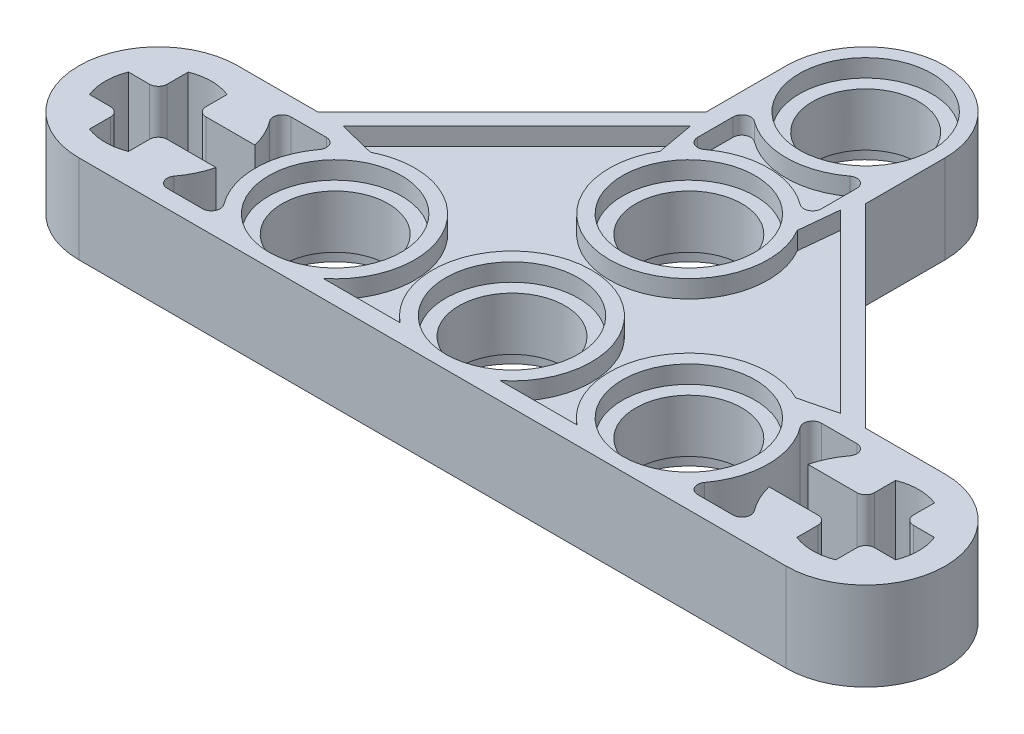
ISO-10303-21;
HEADER;
FILE_DESCRIPTION(('STEP AP214'),'2;1');
FILE_NAME('part.step','',(''),(''),'','','');
FILE_SCHEMA(('AUTOMOTIVE_DESIGN { 1 0 10303 214 1 1 1 1 }'));
ENDSEC;
DATA;
#1=APPLICATION_CONTEXT('core data for automotive mechanical design processes');
#2=APPLICATION_PROTOCOL_DEFINITION('international standard','automotive_design',2000,#1);
#3=PRODUCT_CONTEXT('',#1,'mechanical');
#4=PRODUCT('Part','Part','',(#3));
#5=PRODUCT_RELATED_PRODUCT_CATEGORY('part','',(#4));
#6=PRODUCT_DEFINITION_FORMATION('','',#4);
#7=PRODUCT_DEFINITION_CONTEXT('part definition',#1,'design');
#8=PRODUCT_DEFINITION('design','',#6,#7);
#9=PRODUCT_DEFINITION_SHAPE('','',#8);
#10=(LENGTH_UNIT() NAMED_UNIT(*) SI_UNIT(.MILLI.,.METRE.));
#11=(NAMED_UNIT(*) PLANE_ANGLE_UNIT() SI_UNIT($,.RADIAN.));
#12=(NAMED_UNIT(*) SI_UNIT($,.STERADIAN.) SOLID_ANGLE_UNIT());
#13=UNCERTAINTY_MEASURE_WITH_UNIT(LENGTH_MEASURE(1.E-05),#10,'distance_accuracy_value','');
#14=(GEOMETRIC_REPRESENTATION_CONTEXT(3) GLOBAL_UNCERTAINTY_ASSIGNED_CONTEXT((#13)) GLOBAL_UNIT_ASSIGNED_CONTEXT((#10,
#11,#12)) REPRESENTATION_CONTEXT('',''));
#15=CARTESIAN_POINT('',(0.,0.,0.));
#16=DIRECTION('',(0.,0.,1.));
#17=DIRECTION('',(1.,0.,0.));
#18=AXIS2_PLACEMENT_3D('',#15,#16,#17);
#19=CARTESIAN_POINT('',(0.,-2.,-19.6));
#20=DIRECTION('',(0.,1.,0.));
#21=DIRECTION('',(0.,0.,1.));
#22=AXIS2_PLACEMENT_3D('',#19,#20,#21);
#23=PLANE('',#22);
#24=CARTESIAN_POINT('',(-2.39999999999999,-2.,-14.8));
#25=DIRECTION('',(0.,1.,0.));
#26=DIRECTION('',(0.,0.,-1.));
#27=AXIS2_PLACEMENT_3D('',#24,#25,#26);
#28=CIRCLE('',#27,0.399999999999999);
#29=CARTESIAN_POINT('',(-2.79999999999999,-2.,-14.8));
#30=VERTEX_POINT('',#29);
#31=CARTESIAN_POINT('',(-2.15999999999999,-2.,-14.48));
#32=VERTEX_POINT('',#31);
#33=EDGE_CURVE('E65',#30,#32,#28,.T.);
#34=ORIENTED_EDGE('',*,*,#33,.T.);
#35=CARTESIAN_POINT('',(0.,-2.,-11.6));
#36=DIRECTION('',(0.,-1.,0.));
#37=DIRECTION('',(0.,0.,1.));
#38=AXIS2_PLACEMENT_3D('',#35,#36,#37);
#39=CIRCLE('',#38,3.6);
#40=CARTESIAN_POINT('',(2.16,-2.,-14.48));
#41=VERTEX_POINT('',#40);
#42=EDGE_CURVE('E784',#32,#41,#39,.T.);
#43=ORIENTED_EDGE('',*,*,#42,.T.);
#44=CARTESIAN_POINT('',(2.4,-2.,-14.8));
#45=DIRECTION('',(0.,1.,0.));
#46=DIRECTION('',(0.,0.,1.));
#47=AXIS2_PLACEMENT_3D('',#44,#45,#46);
#48=CIRCLE('',#47,0.400000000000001);
#49=CARTESIAN_POINT('',(2.80000000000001,-2.,-14.8));
#50=VERTEX_POINT('',#49);
#51=EDGE_CURVE('E828',#41,#50,#48,.T.);
#52=ORIENTED_EDGE('',*,*,#51,.T.);
#53=DIRECTION('',(0.,0.,-1.));
#54=VECTOR('',#53,1.);
#55=CARTESIAN_POINT('',(2.80000000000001,-2.,-16.4));
#56=LINE('',#55,#54);
#57=CARTESIAN_POINT('',(2.80000000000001,-2.,-16.4));
#58=VERTEX_POINT('',#57);
#59=EDGE_CURVE('E824',#50,#58,#56,.T.);
#60=ORIENTED_EDGE('',*,*,#59,.T.);
#61=CARTESIAN_POINT('',(2.4,-2.,-16.4));
#62=DIRECTION('',(0.,1.,0.));
#63=DIRECTION('',(0.,0.,-1.));
#64=AXIS2_PLACEMENT_3D('',#61,#62,#63);
#65=CIRCLE('',#64,0.400000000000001);
#66=CARTESIAN_POINT('',(2.16,-2.,-16.72));
#67=VERTEX_POINT('',#66);
#68=EDGE_CURVE('E820',#58,#67,#65,.T.);
#69=ORIENTED_EDGE('',*,*,#68,.T.);
#70=CARTESIAN_POINT('',(0.,-2.,-19.6));
#71=DIRECTION('',(0.,-1.,0.));
#72=DIRECTION('',(0.,0.,1.));
#73=AXIS2_PLACEMENT_3D('',#70,#71,#72);
#74=CIRCLE('',#73,3.6);
#75=CARTESIAN_POINT('',(-2.16,-2.,-16.72));
#76=VERTEX_POINT('',#75);
#77=EDGE_CURVE('E816',#67,#76,#74,.T.);
#78=ORIENTED_EDGE('',*,*,#77,.T.);
#79=CARTESIAN_POINT('',(-2.39999999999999,-2.,-16.4));
#80=DIRECTION('',(0.,1.,0.));
#81=DIRECTION('',(0.,0.,1.));
#82=AXIS2_PLACEMENT_3D('',#79,#80,#81);
#83=CIRCLE('',#82,0.399999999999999);
#84=CARTESIAN_POINT('',(-2.79999999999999,-2.,-16.4));
#85=VERTEX_POINT('',#84);
#86=EDGE_CURVE('E812',#76,#85,#83,.T.);
#87=ORIENTED_EDGE('',*,*,#86,.T.);
#88=DIRECTION('',(0.,0.,1.));
#89=VECTOR('',#88,1.);
#90=CARTESIAN_POINT('',(-2.79999999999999,-2.,-16.4));
#91=LINE('',#90,#89);
#92=EDGE_CURVE('E808',#85,#30,#91,.T.);
#93=ORIENTED_EDGE('',*,*,#92,.T.);
#94=EDGE_LOOP('',(#34,#43,#52,#60,#69,#78,#87,#93));
#95=FACE_BOUND('',#94,.T.);
#96=CARTESIAN_POINT('',(0.,-2.,-19.6));
#97=DIRECTION('',(0.,1.,0.));
#98=DIRECTION('',(0.,0.,1.));
#99=AXIS2_PLACEMENT_3D('',#96,#97,#98);
#100=CIRCLE('',#99,3.);
#101=CARTESIAN_POINT('',(0.,-2.,-16.6));
#102=VERTEX_POINT('',#101);
#103=EDGE_CURVE('E864',#102,#102,#100,.T.);
#104=ORIENTED_EDGE('',*,*,#103,.T.);
#105=EDGE_LOOP('',(#104));
#106=FACE_BOUND('',#105,.T.);
#107=CARTESIAN_POINT('',(8.,-2.,-3.6));
#108=DIRECTION('',(0.,1.,0.));
#109=DIRECTION('',(0.,0.,1.));
#110=AXIS2_PLACEMENT_3D('',#107,#108,#109);
#111=CIRCLE('',#110,3.);
#112=CARTESIAN_POINT('',(8.,-2.,-0.600000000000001));
#113=VERTEX_POINT('',#112);
#114=EDGE_CURVE('E838',#113,#113,#111,.T.);
#115=ORIENTED_EDGE('',*,*,#114,.T.);
#116=EDGE_LOOP('',(#115));
#117=FACE_BOUND('',#116,.T.);
#118=CARTESIAN_POINT('',(-8.,-2.,-3.6));
#119=DIRECTION('',(0.,1.,0.));
#120=DIRECTION('',(0.,0.,1.));
#121=AXIS2_PLACEMENT_3D('',#118,#119,#120);
#122=CIRCLE('',#121,3.);
#123=CARTESIAN_POINT('',(-8.,-2.,-0.6));
#124=VERTEX_POINT('',#123);
#125=EDGE_CURVE('E874',#124,#124,#122,.T.);
#126=ORIENTED_EDGE('',*,*,#125,.T.);
#127=EDGE_LOOP('',(#126));
#128=FACE_BOUND('',#127,.T.);
#129=CARTESIAN_POINT('',(0.,-2.,-3.6));
#130=DIRECTION('',(0.,1.,0.));
#131=DIRECTION('',(0.,0.,1.));
#132=AXIS2_PLACEMENT_3D('',#129,#130,#131);
#133=CIRCLE('',#132,3.);
#134=CARTESIAN_POINT('',(0.,-2.,-0.6));
#135=VERTEX_POINT('',#134);
#136=EDGE_CURVE('E873',#135,#135,#133,.T.);
#137=ORIENTED_EDGE('',*,*,#136,.T.);
#138=EDGE_LOOP('',(#137));
#139=FACE_BOUND('',#138,.T.);
#140=CARTESIAN_POINT('',(0.,-2.,-11.6));
#141=DIRECTION('',(0.,1.,0.));
#142=DIRECTION('',(0.,0.,1.));
#143=AXIS2_PLACEMENT_3D('',#140,#141,#142);
#144=CIRCLE('',#143,3.);
#145=CARTESIAN_POINT('',(0.,-2.,-8.6));
#146=VERTEX_POINT('',#145);
#147=EDGE_CURVE('E888',#146,#146,#144,.T.);
#148=ORIENTED_EDGE('',*,*,#147,.T.);
#149=EDGE_LOOP('',(#148));
#150=FACE_BOUND('',#149,.T.);
#151=DIRECTION('',(0.,0.,-1.));
#152=VECTOR('',#151,1.);
#153=CARTESIAN_POINT('',(-15.12,-2.,-4.87999999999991));
#154=LINE('',#153,#152);
#155=CARTESIAN_POINT('',(-15.12,-2.,-4.87999999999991));
#156=VERTEX_POINT('',#155);
#157=CARTESIAN_POINT('',(-15.12,-2.,-5.83284571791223));
#158=VERTEX_POINT('',#157);
#159=EDGE_CURVE('E1519',#156,#158,#154,.T.);
#160=ORIENTED_EDGE('',*,*,#159,.T.);
#161=CARTESIAN_POINT('',(-16.,-2.,-3.59999999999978));
#162=DIRECTION('',(0.,1.,0.));
#163=DIRECTION('',(0.,0.,1.));
#164=AXIS2_PLACEMENT_3D('',#161,#162,#163);
#165=CIRCLE('',#164,2.4);
#166=CARTESIAN_POINT('',(-16.88,-2.,-5.83284571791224));
#167=VERTEX_POINT('',#166);
#168=EDGE_CURVE('E1426',#158,#167,#165,.T.);
#169=ORIENTED_EDGE('',*,*,#168,.T.);
#170=DIRECTION('',(0.,0.,1.));
#171=VECTOR('',#170,1.);
#172=CARTESIAN_POINT('',(-16.88,-2.,-5.83284571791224));
#173=LINE('',#172,#171);
#174=CARTESIAN_POINT('',(-16.88,-2.,-4.87999999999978));
#175=VERTEX_POINT('',#174);
#176=EDGE_CURVE('E1430',#167,#175,#173,.T.);
#177=ORIENTED_EDGE('',*,*,#176,.T.);
#178=CARTESIAN_POINT('',(-17.28,-2.,-4.87999999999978));
#179=DIRECTION('',(0.,-1.,0.));
#180=DIRECTION('',(0.,0.,-1.));
#181=AXIS2_PLACEMENT_3D('',#178,#179,#180);
#182=CIRCLE('',#181,0.400000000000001);
#183=CARTESIAN_POINT('',(-17.28,-2.,-4.47999999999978));
#184=VERTEX_POINT('',#183);
#185=EDGE_CURVE('E1435',#175,#184,#182,.T.);
#186=ORIENTED_EDGE('',*,*,#185,.T.);
#187=DIRECTION('',(-1.,0.,0.));
#188=VECTOR('',#187,1.);
#189=CARTESIAN_POINT('',(-17.28,-2.,-4.47999999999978));
#190=LINE('',#189,#188);
#191=CARTESIAN_POINT('',(-18.2328457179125,-2.,-4.47999999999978));
#192=VERTEX_POINT('',#191);
#193=EDGE_CURVE('E1439',#184,#192,#190,.T.);
#194=ORIENTED_EDGE('',*,*,#193,.T.);
#195=CARTESIAN_POINT('',(-16.,-2.,-3.59999999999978));
#196=DIRECTION('',(0.,1.,0.));
#197=DIRECTION('',(0.,0.,1.));
#198=AXIS2_PLACEMENT_3D('',#195,#196,#197);
#199=CIRCLE('',#198,2.4);
#200=CARTESIAN_POINT('',(-18.2328457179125,-2.,-2.71999999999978));
#201=VERTEX_POINT('',#200);
#202=EDGE_CURVE('E1443',#192,#201,#199,.T.);
#203=ORIENTED_EDGE('',*,*,#202,.T.);
#204=DIRECTION('',(1.,0.,0.));
#205=VECTOR('',#204,1.);
#206=CARTESIAN_POINT('',(-18.2328457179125,-2.,-2.71999999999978));
#207=LINE('',#206,#205);
#208=CARTESIAN_POINT('',(-17.28,-2.,-2.71999999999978));
#209=VERTEX_POINT('',#208);
#210=EDGE_CURVE('E1447',#201,#209,#207,.T.);
#211=ORIENTED_EDGE('',*,*,#210,.T.);
#212=CARTESIAN_POINT('',(-17.28,-2.,-2.31999999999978));
#213=DIRECTION('',(0.,-1.,0.));
#214=DIRECTION('',(0.,0.,-1.));
#215=AXIS2_PLACEMENT_3D('',#212,#213,#214);
#216=CIRCLE('',#215,0.400000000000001);
#217=CARTESIAN_POINT('',(-16.88,-2.,-2.31999999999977));
#218=VERTEX_POINT('',#217);
#219=EDGE_CURVE('E1451',#209,#218,#216,.T.);
#220=ORIENTED_EDGE('',*,*,#219,.T.);
#221=DIRECTION('',(0.,0.,1.));
#222=VECTOR('',#221,1.);
#223=CARTESIAN_POINT('',(-16.88,-2.,-2.31999999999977));
#224=LINE('',#223,#222);
#225=CARTESIAN_POINT('',(-16.88,-2.,-1.36715428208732));
#226=VERTEX_POINT('',#225);
#227=EDGE_CURVE('E1455',#218,#226,#224,.T.);
#228=ORIENTED_EDGE('',*,*,#227,.T.);
#229=CARTESIAN_POINT('',(-16.,-2.,-3.59999999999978));
#230=DIRECTION('',(0.,1.,0.));
#231=DIRECTION('',(0.,0.,1.));
#232=AXIS2_PLACEMENT_3D('',#229,#230,#231);
#233=CIRCLE('',#232,2.4);
#234=CARTESIAN_POINT('',(-15.12,-2.,-1.36715428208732));
#235=VERTEX_POINT('',#234);
#236=EDGE_CURVE('E1459',#226,#235,#233,.T.);
#237=ORIENTED_EDGE('',*,*,#236,.T.);
#238=DIRECTION('',(0.,0.,-1.));
#239=VECTOR('',#238,1.);
#240=CARTESIAN_POINT('',(-15.12,-2.,-1.36715428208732));
#241=LINE('',#240,#239);
#242=CARTESIAN_POINT('',(-15.12,-2.,-2.31999999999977));
#243=VERTEX_POINT('',#242);
#244=EDGE_CURVE('E1463',#235,#243,#241,.T.);
#245=ORIENTED_EDGE('',*,*,#244,.T.);
#246=CARTESIAN_POINT('',(-14.72,-2.,-2.31999999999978));
#247=DIRECTION('',(0.,-1.,0.));
#248=DIRECTION('',(0.,0.,-1.));
#249=AXIS2_PLACEMENT_3D('',#246,#247,#248);
#250=CIRCLE('',#249,0.4);
#251=CARTESIAN_POINT('',(-14.72,-2.,-2.71999999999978));
#252=VERTEX_POINT('',#251);
#253=EDGE_CURVE('E1467',#243,#252,#250,.T.);
#254=ORIENTED_EDGE('',*,*,#253,.T.);
#255=DIRECTION('',(1.,0.,0.));
#256=VECTOR('',#255,1.);
#257=CARTESIAN_POINT('',(-14.72,-2.,-2.71999999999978));
#258=LINE('',#257,#256);
#259=CARTESIAN_POINT('',(-12.5092121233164,-2.,-2.71999999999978));
#260=VERTEX_POINT('',#259);
#261=EDGE_CURVE('E1471',#252,#260,#258,.T.);
#262=ORIENTED_EDGE('',*,*,#261,.T.);
#263=CARTESIAN_POINT('',(-16.,-2.,-3.59999999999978));
#264=DIRECTION('',(0.,-1.,0.));
#265=DIRECTION('',(0.,0.,1.));
#266=AXIS2_PLACEMENT_3D('',#263,#264,#265);
#267=CIRCLE('',#266,3.60000000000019);
#268=CARTESIAN_POINT('',(-13.1199999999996,-2.,-1.43999999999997));
#269=VERTEX_POINT('',#268);
#270=EDGE_CURVE('E1475',#260,#269,#267,.T.);
#271=ORIENTED_EDGE('',*,*,#270,.T.);
#272=CARTESIAN_POINT('',(-12.7999999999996,-2.,-1.2));
#273=DIRECTION('',(0.,1.,0.));
#274=DIRECTION('',(0.,0.,1.));
#275=AXIS2_PLACEMENT_3D('',#272,#273,#274);
#276=CIRCLE('',#275,0.4);
#277=CARTESIAN_POINT('',(-12.7999999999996,-2.,-0.8));
#278=VERTEX_POINT('',#277);
#279=EDGE_CURVE('E1479',#269,#278,#276,.T.);
#280=ORIENTED_EDGE('',*,*,#279,.T.);
#281=DIRECTION('',(1.,0.,0.));
#282=VECTOR('',#281,1.);
#283=CARTESIAN_POINT('',(-12.7999999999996,-2.,-0.8));
#284=LINE('',#283,#282);
#285=CARTESIAN_POINT('',(-11.2,-2.,-0.8));
#286=VERTEX_POINT('',#285);
#287=EDGE_CURVE('E1483',#278,#286,#284,.T.);
#288=ORIENTED_EDGE('',*,*,#287,.T.);
#289=CARTESIAN_POINT('',(-11.2,-2.,-1.2));
#290=DIRECTION('',(0.,1.,0.));
#291=DIRECTION('',(0.,0.,-1.));
#292=AXIS2_PLACEMENT_3D('',#289,#290,#291);
#293=CIRCLE('',#292,0.399999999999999);
#294=CARTESIAN_POINT('',(-10.88,-2.,-1.44));
#295=VERTEX_POINT('',#294);
#296=EDGE_CURVE('E1487',#286,#295,#293,.T.);
#297=ORIENTED_EDGE('',*,*,#296,.T.);
#298=CARTESIAN_POINT('',(-8.,-2.,-3.6));
#299=DIRECTION('',(0.,-1.,0.));
#300=DIRECTION('',(0.,0.,1.));
#301=AXIS2_PLACEMENT_3D('',#298,#299,#300);
#302=CIRCLE('',#301,3.6);
#303=CARTESIAN_POINT('',(-10.88,-2.,-5.76));
#304=VERTEX_POINT('',#303);
#305=EDGE_CURVE('E1491',#295,#304,#302,.T.);
#306=ORIENTED_EDGE('',*,*,#305,.T.);
#307=CARTESIAN_POINT('',(-11.2,-2.,-6.));
#308=DIRECTION('',(0.,1.,0.));
#309=DIRECTION('',(0.,0.,1.));
#310=AXIS2_PLACEMENT_3D('',#307,#308,#309);
#311=CIRCLE('',#310,0.4);
#312=CARTESIAN_POINT('',(-11.2,-2.,-6.4));
#313=VERTEX_POINT('',#312);
#314=EDGE_CURVE('E1495',#304,#313,#311,.T.);
#315=ORIENTED_EDGE('',*,*,#314,.T.);
#316=DIRECTION('',(-1.,0.,0.));
#317=VECTOR('',#316,1.);
#318=CARTESIAN_POINT('',(-11.2,-2.,-6.4));
#319=LINE('',#318,#317);
#320=CARTESIAN_POINT('',(-12.7999999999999,-2.,-6.4));
#321=VERTEX_POINT('',#320);
#322=EDGE_CURVE('E1499',#313,#321,#319,.T.);
#323=ORIENTED_EDGE('',*,*,#322,.T.);
#324=CARTESIAN_POINT('',(-12.7999999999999,-2.,-6.));
#325=DIRECTION('',(0.,1.,0.));
#326=DIRECTION('',(0.,0.,-1.));
#327=AXIS2_PLACEMENT_3D('',#324,#325,#326);
#328=CIRCLE('',#327,0.4);
#329=CARTESIAN_POINT('',(-13.1199999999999,-2.,-5.75999999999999));
#330=VERTEX_POINT('',#329);
#331=EDGE_CURVE('E1503',#321,#330,#328,.T.);
#332=ORIENTED_EDGE('',*,*,#331,.T.);
#333=CARTESIAN_POINT('',(-16.,-2.,-3.59999999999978));
#334=DIRECTION('',(0.,-1.,0.));
#335=DIRECTION('',(0.,0.,1.));
#336=AXIS2_PLACEMENT_3D('',#333,#334,#335);
#337=CIRCLE('',#336,3.60000000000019);
#338=CARTESIAN_POINT('',(-12.5092121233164,-2.,-4.47999999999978));
#339=VERTEX_POINT('',#338);
#340=EDGE_CURVE('E1507',#330,#339,#337,.T.);
#341=ORIENTED_EDGE('',*,*,#340,.T.);
#342=DIRECTION('',(-1.,0.,-3.50959796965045E-13));
#343=VECTOR('',#342,1.);
#344=CARTESIAN_POINT('',(-13.7671542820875,-2.,-4.48000000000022));
#345=LINE('',#344,#343);
#346=CARTESIAN_POINT('',(-14.7199999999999,-2.,-4.47999999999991));
#347=VERTEX_POINT('',#346);
#348=EDGE_CURVE('E1511',#339,#347,#345,.T.);
#349=ORIENTED_EDGE('',*,*,#348,.T.);
#350=CARTESIAN_POINT('',(-14.72,-2.,-4.87999999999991));
#351=DIRECTION('',(0.,-1.,0.));
#352=DIRECTION('',(0.,0.,-1.));
#353=AXIS2_PLACEMENT_3D('',#350,#351,#352);
#354=CIRCLE('',#353,0.4);
#355=EDGE_CURVE('E1515',#347,#156,#354,.T.);
#356=ORIENTED_EDGE('',*,*,#355,.T.);
#357=EDGE_LOOP('',(#160,#169,#177,#186,#194,#203,#211,#220,#228,#237,#245,#254,#262,#271,#280,
#288,#297,#306,#315,#323,#332,#341,#349,#356));
#358=FACE_BOUND('',#357,.T.);
#359=DIRECTION('',(0.,0.,-1.));
#360=VECTOR('',#359,1.);
#361=CARTESIAN_POINT('',(16.88,-2.,-4.88));
#362=LINE('',#361,#360);
#363=CARTESIAN_POINT('',(16.88,-2.,-4.88));
#364=VERTEX_POINT('',#363);
#365=CARTESIAN_POINT('',(16.88,-2.,-5.83284571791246));
#366=VERTEX_POINT('',#365);
#367=EDGE_CURVE('E1253',#364,#366,#362,.T.);
#368=ORIENTED_EDGE('',*,*,#367,.T.);
#369=CARTESIAN_POINT('',(16.,-2.,-3.6));
#370=DIRECTION('',(0.,1.,0.));
#371=DIRECTION('',(0.,0.,1.));
#372=AXIS2_PLACEMENT_3D('',#369,#370,#371);
#373=CIRCLE('',#372,2.4);
#374=CARTESIAN_POINT('',(15.12,-2.,-5.83284571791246));
#375=VERTEX_POINT('',#374);
#376=EDGE_CURVE('E1160',#366,#375,#373,.T.);
#377=ORIENTED_EDGE('',*,*,#376,.T.);
#378=DIRECTION('',(0.,0.,1.));
#379=VECTOR('',#378,1.);
#380=CARTESIAN_POINT('',(15.12,-2.,-5.83284571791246));
#381=LINE('',#380,#379);
#382=CARTESIAN_POINT('',(15.12,-2.,-4.88));
#383=VERTEX_POINT('',#382);
#384=EDGE_CURVE('E1164',#375,#383,#381,.T.);
#385=ORIENTED_EDGE('',*,*,#384,.T.);
#386=CARTESIAN_POINT('',(14.72,-2.,-4.88));
#387=DIRECTION('',(0.,-1.,0.));
#388=DIRECTION('',(0.,0.,-1.));
#389=AXIS2_PLACEMENT_3D('',#386,#387,#388);
#390=CIRCLE('',#389,0.4);
#391=CARTESIAN_POINT('',(14.72,-2.,-4.48));
#392=VERTEX_POINT('',#391);
#393=EDGE_CURVE('E1169',#383,#392,#390,.T.);
#394=ORIENTED_EDGE('',*,*,#393,.T.);
#395=DIRECTION('',(-1.,0.,0.));
#396=VECTOR('',#395,1.);
#397=CARTESIAN_POINT('',(14.72,-2.,-4.48));
#398=LINE('',#397,#396);
#399=CARTESIAN_POINT('',(12.5092121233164,-2.,-4.47999999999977));
#400=VERTEX_POINT('',#399);
#401=EDGE_CURVE('E1173',#392,#400,#398,.T.);
#402=ORIENTED_EDGE('',*,*,#401,.T.);
#403=CARTESIAN_POINT('',(16.,-2.,-3.6));
#404=DIRECTION('',(0.,-1.,0.));
#405=DIRECTION('',(0.,0.,-1.));
#406=AXIS2_PLACEMENT_3D('',#403,#404,#405);
#407=CIRCLE('',#406,3.6000000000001);
#408=CARTESIAN_POINT('',(13.1199999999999,-2.,-5.75999999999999));
#409=VERTEX_POINT('',#408);
#410=EDGE_CURVE('E1177',#400,#409,#407,.T.);
#411=ORIENTED_EDGE('',*,*,#410,.T.);
#412=CARTESIAN_POINT('',(12.7999999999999,-2.,-6.));
#413=DIRECTION('',(0.,1.,0.));
#414=DIRECTION('',(0.,0.,1.));
#415=AXIS2_PLACEMENT_3D('',#412,#413,#414);
#416=CIRCLE('',#415,0.4);
#417=CARTESIAN_POINT('',(12.7999999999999,-2.,-6.4));
#418=VERTEX_POINT('',#417);
#419=EDGE_CURVE('E1181',#409,#418,#416,.T.);
#420=ORIENTED_EDGE('',*,*,#419,.T.);
#421=DIRECTION('',(-1.,0.,0.));
#422=VECTOR('',#421,1.);
#423=CARTESIAN_POINT('',(11.2,-2.,-6.4));
#424=LINE('',#423,#422);
#425=CARTESIAN_POINT('',(11.2,-2.,-6.4));
#426=VERTEX_POINT('',#425);
#427=EDGE_CURVE('E1185',#418,#426,#424,.T.);
#428=ORIENTED_EDGE('',*,*,#427,.T.);
#429=CARTESIAN_POINT('',(11.2,-2.,-6.));
#430=DIRECTION('',(0.,1.,0.));
#431=DIRECTION('',(0.,0.,-1.));
#432=AXIS2_PLACEMENT_3D('',#429,#430,#431);
#433=CIRCLE('',#432,0.4);
#434=CARTESIAN_POINT('',(10.88,-2.,-5.76));
#435=VERTEX_POINT('',#434);
#436=EDGE_CURVE('E1189',#426,#435,#433,.T.);
#437=ORIENTED_EDGE('',*,*,#436,.T.);
#438=CARTESIAN_POINT('',(8.,-2.,-3.6));
#439=DIRECTION('',(0.,-1.,0.));
#440=DIRECTION('',(0.,0.,-1.));
#441=AXIS2_PLACEMENT_3D('',#438,#439,#440);
#442=CIRCLE('',#441,3.6);
#443=CARTESIAN_POINT('',(10.88,-2.,-1.44));
#444=VERTEX_POINT('',#443);
#445=EDGE_CURVE('E1193',#435,#444,#442,.T.);
#446=ORIENTED_EDGE('',*,*,#445,.T.);
#447=CARTESIAN_POINT('',(11.2,-2.,-1.2));
#448=DIRECTION('',(0.,1.,0.));
#449=DIRECTION('',(0.,0.,1.));
#450=AXIS2_PLACEMENT_3D('',#447,#448,#449);
#451=CIRCLE('',#450,0.399999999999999);
#452=CARTESIAN_POINT('',(11.2,-2.,-0.8));
#453=VERTEX_POINT('',#452);
#454=EDGE_CURVE('E1197',#444,#453,#451,.T.);
#455=ORIENTED_EDGE('',*,*,#454,.T.);
#456=DIRECTION('',(1.,0.,0.));
#457=VECTOR('',#456,1.);
#458=CARTESIAN_POINT('',(12.7999999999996,-2.,-0.8));
#459=LINE('',#458,#457);
#460=CARTESIAN_POINT('',(12.7999999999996,-2.,-0.8));
#461=VERTEX_POINT('',#460);
#462=EDGE_CURVE('E1201',#453,#461,#459,.T.);
#463=ORIENTED_EDGE('',*,*,#462,.T.);
#464=CARTESIAN_POINT('',(12.7999999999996,-2.,-1.2));
#465=DIRECTION('',(0.,1.,0.));
#466=DIRECTION('',(0.,0.,-1.));
#467=AXIS2_PLACEMENT_3D('',#464,#465,#466);
#468=CIRCLE('',#467,0.4);
#469=CARTESIAN_POINT('',(13.1199999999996,-2.,-1.43999999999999));
#470=VERTEX_POINT('',#469);
#471=EDGE_CURVE('E1205',#461,#470,#468,.T.);
#472=ORIENTED_EDGE('',*,*,#471,.T.);
#473=CARTESIAN_POINT('',(16.,-2.,-3.6));
#474=DIRECTION('',(0.,-1.,0.));
#475=DIRECTION('',(0.,0.,-1.));
#476=AXIS2_PLACEMENT_3D('',#473,#474,#475);
#477=CIRCLE('',#476,3.60000000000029);
#478=CARTESIAN_POINT('',(12.5092121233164,-2.,-2.71999999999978));
#479=VERTEX_POINT('',#478);
#480=EDGE_CURVE('E1209',#470,#479,#477,.T.);
#481=ORIENTED_EDGE('',*,*,#480,.T.);
#482=DIRECTION('',(1.,0.,-1.77548423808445E-13));
#483=VECTOR('',#482,1.);
#484=CARTESIAN_POINT('',(13.7671542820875,-2.,-2.72));
#485=LINE('',#484,#483);
#486=CARTESIAN_POINT('',(14.72,-2.,-2.72));
#487=VERTEX_POINT('',#486);
#488=EDGE_CURVE('E1213',#479,#487,#485,.T.);
#489=ORIENTED_EDGE('',*,*,#488,.T.);
#490=CARTESIAN_POINT('',(14.72,-2.,-2.32));
#491=DIRECTION('',(0.,-1.,0.));
#492=DIRECTION('',(0.,0.,1.));
#493=AXIS2_PLACEMENT_3D('',#490,#491,#492);
#494=CIRCLE('',#493,0.4);
#495=CARTESIAN_POINT('',(15.12,-2.,-2.32));
#496=VERTEX_POINT('',#495);
#497=EDGE_CURVE('E1217',#487,#496,#494,.T.);
#498=ORIENTED_EDGE('',*,*,#497,.T.);
#499=DIRECTION('',(0.,0.,1.));
#500=VECTOR('',#499,1.);
#501=CARTESIAN_POINT('',(15.12,-2.,-2.32));
#502=LINE('',#501,#500);
#503=CARTESIAN_POINT('',(15.12,-2.,-1.36715428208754));
#504=VERTEX_POINT('',#503);
#505=EDGE_CURVE('E1221',#496,#504,#502,.T.);
#506=ORIENTED_EDGE('',*,*,#505,.T.);
#507=CARTESIAN_POINT('',(16.,-2.,-3.6));
#508=DIRECTION('',(0.,1.,0.));
#509=DIRECTION('',(0.,0.,1.));
#510=AXIS2_PLACEMENT_3D('',#507,#508,#509);
#511=CIRCLE('',#510,2.4);
#512=CARTESIAN_POINT('',(16.88,-2.,-1.36715428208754));
#513=VERTEX_POINT('',#512);
#514=EDGE_CURVE('E1225',#504,#513,#511,.T.);
#515=ORIENTED_EDGE('',*,*,#514,.T.);
#516=DIRECTION('',(0.,0.,-1.));
#517=VECTOR('',#516,1.);
#518=CARTESIAN_POINT('',(16.88,-2.,-1.36715428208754));
#519=LINE('',#518,#517);
#520=CARTESIAN_POINT('',(16.88,-2.,-2.32));
#521=VERTEX_POINT('',#520);
#522=EDGE_CURVE('E1229',#513,#521,#519,.T.);
#523=ORIENTED_EDGE('',*,*,#522,.T.);
#524=CARTESIAN_POINT('',(17.28,-2.,-2.32));
#525=DIRECTION('',(0.,-1.,0.));
#526=DIRECTION('',(0.,0.,-1.));
#527=AXIS2_PLACEMENT_3D('',#524,#525,#526);
#528=CIRCLE('',#527,0.400000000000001);
#529=CARTESIAN_POINT('',(17.28,-2.,-2.72));
#530=VERTEX_POINT('',#529);
#531=EDGE_CURVE('E1233',#521,#530,#528,.T.);
#532=ORIENTED_EDGE('',*,*,#531,.T.);
#533=DIRECTION('',(1.,0.,0.));
#534=VECTOR('',#533,1.);
#535=CARTESIAN_POINT('',(17.28,-2.,-2.72));
#536=LINE('',#535,#534);
#537=CARTESIAN_POINT('',(18.2328457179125,-2.,-2.72));
#538=VERTEX_POINT('',#537);
#539=EDGE_CURVE('E1237',#530,#538,#536,.T.);
#540=ORIENTED_EDGE('',*,*,#539,.T.);
#541=CARTESIAN_POINT('',(16.,-2.,-3.6));
#542=DIRECTION('',(0.,1.,0.));
#543=DIRECTION('',(0.,0.,1.));
#544=AXIS2_PLACEMENT_3D('',#541,#542,#543);
#545=CIRCLE('',#544,2.4);
#546=CARTESIAN_POINT('',(18.2328457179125,-2.,-4.48));
#547=VERTEX_POINT('',#546);
#548=EDGE_CURVE('E1241',#538,#547,#545,.T.);
#549=ORIENTED_EDGE('',*,*,#548,.T.);
#550=DIRECTION('',(-1.,0.,0.));
#551=VECTOR('',#550,1.);
#552=CARTESIAN_POINT('',(18.2328457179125,-2.,-4.48));
#553=LINE('',#552,#551);
#554=CARTESIAN_POINT('',(17.28,-2.,-4.48));
#555=VERTEX_POINT('',#554);
#556=EDGE_CURVE('E1245',#547,#555,#553,.T.);
#557=ORIENTED_EDGE('',*,*,#556,.T.);
#558=CARTESIAN_POINT('',(17.28,-2.,-4.88));
#559=DIRECTION('',(0.,-1.,0.));
#560=DIRECTION('',(0.,0.,-1.));
#561=AXIS2_PLACEMENT_3D('',#558,#559,#560);
#562=CIRCLE('',#561,0.400000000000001);
#563=EDGE_CURVE('E1249',#555,#364,#562,.T.);
#564=ORIENTED_EDGE('',*,*,#563,.T.);
#565=EDGE_LOOP('',(#368,#377,#385,#394,#402,#411,#420,#428,#437,#446,#455,#463,#472,#481,#489,
#498,#506,#515,#523,#532,#540,#549,#557,#564));
#566=FACE_BOUND('',#565,.T.);
#567=CARTESIAN_POINT('',(0.,-2.,-19.6));
#568=DIRECTION('',(0.,1.,0.));
#569=DIRECTION('',(0.,0.,1.));
#570=AXIS2_PLACEMENT_3D('',#567,#568,#569);
#571=CIRCLE('',#570,3.6);
#572=CARTESIAN_POINT('',(3.6,-2.,-19.6));
#573=VERTEX_POINT('',#572);
#574=CARTESIAN_POINT('',(-3.59999999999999,-2.,-19.6));
#575=VERTEX_POINT('',#574);
#576=EDGE_CURVE('E1729',#573,#575,#571,.T.);
#577=ORIENTED_EDGE('',*,*,#576,.F.);
#578=DIRECTION('',(0.,0.,-1.));
#579=VECTOR('',#578,1.);
#580=CARTESIAN_POINT('',(3.6,-2.,-19.6));
#581=LINE('',#580,#579);
#582=CARTESIAN_POINT('',(3.6,-2.,-16.));
#583=VERTEX_POINT('',#582);
#584=EDGE_CURVE('E1765',#583,#573,#581,.T.);
#585=ORIENTED_EDGE('',*,*,#584,.F.);
#586=DIRECTION('',(-0.707106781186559,0.,-0.707106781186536));
#587=VECTOR('',#586,1.);
#588=CARTESIAN_POINT('',(3.6,-2.,-16.));
#589=LINE('',#588,#587);
#590=CARTESIAN_POINT('',(12.4000000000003,-2.,-7.2));
#591=VERTEX_POINT('',#590);
#592=EDGE_CURVE('E1761',#591,#583,#589,.T.);
#593=ORIENTED_EDGE('',*,*,#592,.F.);
#594=DIRECTION('',(-1.,0.,0.));
#595=VECTOR('',#594,1.);
#596=CARTESIAN_POINT('',(12.4000000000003,-2.,-7.2));
#597=LINE('',#596,#595);
#598=CARTESIAN_POINT('',(16.,-2.,-7.2));
#599=VERTEX_POINT('',#598);
#600=EDGE_CURVE('E1757',#599,#591,#597,.T.);
#601=ORIENTED_EDGE('',*,*,#600,.F.);
#602=CARTESIAN_POINT('',(16.,-2.,-3.6));
#603=DIRECTION('',(0.,1.,0.));
#604=DIRECTION('',(0.,0.,-1.));
#605=AXIS2_PLACEMENT_3D('',#602,#603,#604);
#606=CIRCLE('',#605,3.6);
#607=CARTESIAN_POINT('',(16.,-2.,0.));
#608=VERTEX_POINT('',#607);
#609=EDGE_CURVE('E1753',#608,#599,#606,.T.);
#610=ORIENTED_EDGE('',*,*,#609,.F.);
#611=DIRECTION('',(1.,0.,0.));
#612=VECTOR('',#611,1.);
#613=CARTESIAN_POINT('',(-16.,-2.,0.));
#614=LINE('',#613,#612);
#615=CARTESIAN_POINT('',(-16.,-2.,0.));
#616=VERTEX_POINT('',#615);
#617=EDGE_CURVE('E1749',#616,#608,#614,.T.);
#618=ORIENTED_EDGE('',*,*,#617,.F.);
#619=CARTESIAN_POINT('',(-16.,-2.,-3.6));
#620=DIRECTION('',(0.,1.,0.));
#621=DIRECTION('',(0.,0.,1.));
#622=AXIS2_PLACEMENT_3D('',#619,#620,#621);
#623=CIRCLE('',#622,3.6);
#624=CARTESIAN_POINT('',(-16.,-2.,-7.2));
#625=VERTEX_POINT('',#624);
#626=EDGE_CURVE('E1745',#625,#616,#623,.T.);
#627=ORIENTED_EDGE('',*,*,#626,.F.);
#628=DIRECTION('',(-1.,0.,0.));
#629=VECTOR('',#628,1.);
#630=CARTESIAN_POINT('',(-16.,-2.,-7.2));
#631=LINE('',#630,#629);
#632=CARTESIAN_POINT('',(-12.4,-2.,-7.2));
#633=VERTEX_POINT('',#632);
#634=EDGE_CURVE('E1741',#633,#625,#631,.T.);
#635=ORIENTED_EDGE('',*,*,#634,.F.);
#636=DIRECTION('',(-0.707106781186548,0.,0.707106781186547));
#637=VECTOR('',#636,1.);
#638=CARTESIAN_POINT('',(-12.4,-2.,-7.2));
#639=LINE('',#638,#637);
#640=CARTESIAN_POINT('',(-3.6,-2.,-16.));
#641=VERTEX_POINT('',#640);
#642=EDGE_CURVE('E1737',#641,#633,#639,.T.);
#643=ORIENTED_EDGE('',*,*,#642,.F.);
#644=DIRECTION('',(0.,0.,1.));
#645=VECTOR('',#644,1.);
#646=CARTESIAN_POINT('',(-3.59999999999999,-2.,-19.6));
#647=LINE('',#646,#645);
#648=EDGE_CURVE('E1733',#575,#641,#647,.T.);
#649=ORIENTED_EDGE('',*,*,#648,.F.);
#650=EDGE_LOOP('',(#577,#585,#593,#601,#610,#618,#627,#635,#643,#649));
#651=FACE_BOUND('',#650,.T.);
#652=CARTESIAN_POINT('',(0.,-2.,-3.6));
#653=DIRECTION('',(0.,-1.,0.));
#654=DIRECTION('',(0.,0.,1.));
#655=AXIS2_PLACEMENT_3D('',#652,#653,#654);
#656=CIRCLE('',#655,3.6);
#657=CARTESIAN_POINT('',(-2.26274169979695,-2.,-0.799999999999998));
#658=VERTEX_POINT('',#657);
#659=CARTESIAN_POINT('',(2.26274169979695,-2.,-0.800000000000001));
#660=VERTEX_POINT('',#659);
#661=EDGE_CURVE('E57',#658,#660,#656,.T.);
#662=ORIENTED_EDGE('',*,*,#661,.T.);
#663=DIRECTION('',(1.,0.,0.));
#664=VECTOR('',#663,1.);
#665=CARTESIAN_POINT('',(2.26274169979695,-2.,-0.800000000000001));
#666=LINE('',#665,#664);
#667=CARTESIAN_POINT('',(5.73725830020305,-2.,-0.8));
#668=VERTEX_POINT('',#667);
#669=EDGE_CURVE('E672',#660,#668,#666,.T.);
#670=ORIENTED_EDGE('',*,*,#669,.T.);
#671=CARTESIAN_POINT('',(8.,-2.,-3.6));
#672=DIRECTION('',(0.,-1.,0.));
#673=DIRECTION('',(0.,0.,1.));
#674=AXIS2_PLACEMENT_3D('',#671,#672,#673);
#675=CIRCLE('',#674,3.6);
#676=CARTESIAN_POINT('',(9.62554967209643,-2.,-6.81210028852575));
#677=VERTEX_POINT('',#676);
#678=EDGE_CURVE('E676',#668,#677,#675,.T.);
#679=ORIENTED_EDGE('',*,*,#678,.T.);
#680=DIRECTION('',(0.970461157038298,0.,-0.24125741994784));
#681=VECTOR('',#680,1.);
#682=CARTESIAN_POINT('',(11.2521537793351,-2.,-7.21647537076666));
#683=LINE('',#682,#681);
#684=CARTESIAN_POINT('',(11.2521537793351,-2.,-7.21647537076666));
#685=VERTEX_POINT('',#684);
#686=EDGE_CURVE('E740',#677,#685,#683,.T.);
#687=ORIENTED_EDGE('',*,*,#686,.T.);
#688=DIRECTION('',(-0.707106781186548,0.,-0.707106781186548));
#689=VECTOR('',#688,1.);
#690=CARTESIAN_POINT('',(11.2521537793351,-2.,-7.21647537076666));
#691=LINE('',#690,#689);
#692=CARTESIAN_POINT('',(3.27942892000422,-2.,-15.1892002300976));
#693=VERTEX_POINT('',#692);
#694=EDGE_CURVE('E736',#685,#693,#691,.T.);
#695=ORIENTED_EDGE('',*,*,#694,.T.);
#696=DIRECTION('',(-0.0997596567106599,0.,0.99501156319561));
#697=VECTOR('',#696,1.);
#698=CARTESIAN_POINT('',(3.27942892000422,-2.,-15.1892002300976));
#699=LINE('',#698,#697);
#700=CARTESIAN_POINT('',(3.10080468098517,-2.,-13.4075864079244));
#701=VERTEX_POINT('',#700);
#702=EDGE_CURVE('E732',#693,#701,#699,.T.);
#703=ORIENTED_EDGE('',*,*,#702,.T.);
#704=CARTESIAN_POINT('',(0.,-2.,-11.6));
#705=DIRECTION('',(0.,-1.,0.));
#706=DIRECTION('',(0.,0.,1.));
#707=AXIS2_PLACEMENT_3D('',#704,#705,#706);
#708=CIRCLE('',#707,3.58920023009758);
#709=CARTESIAN_POINT('',(-3.10080468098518,-2.,-13.4075864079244));
#710=VERTEX_POINT('',#709);
#711=EDGE_CURVE('E728',#701,#710,#708,.T.);
#712=ORIENTED_EDGE('',*,*,#711,.T.);
#713=DIRECTION('',(-0.178367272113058,0.,-0.983963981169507));
#714=VECTOR('',#713,1.);
#715=CARTESIAN_POINT('',(-3.40161592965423,-2.,-15.0670132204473));
#716=LINE('',#715,#714);
#717=CARTESIAN_POINT('',(-3.40161592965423,-2.,-15.0670132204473));
#718=VERTEX_POINT('',#717);
#719=EDGE_CURVE('E724',#710,#718,#716,.T.);
#720=ORIENTED_EDGE('',*,*,#719,.T.);
#721=DIRECTION('',(-0.707106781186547,0.,0.707106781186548));
#722=VECTOR('',#721,1.);
#723=CARTESIAN_POINT('',(-11.2521537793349,-2.,-7.21647537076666));
#724=LINE('',#723,#722);
#725=CARTESIAN_POINT('',(-11.2521537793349,-2.,-7.21647537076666));
#726=VERTEX_POINT('',#725);
#727=EDGE_CURVE('E720',#718,#726,#724,.T.);
#728=ORIENTED_EDGE('',*,*,#727,.T.);
#729=DIRECTION('',(0.970461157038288,0.,0.24125741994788));
#730=VECTOR('',#729,1.);
#731=CARTESIAN_POINT('',(-11.2521537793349,-2.,-7.21647537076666));
#732=LINE('',#731,#730);
#733=CARTESIAN_POINT('',(-9.62554967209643,-2.,-6.81210028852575));
#734=VERTEX_POINT('',#733);
#735=EDGE_CURVE('E716',#726,#734,#732,.T.);
#736=ORIENTED_EDGE('',*,*,#735,.T.);
#737=CARTESIAN_POINT('',(-8.,-2.,-3.6));
#738=DIRECTION('',(0.,-1.,0.));
#739=DIRECTION('',(0.,0.,1.));
#740=AXIS2_PLACEMENT_3D('',#737,#738,#739);
#741=CIRCLE('',#740,3.6);
#742=CARTESIAN_POINT('',(-5.73725830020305,-2.,-0.8));
#743=VERTEX_POINT('',#742);
#744=EDGE_CURVE('E712',#734,#743,#741,.T.);
#745=ORIENTED_EDGE('',*,*,#744,.T.);
#746=DIRECTION('',(1.,0.,0.));
#747=VECTOR('',#746,1.);
#748=CARTESIAN_POINT('',(-5.73725830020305,-2.,-0.8));
#749=LINE('',#748,#747);
#750=EDGE_CURVE('E709',#743,#658,#749,.T.);
#751=ORIENTED_EDGE('',*,*,#750,.T.);
#752=EDGE_LOOP('',(#662,#670,#679,#687,#695,#703,#712,#720,#728,#736,#745,#751));
#753=FACE_BOUND('',#752,.T.);
#754=ADVANCED_FACE('F39',(#95,#106,#117,#128,#139,#150,#358,#566,#651,#753),#23,.F.);
#755=CARTESIAN_POINT('',(-8.,-2.,-3.6));
#756=DIRECTION('',(0.,1.,0.));
#757=DIRECTION('',(0.,0.,1.));
#758=AXIS2_PLACEMENT_3D('',#755,#756,#757);
#759=CYLINDRICAL_SURFACE('',#758,2.4);
#760=CARTESIAN_POINT('',(-8.,1.2,-3.6));
#761=DIRECTION('',(0.,1.,0.));
#762=DIRECTION('',(0.,0.,1.));
#763=AXIS2_PLACEMENT_3D('',#760,#761,#762);
#764=CIRCLE('',#763,2.4);
#765=CARTESIAN_POINT('',(-8.,1.2,-1.2));
#766=VERTEX_POINT('',#765);
#767=EDGE_CURVE('E1528',#766,#766,#764,.F.);
#768=ORIENTED_EDGE('',*,*,#767,.F.);
#769=EDGE_LOOP('',(#768));
#770=FACE_BOUND('',#769,.T.);
#771=CARTESIAN_POINT('',(-8.,-1.2,-3.6));
#772=DIRECTION('',(0.,-1.,0.));
#773=DIRECTION('',(0.,0.,-1.));
#774=AXIS2_PLACEMENT_3D('',#771,#772,#773);
#775=CIRCLE('',#774,2.4);
#776=CARTESIAN_POINT('',(-8.,-1.2,-6.));
#777=VERTEX_POINT('',#776);
#778=EDGE_CURVE('E43',#777,#777,#775,.F.);
#779=ORIENTED_EDGE('',*,*,#778,.F.);
#780=EDGE_LOOP('',(#779));
#781=FACE_BOUND('',#780,.T.);
#782=ADVANCED_FACE('F1834',(#770,#781),#759,.F.);
#783=CARTESIAN_POINT('',(8.,-2.,-3.6));
#784=DIRECTION('',(0.,1.,0.));
#785=DIRECTION('',(0.,0.,1.));
#786=AXIS2_PLACEMENT_3D('',#783,#784,#785);
#787=CYLINDRICAL_SURFACE('',#786,2.4);
#788=CARTESIAN_POINT('',(8.,1.2,-3.6));
#789=DIRECTION('',(0.,1.,0.));
#790=DIRECTION('',(0.,0.,1.));
#791=AXIS2_PLACEMENT_3D('',#788,#789,#790);
#792=CIRCLE('',#791,2.4);
#793=CARTESIAN_POINT('',(8.,1.2,-1.2));
#794=VERTEX_POINT('',#793);
#795=EDGE_CURVE('E1806',#794,#794,#792,.F.);
#796=ORIENTED_EDGE('',*,*,#795,.F.);
#797=EDGE_LOOP('',(#796));
#798=FACE_BOUND('',#797,.T.);
#799=CARTESIAN_POINT('',(8.,-1.2,-3.6));
#800=DIRECTION('',(0.,-1.,0.));
#801=DIRECTION('',(0.,0.,-1.));
#802=AXIS2_PLACEMENT_3D('',#799,#800,#801);
#803=CIRCLE('',#802,2.4);
#804=CARTESIAN_POINT('',(8.,-1.2,-6.));
#805=VERTEX_POINT('',#804);
#806=EDGE_CURVE('E1823',#805,#805,#803,.F.);
#807=ORIENTED_EDGE('',*,*,#806,.F.);
#808=EDGE_LOOP('',(#807));
#809=FACE_BOUND('',#808,.T.);
#810=ADVANCED_FACE('F1836',(#798,#809),#787,.F.);
#811=CARTESIAN_POINT('',(0.,-2.,-11.6));
#812=DIRECTION('',(0.,1.,0.));
#813=DIRECTION('',(0.,0.,1.));
#814=AXIS2_PLACEMENT_3D('',#811,#812,#813);
#815=CYLINDRICAL_SURFACE('',#814,2.4);
#816=CARTESIAN_POINT('',(0.,1.2,-11.6));
#817=DIRECTION('',(0.,1.,0.));
#818=DIRECTION('',(0.,0.,1.));
#819=AXIS2_PLACEMENT_3D('',#816,#817,#818);
#820=CIRCLE('',#819,2.4);
#821=CARTESIAN_POINT('',(0.,1.2,-9.2));
#822=VERTEX_POINT('',#821);
#823=EDGE_CURVE('E1802',#822,#822,#820,.F.);
#824=ORIENTED_EDGE('',*,*,#823,.F.);
#825=EDGE_LOOP('',(#824));
#826=FACE_BOUND('',#825,.T.);
#827=CARTESIAN_POINT('',(0.,-1.2,-11.6));
#828=DIRECTION('',(0.,-1.,0.));
#829=DIRECTION('',(0.,0.,-1.));
#830=AXIS2_PLACEMENT_3D('',#827,#828,#829);
#831=CIRCLE('',#830,2.4);
#832=CARTESIAN_POINT('',(0.,-1.2,-14.));
#833=VERTEX_POINT('',#832);
#834=EDGE_CURVE('E1820',#833,#833,#831,.F.);
#835=ORIENTED_EDGE('',*,*,#834,.F.);
#836=EDGE_LOOP('',(#835));
#837=FACE_BOUND('',#836,.T.);
#838=ADVANCED_FACE('F1843',(#826,#837),#815,.F.);
#839=CARTESIAN_POINT('',(0.,-2.,-3.6));
#840=DIRECTION('',(0.,1.,0.));
#841=DIRECTION('',(0.,0.,1.));
#842=AXIS2_PLACEMENT_3D('',#839,#840,#841);
#843=CYLINDRICAL_SURFACE('',#842,2.4);
#844=CARTESIAN_POINT('',(0.,1.2,-3.6));
#845=DIRECTION('',(0.,1.,0.));
#846=DIRECTION('',(0.,0.,1.));
#847=AXIS2_PLACEMENT_3D('',#844,#845,#846);
#848=CIRCLE('',#847,2.4);
#849=CARTESIAN_POINT('',(0.,1.2,-1.2));
#850=VERTEX_POINT('',#849);
#851=EDGE_CURVE('E1798',#850,#850,#848,.F.);
#852=ORIENTED_EDGE('',*,*,#851,.F.);
#853=EDGE_LOOP('',(#852));
#854=FACE_BOUND('',#853,.T.);
#855=CARTESIAN_POINT('',(0.,-1.2,-3.6));
#856=DIRECTION('',(0.,-1.,0.));
#857=DIRECTION('',(0.,0.,-1.));
#858=AXIS2_PLACEMENT_3D('',#855,#856,#857);
#859=CIRCLE('',#858,2.4);
#860=CARTESIAN_POINT('',(0.,-1.2,-6.));
#861=VERTEX_POINT('',#860);
#862=EDGE_CURVE('E1816',#861,#861,#859,.F.);
#863=ORIENTED_EDGE('',*,*,#862,.F.);
#864=EDGE_LOOP('',(#863));
#865=FACE_BOUND('',#864,.T.);
#866=ADVANCED_FACE('F1851',(#854,#865),#843,.F.);
#867=CARTESIAN_POINT('',(0.,-2.,-19.6));
#868=DIRECTION('',(0.,1.,0.));
#869=DIRECTION('',(0.,0.,1.));
#870=AXIS2_PLACEMENT_3D('',#867,#868,#869);
#871=CYLINDRICAL_SURFACE('',#870,2.4);
#872=CARTESIAN_POINT('',(0.,1.2,-19.6));
#873=DIRECTION('',(0.,1.,0.));
#874=DIRECTION('',(0.,0.,1.));
#875=AXIS2_PLACEMENT_3D('',#872,#873,#874);
#876=CIRCLE('',#875,2.4);
#877=CARTESIAN_POINT('',(0.,1.2,-17.2));
#878=VERTEX_POINT('',#877);
#879=EDGE_CURVE('E1124',#878,#878,#876,.F.);
#880=ORIENTED_EDGE('',*,*,#879,.F.);
#881=EDGE_LOOP('',(#880));
#882=FACE_BOUND('',#881,.T.);
#883=CARTESIAN_POINT('',(0.,-1.2,-19.6));
#884=DIRECTION('',(0.,-1.,0.));
#885=DIRECTION('',(0.,0.,-1.));
#886=AXIS2_PLACEMENT_3D('',#883,#884,#885);
#887=CIRCLE('',#886,2.4);
#888=CARTESIAN_POINT('',(0.,-1.2,-22.));
#889=VERTEX_POINT('',#888);
#890=EDGE_CURVE('E863',#889,#889,#887,.F.);
#891=ORIENTED_EDGE('',*,*,#890,.F.);
#892=EDGE_LOOP('',(#891));
#893=FACE_BOUND('',#892,.T.);
#894=ADVANCED_FACE('F1854',(#882,#893),#871,.F.);
#895=CARTESIAN_POINT('',(0.,2.,-19.6));
#896=DIRECTION('',(0.,1.,0.));
#897=DIRECTION('',(0.,0.,1.));
#898=AXIS2_PLACEMENT_3D('',#895,#896,#897);
#899=PLANE('',#898);
#900=CARTESIAN_POINT('',(-2.39999999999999,2.,-14.8));
#901=DIRECTION('',(0.,1.,0.));
#902=DIRECTION('',(0.,0.,-1.));
#903=AXIS2_PLACEMENT_3D('',#900,#901,#902);
#904=CIRCLE('',#903,0.399999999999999);
#905=CARTESIAN_POINT('',(-2.79999999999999,2.,-14.8));
#906=VERTEX_POINT('',#905);
#907=CARTESIAN_POINT('',(-2.15999999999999,2.,-14.48));
#908=VERTEX_POINT('',#907);
#909=EDGE_CURVE('E998',#906,#908,#904,.T.);
#910=ORIENTED_EDGE('',*,*,#909,.F.);
#911=DIRECTION('',(0.,0.,1.));
#912=VECTOR('',#911,1.);
#913=CARTESIAN_POINT('',(-2.79999999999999,2.,-16.4));
#914=LINE('',#913,#912);
#915=CARTESIAN_POINT('',(-2.79999999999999,2.,-16.4));
#916=VERTEX_POINT('',#915);
#917=EDGE_CURVE('E1037',#916,#906,#914,.T.);
#918=ORIENTED_EDGE('',*,*,#917,.F.);
#919=CARTESIAN_POINT('',(-2.39999999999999,2.,-16.4));
#920=DIRECTION('',(0.,1.,0.));
#921=DIRECTION('',(0.,0.,1.));
#922=AXIS2_PLACEMENT_3D('',#919,#920,#921);
#923=CIRCLE('',#922,0.399999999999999);
#924=CARTESIAN_POINT('',(-2.16,2.,-16.72));
#925=VERTEX_POINT('',#924);
#926=EDGE_CURVE('E1088',#925,#916,#923,.T.);
#927=ORIENTED_EDGE('',*,*,#926,.F.);
#928=CARTESIAN_POINT('',(0.,2.,-19.6));
#929=DIRECTION('',(0.,-1.,0.));
#930=DIRECTION('',(0.,0.,1.));
#931=AXIS2_PLACEMENT_3D('',#928,#929,#930);
#932=CIRCLE('',#931,3.6);
#933=CARTESIAN_POINT('',(2.16,2.,-16.72));
#934=VERTEX_POINT('',#933);
#935=EDGE_CURVE('E1084',#934,#925,#932,.T.);
#936=ORIENTED_EDGE('',*,*,#935,.F.);
#937=CARTESIAN_POINT('',(2.4,2.,-16.4));
#938=DIRECTION('',(0.,1.,0.));
#939=DIRECTION('',(0.,0.,-1.));
#940=AXIS2_PLACEMENT_3D('',#937,#938,#939);
#941=CIRCLE('',#940,0.400000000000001);
#942=CARTESIAN_POINT('',(2.80000000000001,2.,-16.4));
#943=VERTEX_POINT('',#942);
#944=EDGE_CURVE('E1080',#943,#934,#941,.T.);
#945=ORIENTED_EDGE('',*,*,#944,.F.);
#946=DIRECTION('',(0.,0.,-1.));
#947=VECTOR('',#946,1.);
#948=CARTESIAN_POINT('',(2.80000000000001,2.,-16.4));
#949=LINE('',#948,#947);
#950=CARTESIAN_POINT('',(2.80000000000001,2.,-14.8));
#951=VERTEX_POINT('',#950);
#952=EDGE_CURVE('E1076',#951,#943,#949,.T.);
#953=ORIENTED_EDGE('',*,*,#952,.F.);
#954=CARTESIAN_POINT('',(2.4,2.,-14.8));
#955=DIRECTION('',(0.,1.,0.));
#956=DIRECTION('',(0.,0.,1.));
#957=AXIS2_PLACEMENT_3D('',#954,#955,#956);
#958=CIRCLE('',#957,0.400000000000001);
#959=CARTESIAN_POINT('',(2.16,2.,-14.48));
#960=VERTEX_POINT('',#959);
#961=EDGE_CURVE('E1072',#960,#951,#958,.T.);
#962=ORIENTED_EDGE('',*,*,#961,.F.);
#963=CARTESIAN_POINT('',(0.,2.,-11.6));
#964=DIRECTION('',(0.,-1.,0.));
#965=DIRECTION('',(0.,0.,1.));
#966=AXIS2_PLACEMENT_3D('',#963,#964,#965);
#967=CIRCLE('',#966,3.6);
#968=EDGE_CURVE('E1068',#908,#960,#967,.T.);
#969=ORIENTED_EDGE('',*,*,#968,.F.);
#970=EDGE_LOOP('',(#910,#918,#927,#936,#945,#953,#962,#969));
#971=FACE_BOUND('',#970,.T.);
#972=CARTESIAN_POINT('',(0.,2.,-19.6));
#973=DIRECTION('',(0.,1.,0.));
#974=DIRECTION('',(0.,0.,1.));
#975=AXIS2_PLACEMENT_3D('',#972,#973,#974);
#976=CIRCLE('',#975,3.);
#977=CARTESIAN_POINT('',(0.,2.,-16.6));
#978=VERTEX_POINT('',#977);
#979=EDGE_CURVE('E1125',#978,#978,#976,.T.);
#980=ORIENTED_EDGE('',*,*,#979,.F.);
#981=EDGE_LOOP('',(#980));
#982=FACE_BOUND('',#981,.T.);
#983=CARTESIAN_POINT('',(8.,2.,-3.6));
#984=DIRECTION('',(0.,1.,0.));
#985=DIRECTION('',(0.,0.,1.));
#986=AXIS2_PLACEMENT_3D('',#983,#984,#985);
#987=CIRCLE('',#986,3.);
#988=CARTESIAN_POINT('',(8.,2.,-0.600000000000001));
#989=VERTEX_POINT('',#988);
#990=EDGE_CURVE('E1098',#989,#989,#987,.T.);
#991=ORIENTED_EDGE('',*,*,#990,.F.);
#992=EDGE_LOOP('',(#991));
#993=FACE_BOUND('',#992,.T.);
#994=CARTESIAN_POINT('',(-8.,2.,-3.6));
#995=DIRECTION('',(0.,1.,0.));
#996=DIRECTION('',(0.,0.,1.));
#997=AXIS2_PLACEMENT_3D('',#994,#995,#996);
#998=CIRCLE('',#997,3.);
#999=CARTESIAN_POINT('',(-8.,2.,-0.6));
#1000=VERTEX_POINT('',#999);
#1001=EDGE_CURVE('E1135',#1000,#1000,#998,.T.);
#1002=ORIENTED_EDGE('',*,*,#1001,.F.);
#1003=EDGE_LOOP('',(#1002));
#1004=FACE_BOUND('',#1003,.T.);
#1005=CARTESIAN_POINT('',(0.,2.,-3.6));
#1006=DIRECTION('',(0.,1.,0.));
#1007=DIRECTION('',(0.,0.,1.));
#1008=AXIS2_PLACEMENT_3D('',#1005,#1006,#1007);
#1009=CIRCLE('',#1008,3.);
#1010=CARTESIAN_POINT('',(0.,2.,-0.6));
#1011=VERTEX_POINT('',#1010);
#1012=EDGE_CURVE('E1134',#1011,#1011,#1009,.T.);
#1013=ORIENTED_EDGE('',*,*,#1012,.F.);
#1014=EDGE_LOOP('',(#1013));
#1015=FACE_BOUND('',#1014,.T.);
#1016=CARTESIAN_POINT('',(0.,2.,-11.6));
#1017=DIRECTION('',(0.,1.,0.));
#1018=DIRECTION('',(0.,0.,1.));
#1019=AXIS2_PLACEMENT_3D('',#1016,#1017,#1018);
#1020=CIRCLE('',#1019,3.);
#1021=CARTESIAN_POINT('',(0.,2.,-8.6));
#1022=VERTEX_POINT('',#1021);
#1023=EDGE_CURVE('E1149',#1022,#1022,#1020,.T.);
#1024=ORIENTED_EDGE('',*,*,#1023,.F.);
#1025=EDGE_LOOP('',(#1024));
#1026=FACE_BOUND('',#1025,.T.);
#1027=CARTESIAN_POINT('',(-16.,2.,-3.59999999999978));
#1028=DIRECTION('',(0.,1.,0.));
#1029=DIRECTION('',(0.,0.,1.));
#1030=AXIS2_PLACEMENT_3D('',#1027,#1028,#1029);
#1031=CIRCLE('',#1030,2.4);
#1032=CARTESIAN_POINT('',(-15.12,2.,-5.83284571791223));
#1033=VERTEX_POINT('',#1032);
#1034=CARTESIAN_POINT('',(-16.88,2.,-5.83284571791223));
#1035=VERTEX_POINT('',#1034);
#1036=EDGE_CURVE('E1524',#1033,#1035,#1031,.T.);
#1037=ORIENTED_EDGE('',*,*,#1036,.F.);
#1038=DIRECTION('',(0.,0.,-1.));
#1039=VECTOR('',#1038,1.);
#1040=CARTESIAN_POINT('',(-15.12,2.,-4.87999999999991));
#1041=LINE('',#1040,#1039);
#1042=CARTESIAN_POINT('',(-15.12,2.,-4.87999999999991));
#1043=VERTEX_POINT('',#1042);
#1044=EDGE_CURVE('E1431',#1043,#1033,#1041,.T.);
#1045=ORIENTED_EDGE('',*,*,#1044,.F.);
#1046=CARTESIAN_POINT('',(-14.72,2.,-4.87999999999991));
#1047=DIRECTION('',(0.,-1.,0.));
#1048=DIRECTION('',(0.,0.,-1.));
#1049=AXIS2_PLACEMENT_3D('',#1046,#1047,#1048);
#1050=CIRCLE('',#1049,0.4);
#1051=CARTESIAN_POINT('',(-14.7199999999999,2.,-4.47999999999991));
#1052=VERTEX_POINT('',#1051);
#1053=EDGE_CURVE('E1612',#1052,#1043,#1050,.T.);
#1054=ORIENTED_EDGE('',*,*,#1053,.F.);
#1055=DIRECTION('',(-1.,0.,3.26792531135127E-13));
#1056=VECTOR('',#1055,1.);
#1057=CARTESIAN_POINT('',(-13.7671542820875,2.,-4.48000000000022));
#1058=LINE('',#1057,#1056);
#1059=CARTESIAN_POINT('',(-12.5092121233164,2.,-4.47999999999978));
#1060=VERTEX_POINT('',#1059);
#1061=EDGE_CURVE('E1608',#1060,#1052,#1058,.T.);
#1062=ORIENTED_EDGE('',*,*,#1061,.F.);
#1063=CARTESIAN_POINT('',(-16.,2.,-3.59999999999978));
#1064=DIRECTION('',(0.,-1.,0.));
#1065=DIRECTION('',(0.,0.,1.));
#1066=AXIS2_PLACEMENT_3D('',#1063,#1064,#1065);
#1067=CIRCLE('',#1066,3.60000000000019);
#1068=CARTESIAN_POINT('',(-13.1199999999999,2.,-5.75999999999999));
#1069=VERTEX_POINT('',#1068);
#1070=EDGE_CURVE('E1604',#1069,#1060,#1067,.T.);
#1071=ORIENTED_EDGE('',*,*,#1070,.F.);
#1072=CARTESIAN_POINT('',(-12.7999999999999,2.,-6.));
#1073=DIRECTION('',(0.,1.,0.));
#1074=DIRECTION('',(0.,0.,-1.));
#1075=AXIS2_PLACEMENT_3D('',#1072,#1073,#1074);
#1076=CIRCLE('',#1075,0.4);
#1077=CARTESIAN_POINT('',(-12.7999999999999,2.,-6.4));
#1078=VERTEX_POINT('',#1077);
#1079=EDGE_CURVE('E1600',#1078,#1069,#1076,.T.);
#1080=ORIENTED_EDGE('',*,*,#1079,.F.);
#1081=DIRECTION('',(-1.,0.,0.));
#1082=VECTOR('',#1081,1.);
#1083=CARTESIAN_POINT('',(-11.2,2.,-6.4));
#1084=LINE('',#1083,#1082);
#1085=CARTESIAN_POINT('',(-11.2,2.,-6.4));
#1086=VERTEX_POINT('',#1085);
#1087=EDGE_CURVE('E1596',#1086,#1078,#1084,.T.);
#1088=ORIENTED_EDGE('',*,*,#1087,.F.);
#1089=CARTESIAN_POINT('',(-11.2,2.,-6.));
#1090=DIRECTION('',(0.,1.,0.));
#1091=DIRECTION('',(0.,0.,1.));
#1092=AXIS2_PLACEMENT_3D('',#1089,#1090,#1091);
#1093=CIRCLE('',#1092,0.4);
#1094=CARTESIAN_POINT('',(-10.88,2.,-5.76));
#1095=VERTEX_POINT('',#1094);
#1096=EDGE_CURVE('E1592',#1095,#1086,#1093,.T.);
#1097=ORIENTED_EDGE('',*,*,#1096,.F.);
#1098=CARTESIAN_POINT('',(-8.,2.,-3.6));
#1099=DIRECTION('',(0.,-1.,0.));
#1100=DIRECTION('',(0.,0.,1.));
#1101=AXIS2_PLACEMENT_3D('',#1098,#1099,#1100);
#1102=CIRCLE('',#1101,3.6);
#1103=CARTESIAN_POINT('',(-10.88,2.,-1.44));
#1104=VERTEX_POINT('',#1103);
#1105=EDGE_CURVE('E1588',#1104,#1095,#1102,.T.);
#1106=ORIENTED_EDGE('',*,*,#1105,.F.);
#1107=CARTESIAN_POINT('',(-11.2,2.,-1.2));
#1108=DIRECTION('',(0.,1.,0.));
#1109=DIRECTION('',(0.,0.,-1.));
#1110=AXIS2_PLACEMENT_3D('',#1107,#1108,#1109);
#1111=CIRCLE('',#1110,0.399999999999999);
#1112=CARTESIAN_POINT('',(-11.2,2.,-0.8));
#1113=VERTEX_POINT('',#1112);
#1114=EDGE_CURVE('E1584',#1113,#1104,#1111,.T.);
#1115=ORIENTED_EDGE('',*,*,#1114,.F.);
#1116=DIRECTION('',(1.,0.,0.));
#1117=VECTOR('',#1116,1.);
#1118=CARTESIAN_POINT('',(-12.7999999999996,2.,-0.8));
#1119=LINE('',#1118,#1117);
#1120=CARTESIAN_POINT('',(-12.7999999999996,2.,-0.8));
#1121=VERTEX_POINT('',#1120);
#1122=EDGE_CURVE('E1580',#1121,#1113,#1119,.T.);
#1123=ORIENTED_EDGE('',*,*,#1122,.F.);
#1124=CARTESIAN_POINT('',(-12.7999999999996,2.,-1.2));
#1125=DIRECTION('',(0.,1.,0.));
#1126=DIRECTION('',(0.,0.,1.));
#1127=AXIS2_PLACEMENT_3D('',#1124,#1125,#1126);
#1128=CIRCLE('',#1127,0.4);
#1129=CARTESIAN_POINT('',(-13.1199999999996,2.,-1.43999999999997));
#1130=VERTEX_POINT('',#1129);
#1131=EDGE_CURVE('E1576',#1130,#1121,#1128,.T.);
#1132=ORIENTED_EDGE('',*,*,#1131,.F.);
#1133=CARTESIAN_POINT('',(-16.,2.,-3.59999999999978));
#1134=DIRECTION('',(0.,-1.,0.));
#1135=DIRECTION('',(0.,0.,1.));
#1136=AXIS2_PLACEMENT_3D('',#1133,#1134,#1135);
#1137=CIRCLE('',#1136,3.60000000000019);
#1138=CARTESIAN_POINT('',(-12.5092121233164,2.,-2.71999999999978));
#1139=VERTEX_POINT('',#1138);
#1140=EDGE_CURVE('E1572',#1139,#1130,#1137,.T.);
#1141=ORIENTED_EDGE('',*,*,#1140,.F.);
#1142=DIRECTION('',(1.,0.,0.));
#1143=VECTOR('',#1142,1.);
#1144=CARTESIAN_POINT('',(-13.7671542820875,2.,-2.71999999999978));
#1145=LINE('',#1144,#1143);
#1146=CARTESIAN_POINT('',(-14.72,2.,-2.71999999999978));
#1147=VERTEX_POINT('',#1146);
#1148=EDGE_CURVE('E1568',#1147,#1139,#1145,.T.);
#1149=ORIENTED_EDGE('',*,*,#1148,.F.);
#1150=CARTESIAN_POINT('',(-14.72,2.,-2.31999999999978));
#1151=DIRECTION('',(0.,-1.,0.));
#1152=DIRECTION('',(0.,0.,-1.));
#1153=AXIS2_PLACEMENT_3D('',#1150,#1151,#1152);
#1154=CIRCLE('',#1153,0.4);
#1155=CARTESIAN_POINT('',(-15.12,2.,-2.31999999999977));
#1156=VERTEX_POINT('',#1155);
#1157=EDGE_CURVE('E1564',#1156,#1147,#1154,.T.);
#1158=ORIENTED_EDGE('',*,*,#1157,.F.);
#1159=DIRECTION('',(0.,0.,-1.));
#1160=VECTOR('',#1159,1.);
#1161=CARTESIAN_POINT('',(-15.12,2.,-1.36715428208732));
#1162=LINE('',#1161,#1160);
#1163=CARTESIAN_POINT('',(-15.12,2.,-1.36715428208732));
#1164=VERTEX_POINT('',#1163);
#1165=EDGE_CURVE('E1560',#1164,#1156,#1162,.T.);
#1166=ORIENTED_EDGE('',*,*,#1165,.F.);
#1167=CARTESIAN_POINT('',(-16.,2.,-3.59999999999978));
#1168=DIRECTION('',(0.,1.,0.));
#1169=DIRECTION('',(0.,0.,1.));
#1170=AXIS2_PLACEMENT_3D('',#1167,#1168,#1169);
#1171=CIRCLE('',#1170,2.4);
#1172=CARTESIAN_POINT('',(-16.88,2.,-1.36715428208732));
#1173=VERTEX_POINT('',#1172);
#1174=EDGE_CURVE('E1556',#1173,#1164,#1171,.T.);
#1175=ORIENTED_EDGE('',*,*,#1174,.F.);
#1176=DIRECTION('',(0.,0.,1.));
#1177=VECTOR('',#1176,1.);
#1178=CARTESIAN_POINT('',(-16.88,2.,-2.31999999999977));
#1179=LINE('',#1178,#1177);
#1180=CARTESIAN_POINT('',(-16.88,2.,-2.31999999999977));
#1181=VERTEX_POINT('',#1180);
#1182=EDGE_CURVE('E1552',#1181,#1173,#1179,.T.);
#1183=ORIENTED_EDGE('',*,*,#1182,.F.);
#1184=CARTESIAN_POINT('',(-17.28,2.,-2.31999999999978));
#1185=DIRECTION('',(0.,-1.,0.));
#1186=DIRECTION('',(0.,0.,-1.));
#1187=AXIS2_PLACEMENT_3D('',#1184,#1185,#1186);
#1188=CIRCLE('',#1187,0.400000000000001);
#1189=CARTESIAN_POINT('',(-17.28,2.,-2.71999999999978));
#1190=VERTEX_POINT('',#1189);
#1191=EDGE_CURVE('E1548',#1190,#1181,#1188,.T.);
#1192=ORIENTED_EDGE('',*,*,#1191,.F.);
#1193=DIRECTION('',(1.,0.,0.));
#1194=VECTOR('',#1193,1.);
#1195=CARTESIAN_POINT('',(-18.2328457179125,2.,-2.71999999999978));
#1196=LINE('',#1195,#1194);
#1197=CARTESIAN_POINT('',(-18.2328457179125,2.,-2.71999999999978));
#1198=VERTEX_POINT('',#1197);
#1199=EDGE_CURVE('E1544',#1198,#1190,#1196,.T.);
#1200=ORIENTED_EDGE('',*,*,#1199,.F.);
#1201=CARTESIAN_POINT('',(-16.,2.,-3.59999999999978));
#1202=DIRECTION('',(0.,1.,0.));
#1203=DIRECTION('',(0.,0.,1.));
#1204=AXIS2_PLACEMENT_3D('',#1201,#1202,#1203);
#1205=CIRCLE('',#1204,2.4);
#1206=CARTESIAN_POINT('',(-18.2328457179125,2.,-4.47999999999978));
#1207=VERTEX_POINT('',#1206);
#1208=EDGE_CURVE('E1540',#1207,#1198,#1205,.T.);
#1209=ORIENTED_EDGE('',*,*,#1208,.F.);
#1210=DIRECTION('',(-1.,0.,0.));
#1211=VECTOR('',#1210,1.);
#1212=CARTESIAN_POINT('',(-17.28,2.,-4.47999999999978));
#1213=LINE('',#1212,#1211);
#1214=CARTESIAN_POINT('',(-17.28,2.,-4.47999999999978));
#1215=VERTEX_POINT('',#1214);
#1216=EDGE_CURVE('E1536',#1215,#1207,#1213,.T.);
#1217=ORIENTED_EDGE('',*,*,#1216,.F.);
#1218=CARTESIAN_POINT('',(-17.28,2.,-4.87999999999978));
#1219=DIRECTION('',(0.,-1.,0.));
#1220=DIRECTION('',(0.,0.,-1.));
#1221=AXIS2_PLACEMENT_3D('',#1218,#1219,#1220);
#1222=CIRCLE('',#1221,0.400000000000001);
#1223=CARTESIAN_POINT('',(-16.88,2.,-4.87999999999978));
#1224=VERTEX_POINT('',#1223);
#1225=EDGE_CURVE('E1532',#1224,#1215,#1222,.T.);
#1226=ORIENTED_EDGE('',*,*,#1225,.F.);
#1227=DIRECTION('',(0.,0.,1.));
#1228=VECTOR('',#1227,1.);
#1229=CARTESIAN_POINT('',(-16.88,2.,-5.83284571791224));
#1230=LINE('',#1229,#1228);
#1231=EDGE_CURVE('E1527',#1035,#1224,#1230,.T.);
#1232=ORIENTED_EDGE('',*,*,#1231,.F.);
#1233=EDGE_LOOP('',(#1037,#1045,#1054,#1062,#1071,#1080,#1088,#1097,#1106,#1115,#1123,#1132,
#1141,#1149,#1158,#1166,#1175,#1183,#1192,#1200,#1209,#1217,#1226,#1232));
#1234=FACE_BOUND('',#1233,.T.);
#1235=CARTESIAN_POINT('',(16.,2.,-3.6));
#1236=DIRECTION('',(0.,1.,0.));
#1237=DIRECTION('',(0.,0.,1.));
#1238=AXIS2_PLACEMENT_3D('',#1235,#1236,#1237);
#1239=CIRCLE('',#1238,2.4);
#1240=CARTESIAN_POINT('',(16.88,2.,-5.83284571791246));
#1241=VERTEX_POINT('',#1240);
#1242=CARTESIAN_POINT('',(15.12,2.,-5.83284571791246));
#1243=VERTEX_POINT('',#1242);
#1244=EDGE_CURVE('E1258',#1241,#1243,#1239,.T.);
#1245=ORIENTED_EDGE('',*,*,#1244,.F.);
#1246=DIRECTION('',(0.,0.,-1.));
#1247=VECTOR('',#1246,1.);
#1248=CARTESIAN_POINT('',(16.88,2.,-4.88));
#1249=LINE('',#1248,#1247);
#1250=CARTESIAN_POINT('',(16.88,2.,-4.88));
#1251=VERTEX_POINT('',#1250);
#1252=EDGE_CURVE('E1165',#1251,#1241,#1249,.T.);
#1253=ORIENTED_EDGE('',*,*,#1252,.F.);
#1254=CARTESIAN_POINT('',(17.28,2.,-4.88));
#1255=DIRECTION('',(0.,-1.,0.));
#1256=DIRECTION('',(0.,0.,-1.));
#1257=AXIS2_PLACEMENT_3D('',#1254,#1255,#1256);
#1258=CIRCLE('',#1257,0.400000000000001);
#1259=CARTESIAN_POINT('',(17.28,2.,-4.48));
#1260=VERTEX_POINT('',#1259);
#1261=EDGE_CURVE('E1346',#1260,#1251,#1258,.T.);
#1262=ORIENTED_EDGE('',*,*,#1261,.F.);
#1263=DIRECTION('',(-1.,0.,0.));
#1264=VECTOR('',#1263,1.);
#1265=CARTESIAN_POINT('',(18.2328457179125,2.,-4.48));
#1266=LINE('',#1265,#1264);
#1267=CARTESIAN_POINT('',(18.2328457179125,2.,-4.48));
#1268=VERTEX_POINT('',#1267);
#1269=EDGE_CURVE('E1342',#1268,#1260,#1266,.T.);
#1270=ORIENTED_EDGE('',*,*,#1269,.F.);
#1271=CARTESIAN_POINT('',(16.,2.,-3.6));
#1272=DIRECTION('',(0.,1.,0.));
#1273=DIRECTION('',(0.,0.,1.));
#1274=AXIS2_PLACEMENT_3D('',#1271,#1272,#1273);
#1275=CIRCLE('',#1274,2.4);
#1276=CARTESIAN_POINT('',(18.2328457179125,2.,-2.72));
#1277=VERTEX_POINT('',#1276);
#1278=EDGE_CURVE('E1338',#1277,#1268,#1275,.T.);
#1279=ORIENTED_EDGE('',*,*,#1278,.F.);
#1280=DIRECTION('',(1.,0.,0.));
#1281=VECTOR('',#1280,1.);
#1282=CARTESIAN_POINT('',(17.28,2.,-2.72));
#1283=LINE('',#1282,#1281);
#1284=CARTESIAN_POINT('',(17.28,2.,-2.72));
#1285=VERTEX_POINT('',#1284);
#1286=EDGE_CURVE('E1334',#1285,#1277,#1283,.T.);
#1287=ORIENTED_EDGE('',*,*,#1286,.F.);
#1288=CARTESIAN_POINT('',(17.28,2.,-2.32));
#1289=DIRECTION('',(0.,-1.,0.));
#1290=DIRECTION('',(0.,0.,-1.));
#1291=AXIS2_PLACEMENT_3D('',#1288,#1289,#1290);
#1292=CIRCLE('',#1291,0.400000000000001);
#1293=CARTESIAN_POINT('',(16.88,2.,-2.32));
#1294=VERTEX_POINT('',#1293);
#1295=EDGE_CURVE('E1330',#1294,#1285,#1292,.T.);
#1296=ORIENTED_EDGE('',*,*,#1295,.F.);
#1297=DIRECTION('',(0.,0.,-1.));
#1298=VECTOR('',#1297,1.);
#1299=CARTESIAN_POINT('',(16.88,2.,-1.36715428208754));
#1300=LINE('',#1299,#1298);
#1301=CARTESIAN_POINT('',(16.88,2.,-1.36715428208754));
#1302=VERTEX_POINT('',#1301);
#1303=EDGE_CURVE('E1326',#1302,#1294,#1300,.T.);
#1304=ORIENTED_EDGE('',*,*,#1303,.F.);
#1305=CARTESIAN_POINT('',(16.,2.,-3.6));
#1306=DIRECTION('',(0.,1.,0.));
#1307=DIRECTION('',(0.,0.,1.));
#1308=AXIS2_PLACEMENT_3D('',#1305,#1306,#1307);
#1309=CIRCLE('',#1308,2.4);
#1310=CARTESIAN_POINT('',(15.12,2.,-1.36715428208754));
#1311=VERTEX_POINT('',#1310);
#1312=EDGE_CURVE('E1322',#1311,#1302,#1309,.T.);
#1313=ORIENTED_EDGE('',*,*,#1312,.F.);
#1314=DIRECTION('',(0.,0.,1.));
#1315=VECTOR('',#1314,1.);
#1316=CARTESIAN_POINT('',(15.12,2.,-2.32));
#1317=LINE('',#1316,#1315);
#1318=CARTESIAN_POINT('',(15.12,2.,-2.32));
#1319=VERTEX_POINT('',#1318);
#1320=EDGE_CURVE('E1318',#1319,#1311,#1317,.T.);
#1321=ORIENTED_EDGE('',*,*,#1320,.F.);
#1322=CARTESIAN_POINT('',(14.72,2.,-2.32));
#1323=DIRECTION('',(0.,-1.,0.));
#1324=DIRECTION('',(0.,0.,1.));
#1325=AXIS2_PLACEMENT_3D('',#1322,#1323,#1324);
#1326=CIRCLE('',#1325,0.4);
#1327=CARTESIAN_POINT('',(14.72,2.,-2.72));
#1328=VERTEX_POINT('',#1327);
#1329=EDGE_CURVE('E1314',#1328,#1319,#1326,.T.);
#1330=ORIENTED_EDGE('',*,*,#1329,.F.);
#1331=DIRECTION('',(1.,0.,0.));
#1332=VECTOR('',#1331,1.);
#1333=CARTESIAN_POINT('',(13.7671542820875,2.,-2.72));
#1334=LINE('',#1333,#1332);
#1335=CARTESIAN_POINT('',(12.5092121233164,2.,-2.71999999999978));
#1336=VERTEX_POINT('',#1335);
#1337=EDGE_CURVE('E1310',#1336,#1328,#1334,.T.);
#1338=ORIENTED_EDGE('',*,*,#1337,.F.);
#1339=CARTESIAN_POINT('',(16.,2.,-3.6));
#1340=DIRECTION('',(0.,-1.,0.));
#1341=DIRECTION('',(0.,0.,-1.));
#1342=AXIS2_PLACEMENT_3D('',#1339,#1340,#1341);
#1343=CIRCLE('',#1342,3.60000000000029);
#1344=CARTESIAN_POINT('',(13.1199999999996,2.,-1.43999999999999));
#1345=VERTEX_POINT('',#1344);
#1346=EDGE_CURVE('E1306',#1345,#1336,#1343,.T.);
#1347=ORIENTED_EDGE('',*,*,#1346,.F.);
#1348=CARTESIAN_POINT('',(12.7999999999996,2.,-1.2));
#1349=DIRECTION('',(0.,1.,0.));
#1350=DIRECTION('',(0.,0.,-1.));
#1351=AXIS2_PLACEMENT_3D('',#1348,#1349,#1350);
#1352=CIRCLE('',#1351,0.4);
#1353=CARTESIAN_POINT('',(12.7999999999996,2.,-0.8));
#1354=VERTEX_POINT('',#1353);
#1355=EDGE_CURVE('E1302',#1354,#1345,#1352,.T.);
#1356=ORIENTED_EDGE('',*,*,#1355,.F.);
#1357=DIRECTION('',(1.,0.,0.));
#1358=VECTOR('',#1357,1.);
#1359=CARTESIAN_POINT('',(12.7999999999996,2.,-0.8));
#1360=LINE('',#1359,#1358);
#1361=CARTESIAN_POINT('',(11.2,2.,-0.8));
#1362=VERTEX_POINT('',#1361);
#1363=EDGE_CURVE('E1298',#1362,#1354,#1360,.T.);
#1364=ORIENTED_EDGE('',*,*,#1363,.F.);
#1365=CARTESIAN_POINT('',(11.2,2.,-1.2));
#1366=DIRECTION('',(0.,1.,0.));
#1367=DIRECTION('',(0.,0.,1.));
#1368=AXIS2_PLACEMENT_3D('',#1365,#1366,#1367);
#1369=CIRCLE('',#1368,0.399999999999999);
#1370=CARTESIAN_POINT('',(10.88,2.,-1.44));
#1371=VERTEX_POINT('',#1370);
#1372=EDGE_CURVE('E1294',#1371,#1362,#1369,.T.);
#1373=ORIENTED_EDGE('',*,*,#1372,.F.);
#1374=CARTESIAN_POINT('',(8.,2.,-3.6));
#1375=DIRECTION('',(0.,-1.,0.));
#1376=DIRECTION('',(0.,0.,-1.));
#1377=AXIS2_PLACEMENT_3D('',#1374,#1375,#1376);
#1378=CIRCLE('',#1377,3.6);
#1379=CARTESIAN_POINT('',(10.88,2.,-5.76));
#1380=VERTEX_POINT('',#1379);
#1381=EDGE_CURVE('E1290',#1380,#1371,#1378,.T.);
#1382=ORIENTED_EDGE('',*,*,#1381,.F.);
#1383=CARTESIAN_POINT('',(11.2,2.,-6.));
#1384=DIRECTION('',(0.,1.,0.));
#1385=DIRECTION('',(0.,0.,-1.));
#1386=AXIS2_PLACEMENT_3D('',#1383,#1384,#1385);
#1387=CIRCLE('',#1386,0.4);
#1388=CARTESIAN_POINT('',(11.2,2.,-6.4));
#1389=VERTEX_POINT('',#1388);
#1390=EDGE_CURVE('E1286',#1389,#1380,#1387,.T.);
#1391=ORIENTED_EDGE('',*,*,#1390,.F.);
#1392=DIRECTION('',(-1.,0.,0.));
#1393=VECTOR('',#1392,1.);
#1394=CARTESIAN_POINT('',(11.2,2.,-6.4));
#1395=LINE('',#1394,#1393);
#1396=CARTESIAN_POINT('',(12.7999999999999,2.,-6.4));
#1397=VERTEX_POINT('',#1396);
#1398=EDGE_CURVE('E1282',#1397,#1389,#1395,.T.);
#1399=ORIENTED_EDGE('',*,*,#1398,.F.);
#1400=CARTESIAN_POINT('',(12.7999999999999,2.,-6.));
#1401=DIRECTION('',(0.,1.,0.));
#1402=DIRECTION('',(0.,0.,1.));
#1403=AXIS2_PLACEMENT_3D('',#1400,#1401,#1402);
#1404=CIRCLE('',#1403,0.4);
#1405=CARTESIAN_POINT('',(13.1199999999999,2.,-5.75999999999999));
#1406=VERTEX_POINT('',#1405);
#1407=EDGE_CURVE('E1278',#1406,#1397,#1404,.T.);
#1408=ORIENTED_EDGE('',*,*,#1407,.F.);
#1409=CARTESIAN_POINT('',(16.,2.,-3.6));
#1410=DIRECTION('',(0.,-1.,0.));
#1411=DIRECTION('',(0.,0.,-1.));
#1412=AXIS2_PLACEMENT_3D('',#1409,#1410,#1411);
#1413=CIRCLE('',#1412,3.6000000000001);
#1414=CARTESIAN_POINT('',(12.5092121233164,2.,-4.47999999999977));
#1415=VERTEX_POINT('',#1414);
#1416=EDGE_CURVE('E1274',#1415,#1406,#1413,.T.);
#1417=ORIENTED_EDGE('',*,*,#1416,.F.);
#1418=DIRECTION('',(-1.,0.,1.77893178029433E-13));
#1419=VECTOR('',#1418,1.);
#1420=CARTESIAN_POINT('',(13.7671542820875,2.,-4.48));
#1421=LINE('',#1420,#1419);
#1422=CARTESIAN_POINT('',(14.72,2.,-4.48));
#1423=VERTEX_POINT('',#1422);
#1424=EDGE_CURVE('E1270',#1423,#1415,#1421,.T.);
#1425=ORIENTED_EDGE('',*,*,#1424,.F.);
#1426=CARTESIAN_POINT('',(14.72,2.,-4.88));
#1427=DIRECTION('',(0.,-1.,0.));
#1428=DIRECTION('',(0.,0.,-1.));
#1429=AXIS2_PLACEMENT_3D('',#1426,#1427,#1428);
#1430=CIRCLE('',#1429,0.4);
#1431=CARTESIAN_POINT('',(15.12,2.,-4.88));
#1432=VERTEX_POINT('',#1431);
#1433=EDGE_CURVE('E1266',#1432,#1423,#1430,.T.);
#1434=ORIENTED_EDGE('',*,*,#1433,.F.);
#1435=DIRECTION('',(0.,0.,1.));
#1436=VECTOR('',#1435,1.);
#1437=CARTESIAN_POINT('',(15.12,2.,-5.83284571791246));
#1438=LINE('',#1437,#1436);
#1439=EDGE_CURVE('E1261',#1243,#1432,#1438,.T.);
#1440=ORIENTED_EDGE('',*,*,#1439,.F.);
#1441=EDGE_LOOP('',(#1245,#1253,#1262,#1270,#1279,#1287,#1296,#1304,#1313,#1321,#1330,#1338,
#1347,#1356,#1364,#1373,#1382,#1391,#1399,#1408,#1417,#1425,#1434,#1440));
#1442=FACE_BOUND('',#1441,.T.);
#1443=CARTESIAN_POINT('',(0.,2.,-19.6));
#1444=DIRECTION('',(0.,1.,0.));
#1445=DIRECTION('',(0.,0.,1.));
#1446=AXIS2_PLACEMENT_3D('',#1443,#1444,#1445);
#1447=CIRCLE('',#1446,3.6);
#1448=CARTESIAN_POINT('',(3.6,2.,-19.6));
#1449=VERTEX_POINT('',#1448);
#1450=CARTESIAN_POINT('',(-3.59999999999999,2.,-19.6));
#1451=VERTEX_POINT('',#1450);
#1452=EDGE_CURVE('E1356',#1449,#1451,#1447,.T.);
#1453=ORIENTED_EDGE('',*,*,#1452,.T.);
#1454=DIRECTION('',(0.,0.,1.));
#1455=VECTOR('',#1454,1.);
#1456=CARTESIAN_POINT('',(-3.59999999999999,2.,-19.6));
#1457=LINE('',#1456,#1455);
#1458=CARTESIAN_POINT('',(-3.6,2.,-16.));
#1459=VERTEX_POINT('',#1458);
#1460=EDGE_CURVE('E1693',#1451,#1459,#1457,.T.);
#1461=ORIENTED_EDGE('',*,*,#1460,.T.);
#1462=DIRECTION('',(-0.707106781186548,0.,0.707106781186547));
#1463=VECTOR('',#1462,1.);
#1464=CARTESIAN_POINT('',(-12.4,2.,-7.2));
#1465=LINE('',#1464,#1463);
#1466=CARTESIAN_POINT('',(-12.4,2.,-7.2));
#1467=VERTEX_POINT('',#1466);
#1468=EDGE_CURVE('E1697',#1459,#1467,#1465,.T.);
#1469=ORIENTED_EDGE('',*,*,#1468,.T.);
#1470=DIRECTION('',(-1.,0.,0.));
#1471=VECTOR('',#1470,1.);
#1472=CARTESIAN_POINT('',(-16.,2.,-7.2));
#1473=LINE('',#1472,#1471);
#1474=CARTESIAN_POINT('',(-16.,2.,-7.2));
#1475=VERTEX_POINT('',#1474);
#1476=EDGE_CURVE('E1701',#1467,#1475,#1473,.T.);
#1477=ORIENTED_EDGE('',*,*,#1476,.T.);
#1478=CARTESIAN_POINT('',(-16.,2.,-3.6));
#1479=DIRECTION('',(0.,1.,0.));
#1480=DIRECTION('',(0.,0.,1.));
#1481=AXIS2_PLACEMENT_3D('',#1478,#1479,#1480);
#1482=CIRCLE('',#1481,3.6);
#1483=CARTESIAN_POINT('',(-16.,2.,0.));
#1484=VERTEX_POINT('',#1483);
#1485=EDGE_CURVE('E1705',#1475,#1484,#1482,.T.);
#1486=ORIENTED_EDGE('',*,*,#1485,.T.);
#1487=DIRECTION('',(1.,0.,0.));
#1488=VECTOR('',#1487,1.);
#1489=CARTESIAN_POINT('',(-16.,2.,0.));
#1490=LINE('',#1489,#1488);
#1491=CARTESIAN_POINT('',(16.,2.,0.));
#1492=VERTEX_POINT('',#1491);
#1493=EDGE_CURVE('E1709',#1484,#1492,#1490,.T.);
#1494=ORIENTED_EDGE('',*,*,#1493,.T.);
#1495=CARTESIAN_POINT('',(16.,2.,-3.6));
#1496=DIRECTION('',(0.,1.,0.));
#1497=DIRECTION('',(0.,0.,-1.));
#1498=AXIS2_PLACEMENT_3D('',#1495,#1496,#1497);
#1499=CIRCLE('',#1498,3.6);
#1500=CARTESIAN_POINT('',(16.,2.,-7.2));
#1501=VERTEX_POINT('',#1500);
#1502=EDGE_CURVE('E1713',#1492,#1501,#1499,.T.);
#1503=ORIENTED_EDGE('',*,*,#1502,.T.);
#1504=DIRECTION('',(-1.,0.,0.));
#1505=VECTOR('',#1504,1.);
#1506=CARTESIAN_POINT('',(12.4000000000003,2.,-7.2));
#1507=LINE('',#1506,#1505);
#1508=CARTESIAN_POINT('',(12.4000000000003,2.,-7.2));
#1509=VERTEX_POINT('',#1508);
#1510=EDGE_CURVE('E1717',#1501,#1509,#1507,.T.);
#1511=ORIENTED_EDGE('',*,*,#1510,.T.);
#1512=DIRECTION('',(-0.707106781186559,0.,-0.707106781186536));
#1513=VECTOR('',#1512,1.);
#1514=CARTESIAN_POINT('',(3.6,2.,-16.));
#1515=LINE('',#1514,#1513);
#1516=CARTESIAN_POINT('',(3.6,2.,-16.));
#1517=VERTEX_POINT('',#1516);
#1518=EDGE_CURVE('E1721',#1509,#1517,#1515,.T.);
#1519=ORIENTED_EDGE('',*,*,#1518,.T.);
#1520=DIRECTION('',(0.,0.,-1.));
#1521=VECTOR('',#1520,1.);
#1522=CARTESIAN_POINT('',(3.6,2.,-19.6));
#1523=LINE('',#1522,#1521);
#1524=EDGE_CURVE('E1725',#1517,#1449,#1523,.T.);
#1525=ORIENTED_EDGE('',*,*,#1524,.T.);
#1526=EDGE_LOOP('',(#1453,#1461,#1469,#1477,#1486,#1494,#1503,#1511,#1519,#1525));
#1527=FACE_BOUND('',#1526,.T.);
#1528=CARTESIAN_POINT('',(0.,2.,-3.6));
#1529=DIRECTION('',(0.,-1.,0.));
#1530=DIRECTION('',(0.,0.,1.));
#1531=AXIS2_PLACEMENT_3D('',#1528,#1529,#1530);
#1532=CIRCLE('',#1531,3.6);
#1533=CARTESIAN_POINT('',(-2.26274169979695,2.,-0.800000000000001));
#1534=VERTEX_POINT('',#1533);
#1535=CARTESIAN_POINT('',(2.26274169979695,2.,-0.800000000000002));
#1536=VERTEX_POINT('',#1535);
#1537=EDGE_CURVE('E949',#1534,#1536,#1532,.T.);
#1538=ORIENTED_EDGE('',*,*,#1537,.F.);
#1539=DIRECTION('',(1.,0.,0.));
#1540=VECTOR('',#1539,1.);
#1541=CARTESIAN_POINT('',(-5.73725830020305,2.,-0.8));
#1542=LINE('',#1541,#1540);
#1543=CARTESIAN_POINT('',(-5.73725830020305,2.,-0.8));
#1544=VERTEX_POINT('',#1543);
#1545=EDGE_CURVE('E904',#1544,#1534,#1542,.T.);
#1546=ORIENTED_EDGE('',*,*,#1545,.F.);
#1547=CARTESIAN_POINT('',(-8.,2.,-3.6));
#1548=DIRECTION('',(0.,-1.,0.));
#1549=DIRECTION('',(0.,0.,1.));
#1550=AXIS2_PLACEMENT_3D('',#1547,#1548,#1549);
#1551=CIRCLE('',#1550,3.6);
#1552=CARTESIAN_POINT('',(-9.62554967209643,2.,-6.81210028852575));
#1553=VERTEX_POINT('',#1552);
#1554=EDGE_CURVE('E988',#1553,#1544,#1551,.T.);
#1555=ORIENTED_EDGE('',*,*,#1554,.F.);
#1556=DIRECTION('',(0.970461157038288,0.,0.24125741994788));
#1557=VECTOR('',#1556,1.);
#1558=CARTESIAN_POINT('',(-11.2521537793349,2.,-7.21647537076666));
#1559=LINE('',#1558,#1557);
#1560=CARTESIAN_POINT('',(-11.2521537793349,2.,-7.21647537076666));
#1561=VERTEX_POINT('',#1560);
#1562=EDGE_CURVE('E984',#1561,#1553,#1559,.T.);
#1563=ORIENTED_EDGE('',*,*,#1562,.F.);
#1564=DIRECTION('',(-0.707106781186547,0.,0.707106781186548));
#1565=VECTOR('',#1564,1.);
#1566=CARTESIAN_POINT('',(-11.2521537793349,2.,-7.21647537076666));
#1567=LINE('',#1566,#1565);
#1568=CARTESIAN_POINT('',(-3.40161592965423,2.,-15.0670132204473));
#1569=VERTEX_POINT('',#1568);
#1570=EDGE_CURVE('E980',#1569,#1561,#1567,.T.);
#1571=ORIENTED_EDGE('',*,*,#1570,.F.);
#1572=DIRECTION('',(-0.178367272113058,0.,-0.983963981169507));
#1573=VECTOR('',#1572,1.);
#1574=CARTESIAN_POINT('',(-3.40161592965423,2.,-15.0670132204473));
#1575=LINE('',#1574,#1573);
#1576=CARTESIAN_POINT('',(-3.10080468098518,2.,-13.4075864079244));
#1577=VERTEX_POINT('',#1576);
#1578=EDGE_CURVE('E976',#1577,#1569,#1575,.T.);
#1579=ORIENTED_EDGE('',*,*,#1578,.F.);
#1580=CARTESIAN_POINT('',(0.,2.,-11.6));
#1581=DIRECTION('',(0.,-1.,0.));
#1582=DIRECTION('',(0.,0.,1.));
#1583=AXIS2_PLACEMENT_3D('',#1580,#1581,#1582);
#1584=CIRCLE('',#1583,3.58920023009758);
#1585=CARTESIAN_POINT('',(3.10080468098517,2.,-13.4075864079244));
#1586=VERTEX_POINT('',#1585);
#1587=EDGE_CURVE('E972',#1586,#1577,#1584,.T.);
#1588=ORIENTED_EDGE('',*,*,#1587,.F.);
#1589=DIRECTION('',(-0.0997596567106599,0.,0.99501156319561));
#1590=VECTOR('',#1589,1.);
#1591=CARTESIAN_POINT('',(3.27942892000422,2.,-15.1892002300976));
#1592=LINE('',#1591,#1590);
#1593=CARTESIAN_POINT('',(3.27942892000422,2.,-15.1892002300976));
#1594=VERTEX_POINT('',#1593);
#1595=EDGE_CURVE('E968',#1594,#1586,#1592,.T.);
#1596=ORIENTED_EDGE('',*,*,#1595,.F.);
#1597=DIRECTION('',(-0.707106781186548,0.,-0.707106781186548));
#1598=VECTOR('',#1597,1.);
#1599=CARTESIAN_POINT('',(11.2521537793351,2.,-7.21647537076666));
#1600=LINE('',#1599,#1598);
#1601=CARTESIAN_POINT('',(11.2521537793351,2.,-7.21647537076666));
#1602=VERTEX_POINT('',#1601);
#1603=EDGE_CURVE('E964',#1602,#1594,#1600,.T.);
#1604=ORIENTED_EDGE('',*,*,#1603,.F.);
#1605=DIRECTION('',(0.970461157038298,0.,-0.24125741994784));
#1606=VECTOR('',#1605,1.);
#1607=CARTESIAN_POINT('',(11.2521537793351,2.,-7.21647537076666));
#1608=LINE('',#1607,#1606);
#1609=CARTESIAN_POINT('',(9.62554967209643,2.,-6.81210028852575));
#1610=VERTEX_POINT('',#1609);
#1611=EDGE_CURVE('E960',#1610,#1602,#1608,.T.);
#1612=ORIENTED_EDGE('',*,*,#1611,.F.);
#1613=CARTESIAN_POINT('',(8.,2.,-3.6));
#1614=DIRECTION('',(0.,-1.,0.));
#1615=DIRECTION('',(0.,0.,1.));
#1616=AXIS2_PLACEMENT_3D('',#1613,#1614,#1615);
#1617=CIRCLE('',#1616,3.6);
#1618=CARTESIAN_POINT('',(5.73725830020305,2.,-0.8));
#1619=VERTEX_POINT('',#1618);
#1620=EDGE_CURVE('E956',#1619,#1610,#1617,.T.);
#1621=ORIENTED_EDGE('',*,*,#1620,.F.);
#1622=DIRECTION('',(1.,0.,0.));
#1623=VECTOR('',#1622,1.);
#1624=CARTESIAN_POINT('',(2.26274169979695,2.,-0.800000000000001));
#1625=LINE('',#1624,#1623);
#1626=EDGE_CURVE('E952',#1536,#1619,#1625,.T.);
#1627=ORIENTED_EDGE('',*,*,#1626,.F.);
#1628=EDGE_LOOP('',(#1538,#1546,#1555,#1563,#1571,#1579,#1588,#1596,#1604,#1612,#1621,#1627));
#1629=FACE_BOUND('',#1628,.T.);
#1630=ADVANCED_FACE('F1859',(#971,#982,#993,#1004,#1015,#1026,#1234,#1442,#1527,#1629),#899,.T.);
#1631=CARTESIAN_POINT('',(0.,-2.,-19.6));
#1632=DIRECTION('',(0.,1.,0.));
#1633=DIRECTION('',(0.,0.,1.));
#1634=AXIS2_PLACEMENT_3D('',#1631,#1632,#1633);
#1635=CYLINDRICAL_SURFACE('',#1634,3.6);
#1636=DIRECTION('',(0.,1.,0.));
#1637=VECTOR('',#1636,1.);
#1638=CARTESIAN_POINT('',(-3.59999999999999,-2.,-19.6));
#1639=LINE('',#1638,#1637);
#1640=EDGE_CURVE('E1768',#575,#1451,#1639,.T.);
#1641=ORIENTED_EDGE('',*,*,#1640,.T.);
#1642=ORIENTED_EDGE('',*,*,#1452,.F.);
#1643=DIRECTION('',(0.,1.,0.));
#1644=VECTOR('',#1643,1.);
#1645=CARTESIAN_POINT('',(3.6,-2.,-19.6));
#1646=LINE('',#1645,#1644);
#1647=EDGE_CURVE('E11',#573,#1449,#1646,.T.);
#1648=ORIENTED_EDGE('',*,*,#1647,.F.);
#1649=ORIENTED_EDGE('',*,*,#576,.T.);
#1650=EDGE_LOOP('',(#1641,#1642,#1648,#1649));
#1651=FACE_BOUND('',#1650,.T.);
#1652=ADVANCED_FACE('F41',(#1651),#1635,.T.);
#1653=CARTESIAN_POINT('',(3.6,-2.,-19.6));
#1654=DIRECTION('',(1.,0.,0.));
#1655=DIRECTION('',(0.,0.,-1.));
#1656=AXIS2_PLACEMENT_3D('',#1653,#1654,#1655);
#1657=PLANE('',#1656);
#1658=ORIENTED_EDGE('',*,*,#1647,.T.);
#1659=ORIENTED_EDGE('',*,*,#1524,.F.);
#1660=DIRECTION('',(0.,1.,0.));
#1661=VECTOR('',#1660,1.);
#1662=CARTESIAN_POINT('',(3.6,-2.,-16.));
#1663=LINE('',#1662,#1661);
#1664=EDGE_CURVE('E49',#583,#1517,#1663,.T.);
#1665=ORIENTED_EDGE('',*,*,#1664,.F.);
#1666=ORIENTED_EDGE('',*,*,#584,.T.);
#1667=EDGE_LOOP('',(#1658,#1659,#1665,#1666));
#1668=FACE_BOUND('',#1667,.T.);
#1669=ADVANCED_FACE('F1863',(#1668),#1657,.T.);
#1670=CARTESIAN_POINT('',(3.6,-2.,-16.));
#1671=DIRECTION('',(0.707106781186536,0.,-0.707106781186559));
#1672=DIRECTION('',(-0.707106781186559,0.,-0.707106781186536));
#1673=AXIS2_PLACEMENT_3D('',#1670,#1671,#1672);
#1674=PLANE('',#1673);
#1675=ORIENTED_EDGE('',*,*,#1664,.T.);
#1676=ORIENTED_EDGE('',*,*,#1518,.F.);
#1677=DIRECTION('',(0.,1.,0.));
#1678=VECTOR('',#1677,1.);
#1679=CARTESIAN_POINT('',(12.4000000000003,-2.,-7.2));
#1680=LINE('',#1679,#1678);
#1681=EDGE_CURVE('E1772',#591,#1509,#1680,.T.);
#1682=ORIENTED_EDGE('',*,*,#1681,.F.);
#1683=ORIENTED_EDGE('',*,*,#592,.T.);
#1684=EDGE_LOOP('',(#1675,#1676,#1682,#1683));
#1685=FACE_BOUND('',#1684,.T.);
#1686=ADVANCED_FACE('F1866',(#1685),#1674,.T.);
#1687=CARTESIAN_POINT('',(12.4000000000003,-2.,-7.2));
#1688=DIRECTION('',(0.,0.,-1.));
#1689=DIRECTION('',(-1.,0.,0.));
#1690=AXIS2_PLACEMENT_3D('',#1687,#1688,#1689);
#1691=PLANE('',#1690);
#1692=ORIENTED_EDGE('',*,*,#1681,.T.);
#1693=ORIENTED_EDGE('',*,*,#1510,.F.);
#1694=DIRECTION('',(0.,1.,0.));
#1695=VECTOR('',#1694,1.);
#1696=CARTESIAN_POINT('',(16.,-2.,-7.2));
#1697=LINE('',#1696,#1695);
#1698=EDGE_CURVE('E1775',#599,#1501,#1697,.T.);
#1699=ORIENTED_EDGE('',*,*,#1698,.F.);
#1700=ORIENTED_EDGE('',*,*,#600,.T.);
#1701=EDGE_LOOP('',(#1692,#1693,#1699,#1700));
#1702=FACE_BOUND('',#1701,.T.);
#1703=ADVANCED_FACE('F1870',(#1702),#1691,.T.);
#1704=CARTESIAN_POINT('',(16.,-2.,-3.6));
#1705=DIRECTION('',(0.,1.,0.));
#1706=DIRECTION('',(0.,0.,1.));
#1707=AXIS2_PLACEMENT_3D('',#1704,#1705,#1706);
#1708=CYLINDRICAL_SURFACE('',#1707,3.6);
#1709=ORIENTED_EDGE('',*,*,#1698,.T.);
#1710=ORIENTED_EDGE('',*,*,#1502,.F.);
#1711=DIRECTION('',(0.,1.,0.));
#1712=VECTOR('',#1711,1.);
#1713=CARTESIAN_POINT('',(16.,-2.,0.));
#1714=LINE('',#1713,#1712);
#1715=EDGE_CURVE('E1778',#608,#1492,#1714,.T.);
#1716=ORIENTED_EDGE('',*,*,#1715,.F.);
#1717=ORIENTED_EDGE('',*,*,#609,.T.);
#1718=EDGE_LOOP('',(#1709,#1710,#1716,#1717));
#1719=FACE_BOUND('',#1718,.T.);
#1720=ADVANCED_FACE('F1874',(#1719),#1708,.T.);
#1721=CARTESIAN_POINT('',(-16.,-2.,0.));
#1722=DIRECTION('',(0.,0.,1.));
#1723=DIRECTION('',(1.,0.,0.));
#1724=AXIS2_PLACEMENT_3D('',#1721,#1722,#1723);
#1725=PLANE('',#1724);
#1726=ORIENTED_EDGE('',*,*,#1715,.T.);
#1727=ORIENTED_EDGE('',*,*,#1493,.F.);
#1728=DIRECTION('',(0.,1.,0.));
#1729=VECTOR('',#1728,1.);
#1730=CARTESIAN_POINT('',(-16.,-2.,0.));
#1731=LINE('',#1730,#1729);
#1732=EDGE_CURVE('E1781',#616,#1484,#1731,.T.);
#1733=ORIENTED_EDGE('',*,*,#1732,.F.);
#1734=ORIENTED_EDGE('',*,*,#617,.T.);
#1735=EDGE_LOOP('',(#1726,#1727,#1733,#1734));
#1736=FACE_BOUND('',#1735,.T.);
#1737=ADVANCED_FACE('F1878',(#1736),#1725,.T.);
#1738=CARTESIAN_POINT('',(-16.,-2.,-3.6));
#1739=DIRECTION('',(0.,1.,0.));
#1740=DIRECTION('',(0.,0.,1.));
#1741=AXIS2_PLACEMENT_3D('',#1738,#1739,#1740);
#1742=CYLINDRICAL_SURFACE('',#1741,3.6);
#1743=ORIENTED_EDGE('',*,*,#1732,.T.);
#1744=ORIENTED_EDGE('',*,*,#1485,.F.);
#1745=DIRECTION('',(0.,1.,0.));
#1746=VECTOR('',#1745,1.);
#1747=CARTESIAN_POINT('',(-16.,-2.,-7.2));
#1748=LINE('',#1747,#1746);
#1749=EDGE_CURVE('E1784',#625,#1475,#1748,.T.);
#1750=ORIENTED_EDGE('',*,*,#1749,.F.);
#1751=ORIENTED_EDGE('',*,*,#626,.T.);
#1752=EDGE_LOOP('',(#1743,#1744,#1750,#1751));
#1753=FACE_BOUND('',#1752,.T.);
#1754=ADVANCED_FACE('F1882',(#1753),#1742,.T.);
#1755=CARTESIAN_POINT('',(-16.,-2.,-7.2));
#1756=DIRECTION('',(0.,0.,-1.));
#1757=DIRECTION('',(-1.,0.,0.));
#1758=AXIS2_PLACEMENT_3D('',#1755,#1756,#1757);
#1759=PLANE('',#1758);
#1760=ORIENTED_EDGE('',*,*,#1749,.T.);
#1761=ORIENTED_EDGE('',*,*,#1476,.F.);
#1762=DIRECTION('',(0.,1.,0.));
#1763=VECTOR('',#1762,1.);
#1764=CARTESIAN_POINT('',(-12.4,-2.,-7.2));
#1765=LINE('',#1764,#1763);
#1766=EDGE_CURVE('E1787',#633,#1467,#1765,.T.);
#1767=ORIENTED_EDGE('',*,*,#1766,.F.);
#1768=ORIENTED_EDGE('',*,*,#634,.T.);
#1769=EDGE_LOOP('',(#1760,#1761,#1767,#1768));
#1770=FACE_BOUND('',#1769,.T.);
#1771=ADVANCED_FACE('F1886',(#1770),#1759,.T.);
#1772=CARTESIAN_POINT('',(-12.4,-2.,-7.2));
#1773=DIRECTION('',(-0.707106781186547,0.,-0.707106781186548));
#1774=DIRECTION('',(-0.707106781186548,0.,0.707106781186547));
#1775=AXIS2_PLACEMENT_3D('',#1772,#1773,#1774);
#1776=PLANE('',#1775);
#1777=ORIENTED_EDGE('',*,*,#1766,.T.);
#1778=ORIENTED_EDGE('',*,*,#1468,.F.);
#1779=DIRECTION('',(0.,1.,0.));
#1780=VECTOR('',#1779,1.);
#1781=CARTESIAN_POINT('',(-3.6,-2.,-16.));
#1782=LINE('',#1781,#1780);
#1783=EDGE_CURVE('E1790',#641,#1459,#1782,.T.);
#1784=ORIENTED_EDGE('',*,*,#1783,.F.);
#1785=ORIENTED_EDGE('',*,*,#642,.T.);
#1786=EDGE_LOOP('',(#1777,#1778,#1784,#1785));
#1787=FACE_BOUND('',#1786,.T.);
#1788=ADVANCED_FACE('F1890',(#1787),#1776,.T.);
#1789=CARTESIAN_POINT('',(-3.59999999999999,-2.,-19.6));
#1790=DIRECTION('',(-1.,0.,0.));
#1791=DIRECTION('',(0.,0.,1.));
#1792=AXIS2_PLACEMENT_3D('',#1789,#1790,#1791);
#1793=PLANE('',#1792);
#1794=ORIENTED_EDGE('',*,*,#1783,.T.);
#1795=ORIENTED_EDGE('',*,*,#1460,.F.);
#1796=ORIENTED_EDGE('',*,*,#1640,.F.);
#1797=ORIENTED_EDGE('',*,*,#648,.T.);
#1798=EDGE_LOOP('',(#1794,#1795,#1796,#1797));
#1799=FACE_BOUND('',#1798,.T.);
#1800=ADVANCED_FACE('F1893',(#1799),#1793,.T.);
#1801=CARTESIAN_POINT('',(16.,-2.,-3.6));
#1802=DIRECTION('',(0.,1.,0.));
#1803=DIRECTION('',(0.,0.,1.));
#1804=AXIS2_PLACEMENT_3D('',#1801,#1802,#1803);
#1805=CYLINDRICAL_SURFACE('',#1804,2.4);
#1806=ORIENTED_EDGE('',*,*,#1244,.T.);
#1807=DIRECTION('',(0.,1.,0.));
#1808=VECTOR('',#1807,1.);
#1809=CARTESIAN_POINT('',(15.12,-2.,-5.83284571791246));
#1810=LINE('',#1809,#1808);
#1811=EDGE_CURVE('E1257',#375,#1243,#1810,.T.);
#1812=ORIENTED_EDGE('',*,*,#1811,.F.);
#1813=ORIENTED_EDGE('',*,*,#376,.F.);
#1814=DIRECTION('',(0.,1.,0.));
#1815=VECTOR('',#1814,1.);
#1816=CARTESIAN_POINT('',(16.88,-2.,-5.83284571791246));
#1817=LINE('',#1816,#1815);
#1818=EDGE_CURVE('E1353',#366,#1241,#1817,.T.);
#1819=ORIENTED_EDGE('',*,*,#1818,.T.);
#1820=EDGE_LOOP('',(#1806,#1812,#1813,#1819));
#1821=FACE_BOUND('',#1820,.T.);
#1822=ADVANCED_FACE('F1896',(#1821),#1805,.F.);
#1823=CARTESIAN_POINT('',(16.88,-2.,-4.88));
#1824=DIRECTION('',(1.,0.,0.));
#1825=DIRECTION('',(0.,0.,-1.));
#1826=AXIS2_PLACEMENT_3D('',#1823,#1824,#1825);
#1827=PLANE('',#1826);
#1828=ORIENTED_EDGE('',*,*,#1252,.T.);
#1829=ORIENTED_EDGE('',*,*,#1818,.F.);
#1830=ORIENTED_EDGE('',*,*,#367,.F.);
#1831=DIRECTION('',(0.,1.,0.));
#1832=VECTOR('',#1831,1.);
#1833=CARTESIAN_POINT('',(16.88,-2.,-4.88));
#1834=LINE('',#1833,#1832);
#1835=EDGE_CURVE('E1357',#364,#1251,#1834,.T.);
#1836=ORIENTED_EDGE('',*,*,#1835,.T.);
#1837=EDGE_LOOP('',(#1828,#1829,#1830,#1836));
#1838=FACE_BOUND('',#1837,.T.);
#1839=ADVANCED_FACE('F1901',(#1838),#1827,.F.);
#1840=CARTESIAN_POINT('',(17.28,-2.,-4.88));
#1841=DIRECTION('',(0.,1.,0.));
#1842=DIRECTION('',(0.,0.,1.));
#1843=AXIS2_PLACEMENT_3D('',#1840,#1841,#1842);
#1844=CYLINDRICAL_SURFACE('',#1843,0.400000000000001);
#1845=ORIENTED_EDGE('',*,*,#1261,.T.);
#1846=ORIENTED_EDGE('',*,*,#1835,.F.);
#1847=ORIENTED_EDGE('',*,*,#563,.F.);
#1848=DIRECTION('',(0.,1.,0.));
#1849=VECTOR('',#1848,1.);
#1850=CARTESIAN_POINT('',(17.28,-2.,-4.48));
#1851=LINE('',#1850,#1849);
#1852=EDGE_CURVE('E1360',#555,#1260,#1851,.T.);
#1853=ORIENTED_EDGE('',*,*,#1852,.T.);
#1854=EDGE_LOOP('',(#1845,#1846,#1847,#1853));
#1855=FACE_BOUND('',#1854,.T.);
#1856=ADVANCED_FACE('F1986',(#1855),#1844,.T.);
#1857=CARTESIAN_POINT('',(18.2328457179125,-2.,-4.48));
#1858=DIRECTION('',(0.,0.,-1.));
#1859=DIRECTION('',(-1.,0.,0.));
#1860=AXIS2_PLACEMENT_3D('',#1857,#1858,#1859);
#1861=PLANE('',#1860);
#1862=ORIENTED_EDGE('',*,*,#1269,.T.);
#1863=ORIENTED_EDGE('',*,*,#1852,.F.);
#1864=ORIENTED_EDGE('',*,*,#556,.F.);
#1865=DIRECTION('',(0.,1.,0.));
#1866=VECTOR('',#1865,1.);
#1867=CARTESIAN_POINT('',(18.2328457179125,-2.,-4.48));
#1868=LINE('',#1867,#1866);
#1869=EDGE_CURVE('E1363',#547,#1268,#1868,.T.);
#1870=ORIENTED_EDGE('',*,*,#1869,.T.);
#1871=EDGE_LOOP('',(#1862,#1863,#1864,#1870));
#1872=FACE_BOUND('',#1871,.T.);
#1873=ADVANCED_FACE('F1996',(#1872),#1861,.F.);
#1874=CARTESIAN_POINT('',(16.,-2.,-3.6));
#1875=DIRECTION('',(0.,1.,0.));
#1876=DIRECTION('',(0.,0.,1.));
#1877=AXIS2_PLACEMENT_3D('',#1874,#1875,#1876);
#1878=CYLINDRICAL_SURFACE('',#1877,2.4);
#1879=ORIENTED_EDGE('',*,*,#1278,.T.);
#1880=ORIENTED_EDGE('',*,*,#1869,.F.);
#1881=ORIENTED_EDGE('',*,*,#548,.F.);
#1882=DIRECTION('',(0.,1.,0.));
#1883=VECTOR('',#1882,1.);
#1884=CARTESIAN_POINT('',(18.2328457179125,-2.,-2.72));
#1885=LINE('',#1884,#1883);
#1886=EDGE_CURVE('E1366',#538,#1277,#1885,.T.);
#1887=ORIENTED_EDGE('',*,*,#1886,.T.);
#1888=EDGE_LOOP('',(#1879,#1880,#1881,#1887));
#1889=FACE_BOUND('',#1888,.T.);
#1890=ADVANCED_FACE('F2006',(#1889),#1878,.F.);
#1891=CARTESIAN_POINT('',(17.28,-2.,-2.72));
#1892=DIRECTION('',(0.,0.,1.));
#1893=DIRECTION('',(1.,0.,0.));
#1894=AXIS2_PLACEMENT_3D('',#1891,#1892,#1893);
#1895=PLANE('',#1894);
#1896=ORIENTED_EDGE('',*,*,#1286,.T.);
#1897=ORIENTED_EDGE('',*,*,#1886,.F.);
#1898=ORIENTED_EDGE('',*,*,#539,.F.);
#1899=DIRECTION('',(0.,1.,0.));
#1900=VECTOR('',#1899,1.);
#1901=CARTESIAN_POINT('',(17.28,-2.,-2.72));
#1902=LINE('',#1901,#1900);
#1903=EDGE_CURVE('E1369',#530,#1285,#1902,.T.);
#1904=ORIENTED_EDGE('',*,*,#1903,.T.);
#1905=EDGE_LOOP('',(#1896,#1897,#1898,#1904));
#1906=FACE_BOUND('',#1905,.T.);
#1907=ADVANCED_FACE('F2016',(#1906),#1895,.F.);
#1908=CARTESIAN_POINT('',(17.28,-2.,-2.32));
#1909=DIRECTION('',(0.,1.,0.));
#1910=DIRECTION('',(0.,0.,1.));
#1911=AXIS2_PLACEMENT_3D('',#1908,#1909,#1910);
#1912=CYLINDRICAL_SURFACE('',#1911,0.400000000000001);
#1913=ORIENTED_EDGE('',*,*,#1295,.T.);
#1914=ORIENTED_EDGE('',*,*,#1903,.F.);
#1915=ORIENTED_EDGE('',*,*,#531,.F.);
#1916=DIRECTION('',(0.,1.,0.));
#1917=VECTOR('',#1916,1.);
#1918=CARTESIAN_POINT('',(16.88,-2.,-2.32));
#1919=LINE('',#1918,#1917);
#1920=EDGE_CURVE('E1372',#521,#1294,#1919,.T.);
#1921=ORIENTED_EDGE('',*,*,#1920,.T.);
#1922=EDGE_LOOP('',(#1913,#1914,#1915,#1921));
#1923=FACE_BOUND('',#1922,.T.);
#1924=ADVANCED_FACE('F2026',(#1923),#1912,.T.);
#1925=CARTESIAN_POINT('',(16.88,-2.,-1.36715428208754));
#1926=DIRECTION('',(1.,0.,0.));
#1927=DIRECTION('',(0.,0.,-1.));
#1928=AXIS2_PLACEMENT_3D('',#1925,#1926,#1927);
#1929=PLANE('',#1928);
#1930=ORIENTED_EDGE('',*,*,#1303,.T.);
#1931=ORIENTED_EDGE('',*,*,#1920,.F.);
#1932=ORIENTED_EDGE('',*,*,#522,.F.);
#1933=DIRECTION('',(0.,1.,0.));
#1934=VECTOR('',#1933,1.);
#1935=CARTESIAN_POINT('',(16.88,-2.,-1.36715428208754));
#1936=LINE('',#1935,#1934);
#1937=EDGE_CURVE('E1375',#513,#1302,#1936,.T.);
#1938=ORIENTED_EDGE('',*,*,#1937,.T.);
#1939=EDGE_LOOP('',(#1930,#1931,#1932,#1938));
#1940=FACE_BOUND('',#1939,.T.);
#1941=ADVANCED_FACE('F2036',(#1940),#1929,.F.);
#1942=CARTESIAN_POINT('',(16.,-2.,-3.6));
#1943=DIRECTION('',(0.,1.,0.));
#1944=DIRECTION('',(0.,0.,1.));
#1945=AXIS2_PLACEMENT_3D('',#1942,#1943,#1944);
#1946=CYLINDRICAL_SURFACE('',#1945,2.4);
#1947=ORIENTED_EDGE('',*,*,#1312,.T.);
#1948=ORIENTED_EDGE('',*,*,#1937,.F.);
#1949=ORIENTED_EDGE('',*,*,#514,.F.);
#1950=DIRECTION('',(0.,1.,0.));
#1951=VECTOR('',#1950,1.);
#1952=CARTESIAN_POINT('',(15.12,-2.,-1.36715428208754));
#1953=LINE('',#1952,#1951);
#1954=EDGE_CURVE('E1378',#504,#1311,#1953,.T.);
#1955=ORIENTED_EDGE('',*,*,#1954,.T.);
#1956=EDGE_LOOP('',(#1947,#1948,#1949,#1955));
#1957=FACE_BOUND('',#1956,.T.);
#1958=ADVANCED_FACE('F2046',(#1957),#1946,.F.);
#1959=CARTESIAN_POINT('',(15.12,-2.,-2.32));
#1960=DIRECTION('',(-1.,0.,0.));
#1961=DIRECTION('',(0.,0.,1.));
#1962=AXIS2_PLACEMENT_3D('',#1959,#1960,#1961);
#1963=PLANE('',#1962);
#1964=ORIENTED_EDGE('',*,*,#1320,.T.);
#1965=ORIENTED_EDGE('',*,*,#1954,.F.);
#1966=ORIENTED_EDGE('',*,*,#505,.F.);
#1967=DIRECTION('',(0.,1.,0.));
#1968=VECTOR('',#1967,1.);
#1969=CARTESIAN_POINT('',(15.12,-2.,-2.32));
#1970=LINE('',#1969,#1968);
#1971=EDGE_CURVE('E1381',#496,#1319,#1970,.T.);
#1972=ORIENTED_EDGE('',*,*,#1971,.T.);
#1973=EDGE_LOOP('',(#1964,#1965,#1966,#1972));
#1974=FACE_BOUND('',#1973,.T.);
#1975=ADVANCED_FACE('F2056',(#1974),#1963,.F.);
#1976=CARTESIAN_POINT('',(14.72,-2.,-2.32));
#1977=DIRECTION('',(0.,1.,0.));
#1978=DIRECTION('',(0.,0.,1.));
#1979=AXIS2_PLACEMENT_3D('',#1976,#1977,#1978);
#1980=CYLINDRICAL_SURFACE('',#1979,0.4);
#1981=ORIENTED_EDGE('',*,*,#1329,.T.);
#1982=ORIENTED_EDGE('',*,*,#1971,.F.);
#1983=ORIENTED_EDGE('',*,*,#497,.F.);
#1984=DIRECTION('',(0.,1.,0.));
#1985=VECTOR('',#1984,1.);
#1986=CARTESIAN_POINT('',(14.72,-2.,-2.72));
#1987=LINE('',#1986,#1985);
#1988=EDGE_CURVE('E1384',#487,#1328,#1987,.T.);
#1989=ORIENTED_EDGE('',*,*,#1988,.T.);
#1990=EDGE_LOOP('',(#1981,#1982,#1983,#1989));
#1991=FACE_BOUND('',#1990,.T.);
#1992=ADVANCED_FACE('F2066',(#1991),#1980,.T.);
#1993=CARTESIAN_POINT('',(13.7671542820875,-2.,-2.72));
#1994=DIRECTION('',(0.,0.,1.));
#1995=DIRECTION('',(1.,0.,0.));
#1996=AXIS2_PLACEMENT_3D('',#1993,#1994,#1995);
#1997=PLANE('',#1996);
#1998=ORIENTED_EDGE('',*,*,#1337,.T.);
#1999=ORIENTED_EDGE('',*,*,#1988,.F.);
#2000=ORIENTED_EDGE('',*,*,#488,.F.);
#2001=DIRECTION('',(0.,1.,0.));
#2002=VECTOR('',#2001,1.);
#2003=CARTESIAN_POINT('',(12.5092121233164,-2.,-2.71999999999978));
#2004=LINE('',#2003,#2002);
#2005=EDGE_CURVE('E1387',#479,#1336,#2004,.T.);
#2006=ORIENTED_EDGE('',*,*,#2005,.T.);
#2007=EDGE_LOOP('',(#1998,#1999,#2000,#2006));
#2008=FACE_BOUND('',#2007,.T.);
#2009=ADVANCED_FACE('F2076',(#2008),#1997,.F.);
#2010=CARTESIAN_POINT('',(16.,-2.,-3.6));
#2011=DIRECTION('',(0.,1.,0.));
#2012=DIRECTION('',(0.,0.,1.));
#2013=AXIS2_PLACEMENT_3D('',#2010,#2011,#2012);
#2014=CYLINDRICAL_SURFACE('',#2013,3.60000000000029);
#2015=ORIENTED_EDGE('',*,*,#1346,.T.);
#2016=ORIENTED_EDGE('',*,*,#2005,.F.);
#2017=ORIENTED_EDGE('',*,*,#480,.F.);
#2018=DIRECTION('',(0.,1.,0.));
#2019=VECTOR('',#2018,1.);
#2020=CARTESIAN_POINT('',(13.1199999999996,-2.,-1.43999999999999));
#2021=LINE('',#2020,#2019);
#2022=EDGE_CURVE('E1390',#470,#1345,#2021,.T.);
#2023=ORIENTED_EDGE('',*,*,#2022,.T.);
#2024=EDGE_LOOP('',(#2015,#2016,#2017,#2023));
#2025=FACE_BOUND('',#2024,.T.);
#2026=ADVANCED_FACE('F2087',(#2025),#2014,.T.);
#2027=CARTESIAN_POINT('',(12.7999999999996,-2.,-1.2));
#2028=DIRECTION('',(0.,1.,0.));
#2029=DIRECTION('',(0.,0.,1.));
#2030=AXIS2_PLACEMENT_3D('',#2027,#2028,#2029);
#2031=CYLINDRICAL_SURFACE('',#2030,0.4);
#2032=ORIENTED_EDGE('',*,*,#1355,.T.);
#2033=ORIENTED_EDGE('',*,*,#2022,.F.);
#2034=ORIENTED_EDGE('',*,*,#471,.F.);
#2035=DIRECTION('',(0.,1.,0.));
#2036=VECTOR('',#2035,1.);
#2037=CARTESIAN_POINT('',(12.7999999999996,-2.,-0.8));
#2038=LINE('',#2037,#2036);
#2039=EDGE_CURVE('E1393',#461,#1354,#2038,.T.);
#2040=ORIENTED_EDGE('',*,*,#2039,.T.);
#2041=EDGE_LOOP('',(#2032,#2033,#2034,#2040));
#2042=FACE_BOUND('',#2041,.T.);
#2043=ADVANCED_FACE('F2097',(#2042),#2031,.F.);
#2044=CARTESIAN_POINT('',(12.7999999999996,-2.,-0.8));
#2045=DIRECTION('',(0.,0.,1.));
#2046=DIRECTION('',(1.,0.,0.));
#2047=AXIS2_PLACEMENT_3D('',#2044,#2045,#2046);
#2048=PLANE('',#2047);
#2049=ORIENTED_EDGE('',*,*,#1363,.T.);
#2050=ORIENTED_EDGE('',*,*,#2039,.F.);
#2051=ORIENTED_EDGE('',*,*,#462,.F.);
#2052=DIRECTION('',(0.,1.,0.));
#2053=VECTOR('',#2052,1.);
#2054=CARTESIAN_POINT('',(11.2,-2.,-0.8));
#2055=LINE('',#2054,#2053);
#2056=EDGE_CURVE('E1396',#453,#1362,#2055,.T.);
#2057=ORIENTED_EDGE('',*,*,#2056,.T.);
#2058=EDGE_LOOP('',(#2049,#2050,#2051,#2057));
#2059=FACE_BOUND('',#2058,.T.);
#2060=ADVANCED_FACE('F2107',(#2059),#2048,.F.);
#2061=CARTESIAN_POINT('',(11.2,-2.,-1.2));
#2062=DIRECTION('',(0.,1.,0.));
#2063=DIRECTION('',(0.,0.,1.));
#2064=AXIS2_PLACEMENT_3D('',#2061,#2062,#2063);
#2065=CYLINDRICAL_SURFACE('',#2064,0.399999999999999);
#2066=ORIENTED_EDGE('',*,*,#1372,.T.);
#2067=ORIENTED_EDGE('',*,*,#2056,.F.);
#2068=ORIENTED_EDGE('',*,*,#454,.F.);
#2069=DIRECTION('',(0.,1.,0.));
#2070=VECTOR('',#2069,1.);
#2071=CARTESIAN_POINT('',(10.88,-2.,-1.44));
#2072=LINE('',#2071,#2070);
#2073=EDGE_CURVE('E1399',#444,#1371,#2072,.T.);
#2074=ORIENTED_EDGE('',*,*,#2073,.T.);
#2075=EDGE_LOOP('',(#2066,#2067,#2068,#2074));
#2076=FACE_BOUND('',#2075,.T.);
#2077=ADVANCED_FACE('F2117',(#2076),#2065,.F.);
#2078=CARTESIAN_POINT('',(8.,-2.,-3.6));
#2079=DIRECTION('',(0.,1.,0.));
#2080=DIRECTION('',(0.,0.,1.));
#2081=AXIS2_PLACEMENT_3D('',#2078,#2079,#2080);
#2082=CYLINDRICAL_SURFACE('',#2081,3.6);
#2083=ORIENTED_EDGE('',*,*,#1381,.T.);
#2084=ORIENTED_EDGE('',*,*,#2073,.F.);
#2085=ORIENTED_EDGE('',*,*,#445,.F.);
#2086=DIRECTION('',(0.,1.,0.));
#2087=VECTOR('',#2086,1.);
#2088=CARTESIAN_POINT('',(10.88,-2.,-5.76));
#2089=LINE('',#2088,#2087);
#2090=EDGE_CURVE('E1402',#435,#1380,#2089,.T.);
#2091=ORIENTED_EDGE('',*,*,#2090,.T.);
#2092=EDGE_LOOP('',(#2083,#2084,#2085,#2091));
#2093=FACE_BOUND('',#2092,.T.);
#2094=ADVANCED_FACE('F2127',(#2093),#2082,.T.);
#2095=CARTESIAN_POINT('',(11.2,-2.,-6.));
#2096=DIRECTION('',(0.,1.,0.));
#2097=DIRECTION('',(0.,0.,1.));
#2098=AXIS2_PLACEMENT_3D('',#2095,#2096,#2097);
#2099=CYLINDRICAL_SURFACE('',#2098,0.4);
#2100=ORIENTED_EDGE('',*,*,#1390,.T.);
#2101=ORIENTED_EDGE('',*,*,#2090,.F.);
#2102=ORIENTED_EDGE('',*,*,#436,.F.);
#2103=DIRECTION('',(0.,1.,0.));
#2104=VECTOR('',#2103,1.);
#2105=CARTESIAN_POINT('',(11.2,-2.,-6.4));
#2106=LINE('',#2105,#2104);
#2107=EDGE_CURVE('E1405',#426,#1389,#2106,.T.);
#2108=ORIENTED_EDGE('',*,*,#2107,.T.);
#2109=EDGE_LOOP('',(#2100,#2101,#2102,#2108));
#2110=FACE_BOUND('',#2109,.T.);
#2111=ADVANCED_FACE('F2137',(#2110),#2099,.F.);
#2112=CARTESIAN_POINT('',(11.2,-2.,-6.4));
#2113=DIRECTION('',(0.,0.,-1.));
#2114=DIRECTION('',(-1.,0.,0.));
#2115=AXIS2_PLACEMENT_3D('',#2112,#2113,#2114);
#2116=PLANE('',#2115);
#2117=ORIENTED_EDGE('',*,*,#1398,.T.);
#2118=ORIENTED_EDGE('',*,*,#2107,.F.);
#2119=ORIENTED_EDGE('',*,*,#427,.F.);
#2120=DIRECTION('',(0.,1.,0.));
#2121=VECTOR('',#2120,1.);
#2122=CARTESIAN_POINT('',(12.7999999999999,-2.,-6.4));
#2123=LINE('',#2122,#2121);
#2124=EDGE_CURVE('E1408',#418,#1397,#2123,.T.);
#2125=ORIENTED_EDGE('',*,*,#2124,.T.);
#2126=EDGE_LOOP('',(#2117,#2118,#2119,#2125));
#2127=FACE_BOUND('',#2126,.T.);
#2128=ADVANCED_FACE('F2147',(#2127),#2116,.F.);
#2129=CARTESIAN_POINT('',(12.7999999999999,-2.,-6.));
#2130=DIRECTION('',(0.,1.,0.));
#2131=DIRECTION('',(0.,0.,1.));
#2132=AXIS2_PLACEMENT_3D('',#2129,#2130,#2131);
#2133=CYLINDRICAL_SURFACE('',#2132,0.4);
#2134=ORIENTED_EDGE('',*,*,#1407,.T.);
#2135=ORIENTED_EDGE('',*,*,#2124,.F.);
#2136=ORIENTED_EDGE('',*,*,#419,.F.);
#2137=DIRECTION('',(0.,1.,0.));
#2138=VECTOR('',#2137,1.);
#2139=CARTESIAN_POINT('',(13.1199999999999,-2.,-5.75999999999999));
#2140=LINE('',#2139,#2138);
#2141=EDGE_CURVE('E1411',#409,#1406,#2140,.T.);
#2142=ORIENTED_EDGE('',*,*,#2141,.T.);
#2143=EDGE_LOOP('',(#2134,#2135,#2136,#2142));
#2144=FACE_BOUND('',#2143,.T.);
#2145=ADVANCED_FACE('F2157',(#2144),#2133,.F.);
#2146=CARTESIAN_POINT('',(16.,-2.,-3.6));
#2147=DIRECTION('',(0.,1.,0.));
#2148=DIRECTION('',(0.,0.,1.));
#2149=AXIS2_PLACEMENT_3D('',#2146,#2147,#2148);
#2150=CYLINDRICAL_SURFACE('',#2149,3.6000000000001);
#2151=ORIENTED_EDGE('',*,*,#1416,.T.);
#2152=ORIENTED_EDGE('',*,*,#2141,.F.);
#2153=ORIENTED_EDGE('',*,*,#410,.F.);
#2154=DIRECTION('',(0.,1.,0.));
#2155=VECTOR('',#2154,1.);
#2156=CARTESIAN_POINT('',(12.5092121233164,-2.,-4.47999999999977));
#2157=LINE('',#2156,#2155);
#2158=EDGE_CURVE('E1414',#400,#1415,#2157,.T.);
#2159=ORIENTED_EDGE('',*,*,#2158,.T.);
#2160=EDGE_LOOP('',(#2151,#2152,#2153,#2159));
#2161=FACE_BOUND('',#2160,.T.);
#2162=ADVANCED_FACE('F2167',(#2161),#2150,.T.);
#2163=CARTESIAN_POINT('',(13.7671542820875,-2.,-4.48));
#2164=DIRECTION('',(-1.77893178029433E-13,0.,-1.));
#2165=DIRECTION('',(-1.,0.,1.77893178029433E-13));
#2166=AXIS2_PLACEMENT_3D('',#2163,#2164,#2165);
#2167=PLANE('',#2166);
#2168=ORIENTED_EDGE('',*,*,#1424,.T.);
#2169=ORIENTED_EDGE('',*,*,#2158,.F.);
#2170=ORIENTED_EDGE('',*,*,#401,.F.);
#2171=DIRECTION('',(0.,1.,0.));
#2172=VECTOR('',#2171,1.);
#2173=CARTESIAN_POINT('',(14.72,-2.,-4.48));
#2174=LINE('',#2173,#2172);
#2175=EDGE_CURVE('E1417',#392,#1423,#2174,.T.);
#2176=ORIENTED_EDGE('',*,*,#2175,.T.);
#2177=EDGE_LOOP('',(#2168,#2169,#2170,#2176));
#2178=FACE_BOUND('',#2177,.T.);
#2179=ADVANCED_FACE('F2177',(#2178),#2167,.F.);
#2180=CARTESIAN_POINT('',(14.72,-2.,-4.88));
#2181=DIRECTION('',(0.,1.,0.));
#2182=DIRECTION('',(0.,0.,1.));
#2183=AXIS2_PLACEMENT_3D('',#2180,#2181,#2182);
#2184=CYLINDRICAL_SURFACE('',#2183,0.4);
#2185=ORIENTED_EDGE('',*,*,#1433,.T.);
#2186=ORIENTED_EDGE('',*,*,#2175,.F.);
#2187=ORIENTED_EDGE('',*,*,#393,.F.);
#2188=DIRECTION('',(0.,1.,0.));
#2189=VECTOR('',#2188,1.);
#2190=CARTESIAN_POINT('',(15.12,-2.,-4.88));
#2191=LINE('',#2190,#2189);
#2192=EDGE_CURVE('E1420',#383,#1432,#2191,.T.);
#2193=ORIENTED_EDGE('',*,*,#2192,.T.);
#2194=EDGE_LOOP('',(#2185,#2186,#2187,#2193));
#2195=FACE_BOUND('',#2194,.T.);
#2196=ADVANCED_FACE('F2188',(#2195),#2184,.T.);
#2197=CARTESIAN_POINT('',(15.12,-2.,-5.83284571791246));
#2198=DIRECTION('',(-1.,0.,0.));
#2199=DIRECTION('',(0.,0.,1.));
#2200=AXIS2_PLACEMENT_3D('',#2197,#2198,#2199);
#2201=PLANE('',#2200);
#2202=ORIENTED_EDGE('',*,*,#1439,.T.);
#2203=ORIENTED_EDGE('',*,*,#2192,.F.);
#2204=ORIENTED_EDGE('',*,*,#384,.F.);
#2205=ORIENTED_EDGE('',*,*,#1811,.T.);
#2206=EDGE_LOOP('',(#2202,#2203,#2204,#2205));
#2207=FACE_BOUND('',#2206,.T.);
#2208=ADVANCED_FACE('F2198',(#2207),#2201,.F.);
#2209=CARTESIAN_POINT('',(-16.,-2.,-3.59999999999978));
#2210=DIRECTION('',(0.,1.,0.));
#2211=DIRECTION('',(0.,0.,1.));
#2212=AXIS2_PLACEMENT_3D('',#2209,#2210,#2211);
#2213=CYLINDRICAL_SURFACE('',#2212,2.4);
#2214=ORIENTED_EDGE('',*,*,#1036,.T.);
#2215=DIRECTION('',(0.,1.,0.));
#2216=VECTOR('',#2215,1.);
#2217=CARTESIAN_POINT('',(-16.88,-2.,-5.83284571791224));
#2218=LINE('',#2217,#2216);
#2219=EDGE_CURVE('E1523',#167,#1035,#2218,.T.);
#2220=ORIENTED_EDGE('',*,*,#2219,.F.);
#2221=ORIENTED_EDGE('',*,*,#168,.F.);
#2222=DIRECTION('',(0.,1.,0.));
#2223=VECTOR('',#2222,1.);
#2224=CARTESIAN_POINT('',(-15.12,-2.,-5.83284571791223));
#2225=LINE('',#2224,#2223);
#2226=EDGE_CURVE('E1262',#158,#1033,#2225,.T.);
#2227=ORIENTED_EDGE('',*,*,#2226,.T.);
#2228=EDGE_LOOP('',(#2214,#2220,#2221,#2227));
#2229=FACE_BOUND('',#2228,.T.);
#2230=ADVANCED_FACE('F2208',(#2229),#2213,.F.);
#2231=CARTESIAN_POINT('',(-15.12,-2.,-4.87999999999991));
#2232=DIRECTION('',(1.,0.,0.));
#2233=DIRECTION('',(0.,0.,-1.));
#2234=AXIS2_PLACEMENT_3D('',#2231,#2232,#2233);
#2235=PLANE('',#2234);
#2236=ORIENTED_EDGE('',*,*,#1044,.T.);
#2237=ORIENTED_EDGE('',*,*,#2226,.F.);
#2238=ORIENTED_EDGE('',*,*,#159,.F.);
#2239=DIRECTION('',(0.,1.,0.));
#2240=VECTOR('',#2239,1.);
#2241=CARTESIAN_POINT('',(-15.12,-2.,-4.87999999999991));
#2242=LINE('',#2241,#2240);
#2243=EDGE_CURVE('E1621',#156,#1043,#2242,.T.);
#2244=ORIENTED_EDGE('',*,*,#2243,.T.);
#2245=EDGE_LOOP('',(#2236,#2237,#2238,#2244));
#2246=FACE_BOUND('',#2245,.T.);
#2247=ADVANCED_FACE('F2218',(#2246),#2235,.F.);
#2248=CARTESIAN_POINT('',(-14.72,-2.,-4.87999999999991));
#2249=DIRECTION('',(0.,1.,0.));
#2250=DIRECTION('',(0.,0.,1.));
#2251=AXIS2_PLACEMENT_3D('',#2248,#2249,#2250);
#2252=CYLINDRICAL_SURFACE('',#2251,0.4);
#2253=ORIENTED_EDGE('',*,*,#1053,.T.);
#2254=ORIENTED_EDGE('',*,*,#2243,.F.);
#2255=ORIENTED_EDGE('',*,*,#355,.F.);
#2256=DIRECTION('',(0.,1.,0.));
#2257=VECTOR('',#2256,1.);
#2258=CARTESIAN_POINT('',(-14.7199999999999,-2.,-4.47999999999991));
#2259=LINE('',#2258,#2257);
#2260=EDGE_CURVE('E1624',#347,#1052,#2259,.T.);
#2261=ORIENTED_EDGE('',*,*,#2260,.T.);
#2262=EDGE_LOOP('',(#2253,#2254,#2255,#2261));
#2263=FACE_BOUND('',#2262,.T.);
#2264=ADVANCED_FACE('F2227',(#2263),#2252,.T.);
#2265=CARTESIAN_POINT('',(-13.7671542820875,-2.,-4.48000000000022));
#2266=DIRECTION('',(-3.26792531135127E-13,0.,-1.));
#2267=DIRECTION('',(-1.,0.,3.26792531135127E-13));
#2268=AXIS2_PLACEMENT_3D('',#2265,#2266,#2267);
#2269=PLANE('',#2268);
#2270=ORIENTED_EDGE('',*,*,#1061,.T.);
#2271=ORIENTED_EDGE('',*,*,#2260,.F.);
#2272=ORIENTED_EDGE('',*,*,#348,.F.);
#2273=DIRECTION('',(0.,1.,0.));
#2274=VECTOR('',#2273,1.);
#2275=CARTESIAN_POINT('',(-12.5092121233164,-2.,-4.47999999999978));
#2276=LINE('',#2275,#2274);
#2277=EDGE_CURVE('E1627',#339,#1060,#2276,.T.);
#2278=ORIENTED_EDGE('',*,*,#2277,.T.);
#2279=EDGE_LOOP('',(#2270,#2271,#2272,#2278));
#2280=FACE_BOUND('',#2279,.T.);
#2281=ADVANCED_FACE('F2237',(#2280),#2269,.F.);
#2282=CARTESIAN_POINT('',(-16.,-2.,-3.59999999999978));
#2283=DIRECTION('',(0.,1.,0.));
#2284=DIRECTION('',(0.,0.,1.));
#2285=AXIS2_PLACEMENT_3D('',#2282,#2283,#2284);
#2286=CYLINDRICAL_SURFACE('',#2285,3.60000000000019);
#2287=ORIENTED_EDGE('',*,*,#1070,.T.);
#2288=ORIENTED_EDGE('',*,*,#2277,.F.);
#2289=ORIENTED_EDGE('',*,*,#340,.F.);
#2290=DIRECTION('',(0.,1.,0.));
#2291=VECTOR('',#2290,1.);
#2292=CARTESIAN_POINT('',(-13.1199999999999,-2.,-5.75999999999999));
#2293=LINE('',#2292,#2291);
#2294=EDGE_CURVE('E1630',#330,#1069,#2293,.T.);
#2295=ORIENTED_EDGE('',*,*,#2294,.T.);
#2296=EDGE_LOOP('',(#2287,#2288,#2289,#2295));
#2297=FACE_BOUND('',#2296,.T.);
#2298=ADVANCED_FACE('F2248',(#2297),#2286,.T.);
#2299=CARTESIAN_POINT('',(-12.7999999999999,-2.,-6.));
#2300=DIRECTION('',(0.,1.,0.));
#2301=DIRECTION('',(0.,0.,1.));
#2302=AXIS2_PLACEMENT_3D('',#2299,#2300,#2301);
#2303=CYLINDRICAL_SURFACE('',#2302,0.4);
#2304=ORIENTED_EDGE('',*,*,#1079,.T.);
#2305=ORIENTED_EDGE('',*,*,#2294,.F.);
#2306=ORIENTED_EDGE('',*,*,#331,.F.);
#2307=DIRECTION('',(0.,1.,0.));
#2308=VECTOR('',#2307,1.);
#2309=CARTESIAN_POINT('',(-12.7999999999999,-2.,-6.4));
#2310=LINE('',#2309,#2308);
#2311=EDGE_CURVE('E1633',#321,#1078,#2310,.T.);
#2312=ORIENTED_EDGE('',*,*,#2311,.T.);
#2313=EDGE_LOOP('',(#2304,#2305,#2306,#2312));
#2314=FACE_BOUND('',#2313,.T.);
#2315=ADVANCED_FACE('F2258',(#2314),#2303,.F.);
#2316=CARTESIAN_POINT('',(-11.2,-2.,-6.4));
#2317=DIRECTION('',(0.,0.,-1.));
#2318=DIRECTION('',(-1.,0.,0.));
#2319=AXIS2_PLACEMENT_3D('',#2316,#2317,#2318);
#2320=PLANE('',#2319);
#2321=ORIENTED_EDGE('',*,*,#1087,.T.);
#2322=ORIENTED_EDGE('',*,*,#2311,.F.);
#2323=ORIENTED_EDGE('',*,*,#322,.F.);
#2324=DIRECTION('',(0.,1.,0.));
#2325=VECTOR('',#2324,1.);
#2326=CARTESIAN_POINT('',(-11.2,-2.,-6.4));
#2327=LINE('',#2326,#2325);
#2328=EDGE_CURVE('E1636',#313,#1086,#2327,.T.);
#2329=ORIENTED_EDGE('',*,*,#2328,.T.);
#2330=EDGE_LOOP('',(#2321,#2322,#2323,#2329));
#2331=FACE_BOUND('',#2330,.T.);
#2332=ADVANCED_FACE('F2268',(#2331),#2320,.F.);
#2333=CARTESIAN_POINT('',(-11.2,-2.,-6.));
#2334=DIRECTION('',(0.,1.,0.));
#2335=DIRECTION('',(0.,0.,1.));
#2336=AXIS2_PLACEMENT_3D('',#2333,#2334,#2335);
#2337=CYLINDRICAL_SURFACE('',#2336,0.4);
#2338=ORIENTED_EDGE('',*,*,#1096,.T.);
#2339=ORIENTED_EDGE('',*,*,#2328,.F.);
#2340=ORIENTED_EDGE('',*,*,#314,.F.);
#2341=DIRECTION('',(0.,1.,0.));
#2342=VECTOR('',#2341,1.);
#2343=CARTESIAN_POINT('',(-10.88,-2.,-5.76));
#2344=LINE('',#2343,#2342);
#2345=EDGE_CURVE('E1639',#304,#1095,#2344,.T.);
#2346=ORIENTED_EDGE('',*,*,#2345,.T.);
#2347=EDGE_LOOP('',(#2338,#2339,#2340,#2346));
#2348=FACE_BOUND('',#2347,.T.);
#2349=ADVANCED_FACE('F2278',(#2348),#2337,.F.);
#2350=CARTESIAN_POINT('',(-8.,-2.,-3.6));
#2351=DIRECTION('',(0.,1.,0.));
#2352=DIRECTION('',(0.,0.,1.));
#2353=AXIS2_PLACEMENT_3D('',#2350,#2351,#2352);
#2354=CYLINDRICAL_SURFACE('',#2353,3.6);
#2355=ORIENTED_EDGE('',*,*,#1105,.T.);
#2356=ORIENTED_EDGE('',*,*,#2345,.F.);
#2357=ORIENTED_EDGE('',*,*,#305,.F.);
#2358=DIRECTION('',(0.,1.,0.));
#2359=VECTOR('',#2358,1.);
#2360=CARTESIAN_POINT('',(-10.88,-2.,-1.44));
#2361=LINE('',#2360,#2359);
#2362=EDGE_CURVE('E1642',#295,#1104,#2361,.T.);
#2363=ORIENTED_EDGE('',*,*,#2362,.T.);
#2364=EDGE_LOOP('',(#2355,#2356,#2357,#2363));
#2365=FACE_BOUND('',#2364,.T.);
#2366=ADVANCED_FACE('F2288',(#2365),#2354,.T.);
#2367=CARTESIAN_POINT('',(-11.2,-2.,-1.2));
#2368=DIRECTION('',(0.,1.,0.));
#2369=DIRECTION('',(0.,0.,1.));
#2370=AXIS2_PLACEMENT_3D('',#2367,#2368,#2369);
#2371=CYLINDRICAL_SURFACE('',#2370,0.399999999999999);
#2372=ORIENTED_EDGE('',*,*,#1114,.T.);
#2373=ORIENTED_EDGE('',*,*,#2362,.F.);
#2374=ORIENTED_EDGE('',*,*,#296,.F.);
#2375=DIRECTION('',(0.,1.,0.));
#2376=VECTOR('',#2375,1.);
#2377=CARTESIAN_POINT('',(-11.2,-2.,-0.8));
#2378=LINE('',#2377,#2376);
#2379=EDGE_CURVE('E1645',#286,#1113,#2378,.T.);
#2380=ORIENTED_EDGE('',*,*,#2379,.T.);
#2381=EDGE_LOOP('',(#2372,#2373,#2374,#2380));
#2382=FACE_BOUND('',#2381,.T.);
#2383=ADVANCED_FACE('F2298',(#2382),#2371,.F.);
#2384=CARTESIAN_POINT('',(-12.7999999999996,-2.,-0.8));
#2385=DIRECTION('',(0.,0.,1.));
#2386=DIRECTION('',(1.,0.,0.));
#2387=AXIS2_PLACEMENT_3D('',#2384,#2385,#2386);
#2388=PLANE('',#2387);
#2389=ORIENTED_EDGE('',*,*,#1122,.T.);
#2390=ORIENTED_EDGE('',*,*,#2379,.F.);
#2391=ORIENTED_EDGE('',*,*,#287,.F.);
#2392=DIRECTION('',(0.,1.,0.));
#2393=VECTOR('',#2392,1.);
#2394=CARTESIAN_POINT('',(-12.7999999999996,-2.,-0.8));
#2395=LINE('',#2394,#2393);
#2396=EDGE_CURVE('E1648',#278,#1121,#2395,.T.);
#2397=ORIENTED_EDGE('',*,*,#2396,.T.);
#2398=EDGE_LOOP('',(#2389,#2390,#2391,#2397));
#2399=FACE_BOUND('',#2398,.T.);
#2400=ADVANCED_FACE('F2308',(#2399),#2388,.F.);
#2401=CARTESIAN_POINT('',(-12.7999999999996,-2.,-1.2));
#2402=DIRECTION('',(0.,1.,0.));
#2403=DIRECTION('',(0.,0.,1.));
#2404=AXIS2_PLACEMENT_3D('',#2401,#2402,#2403);
#2405=CYLINDRICAL_SURFACE('',#2404,0.4);
#2406=ORIENTED_EDGE('',*,*,#1131,.T.);
#2407=ORIENTED_EDGE('',*,*,#2396,.F.);
#2408=ORIENTED_EDGE('',*,*,#279,.F.);
#2409=DIRECTION('',(0.,1.,0.));
#2410=VECTOR('',#2409,1.);
#2411=CARTESIAN_POINT('',(-13.1199999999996,-2.,-1.43999999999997));
#2412=LINE('',#2411,#2410);
#2413=EDGE_CURVE('E1651',#269,#1130,#2412,.T.);
#2414=ORIENTED_EDGE('',*,*,#2413,.T.);
#2415=EDGE_LOOP('',(#2406,#2407,#2408,#2414));
#2416=FACE_BOUND('',#2415,.T.);
#2417=ADVANCED_FACE('F2318',(#2416),#2405,.F.);
#2418=CARTESIAN_POINT('',(-16.,-2.,-3.59999999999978));
#2419=DIRECTION('',(0.,1.,0.));
#2420=DIRECTION('',(0.,0.,1.));
#2421=AXIS2_PLACEMENT_3D('',#2418,#2419,#2420);
#2422=CYLINDRICAL_SURFACE('',#2421,3.60000000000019);
#2423=ORIENTED_EDGE('',*,*,#1140,.T.);
#2424=ORIENTED_EDGE('',*,*,#2413,.F.);
#2425=ORIENTED_EDGE('',*,*,#270,.F.);
#2426=DIRECTION('',(0.,1.,0.));
#2427=VECTOR('',#2426,1.);
#2428=CARTESIAN_POINT('',(-12.5092121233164,-2.,-2.71999999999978));
#2429=LINE('',#2428,#2427);
#2430=EDGE_CURVE('E1654',#260,#1139,#2429,.T.);
#2431=ORIENTED_EDGE('',*,*,#2430,.T.);
#2432=EDGE_LOOP('',(#2423,#2424,#2425,#2431));
#2433=FACE_BOUND('',#2432,.T.);
#2434=ADVANCED_FACE('F2328',(#2433),#2422,.T.);
#2435=CARTESIAN_POINT('',(-13.7671542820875,-2.,-2.71999999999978));
#2436=DIRECTION('',(0.,0.,1.));
#2437=DIRECTION('',(1.,0.,0.));
#2438=AXIS2_PLACEMENT_3D('',#2435,#2436,#2437);
#2439=PLANE('',#2438);
#2440=ORIENTED_EDGE('',*,*,#1148,.T.);
#2441=ORIENTED_EDGE('',*,*,#2430,.F.);
#2442=ORIENTED_EDGE('',*,*,#261,.F.);
#2443=DIRECTION('',(0.,1.,0.));
#2444=VECTOR('',#2443,1.);
#2445=CARTESIAN_POINT('',(-14.72,-2.,-2.71999999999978));
#2446=LINE('',#2445,#2444);
#2447=EDGE_CURVE('E1657',#252,#1147,#2446,.T.);
#2448=ORIENTED_EDGE('',*,*,#2447,.T.);
#2449=EDGE_LOOP('',(#2440,#2441,#2442,#2448));
#2450=FACE_BOUND('',#2449,.T.);
#2451=ADVANCED_FACE('F2338',(#2450),#2439,.F.);
#2452=CARTESIAN_POINT('',(-14.72,-2.,-2.31999999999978));
#2453=DIRECTION('',(0.,1.,0.));
#2454=DIRECTION('',(0.,0.,1.));
#2455=AXIS2_PLACEMENT_3D('',#2452,#2453,#2454);
#2456=CYLINDRICAL_SURFACE('',#2455,0.4);
#2457=ORIENTED_EDGE('',*,*,#1157,.T.);
#2458=ORIENTED_EDGE('',*,*,#2447,.F.);
#2459=ORIENTED_EDGE('',*,*,#253,.F.);
#2460=DIRECTION('',(0.,1.,0.));
#2461=VECTOR('',#2460,1.);
#2462=CARTESIAN_POINT('',(-15.12,-2.,-2.31999999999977));
#2463=LINE('',#2462,#2461);
#2464=EDGE_CURVE('E1660',#243,#1156,#2463,.T.);
#2465=ORIENTED_EDGE('',*,*,#2464,.T.);
#2466=EDGE_LOOP('',(#2457,#2458,#2459,#2465));
#2467=FACE_BOUND('',#2466,.T.);
#2468=ADVANCED_FACE('F2349',(#2467),#2456,.T.);
#2469=CARTESIAN_POINT('',(-15.12,-2.,-1.36715428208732));
#2470=DIRECTION('',(1.,0.,0.));
#2471=DIRECTION('',(0.,0.,-1.));
#2472=AXIS2_PLACEMENT_3D('',#2469,#2470,#2471);
#2473=PLANE('',#2472);
#2474=ORIENTED_EDGE('',*,*,#1165,.T.);
#2475=ORIENTED_EDGE('',*,*,#2464,.F.);
#2476=ORIENTED_EDGE('',*,*,#244,.F.);
#2477=DIRECTION('',(0.,1.,0.));
#2478=VECTOR('',#2477,1.);
#2479=CARTESIAN_POINT('',(-15.12,-2.,-1.36715428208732));
#2480=LINE('',#2479,#2478);
#2481=EDGE_CURVE('E1663',#235,#1164,#2480,.T.);
#2482=ORIENTED_EDGE('',*,*,#2481,.T.);
#2483=EDGE_LOOP('',(#2474,#2475,#2476,#2482));
#2484=FACE_BOUND('',#2483,.T.);
#2485=ADVANCED_FACE('F2359',(#2484),#2473,.F.);
#2486=CARTESIAN_POINT('',(-16.,-2.,-3.59999999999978));
#2487=DIRECTION('',(0.,1.,0.));
#2488=DIRECTION('',(0.,0.,1.));
#2489=AXIS2_PLACEMENT_3D('',#2486,#2487,#2488);
#2490=CYLINDRICAL_SURFACE('',#2489,2.4);
#2491=ORIENTED_EDGE('',*,*,#1174,.T.);
#2492=ORIENTED_EDGE('',*,*,#2481,.F.);
#2493=ORIENTED_EDGE('',*,*,#236,.F.);
#2494=DIRECTION('',(0.,1.,0.));
#2495=VECTOR('',#2494,1.);
#2496=CARTESIAN_POINT('',(-16.88,-2.,-1.36715428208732));
#2497=LINE('',#2496,#2495);
#2498=EDGE_CURVE('E1666',#226,#1173,#2497,.T.);
#2499=ORIENTED_EDGE('',*,*,#2498,.T.);
#2500=EDGE_LOOP('',(#2491,#2492,#2493,#2499));
#2501=FACE_BOUND('',#2500,.T.);
#2502=ADVANCED_FACE('F2369',(#2501),#2490,.F.);
#2503=CARTESIAN_POINT('',(-16.88,-2.,-2.31999999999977));
#2504=DIRECTION('',(-1.,0.,0.));
#2505=DIRECTION('',(0.,0.,1.));
#2506=AXIS2_PLACEMENT_3D('',#2503,#2504,#2505);
#2507=PLANE('',#2506);
#2508=ORIENTED_EDGE('',*,*,#1182,.T.);
#2509=ORIENTED_EDGE('',*,*,#2498,.F.);
#2510=ORIENTED_EDGE('',*,*,#227,.F.);
#2511=DIRECTION('',(0.,1.,0.));
#2512=VECTOR('',#2511,1.);
#2513=CARTESIAN_POINT('',(-16.88,-2.,-2.31999999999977));
#2514=LINE('',#2513,#2512);
#2515=EDGE_CURVE('E1669',#218,#1181,#2514,.T.);
#2516=ORIENTED_EDGE('',*,*,#2515,.T.);
#2517=EDGE_LOOP('',(#2508,#2509,#2510,#2516));
#2518=FACE_BOUND('',#2517,.T.);
#2519=ADVANCED_FACE('F2379',(#2518),#2507,.F.);
#2520=CARTESIAN_POINT('',(-17.28,-2.,-2.31999999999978));
#2521=DIRECTION('',(0.,1.,0.));
#2522=DIRECTION('',(0.,0.,1.));
#2523=AXIS2_PLACEMENT_3D('',#2520,#2521,#2522);
#2524=CYLINDRICAL_SURFACE('',#2523,0.400000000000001);
#2525=ORIENTED_EDGE('',*,*,#1191,.T.);
#2526=ORIENTED_EDGE('',*,*,#2515,.F.);
#2527=ORIENTED_EDGE('',*,*,#219,.F.);
#2528=DIRECTION('',(0.,1.,0.));
#2529=VECTOR('',#2528,1.);
#2530=CARTESIAN_POINT('',(-17.28,-2.,-2.71999999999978));
#2531=LINE('',#2530,#2529);
#2532=EDGE_CURVE('E1672',#209,#1190,#2531,.T.);
#2533=ORIENTED_EDGE('',*,*,#2532,.T.);
#2534=EDGE_LOOP('',(#2525,#2526,#2527,#2533));
#2535=FACE_BOUND('',#2534,.T.);
#2536=ADVANCED_FACE('F2389',(#2535),#2524,.T.);
#2537=CARTESIAN_POINT('',(-18.2328457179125,-2.,-2.71999999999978));
#2538=DIRECTION('',(0.,0.,1.));
#2539=DIRECTION('',(1.,0.,0.));
#2540=AXIS2_PLACEMENT_3D('',#2537,#2538,#2539);
#2541=PLANE('',#2540);
#2542=ORIENTED_EDGE('',*,*,#1199,.T.);
#2543=ORIENTED_EDGE('',*,*,#2532,.F.);
#2544=ORIENTED_EDGE('',*,*,#210,.F.);
#2545=DIRECTION('',(0.,1.,0.));
#2546=VECTOR('',#2545,1.);
#2547=CARTESIAN_POINT('',(-18.2328457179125,-2.,-2.71999999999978));
#2548=LINE('',#2547,#2546);
#2549=EDGE_CURVE('E1675',#201,#1198,#2548,.T.);
#2550=ORIENTED_EDGE('',*,*,#2549,.T.);
#2551=EDGE_LOOP('',(#2542,#2543,#2544,#2550));
#2552=FACE_BOUND('',#2551,.T.);
#2553=ADVANCED_FACE('F2399',(#2552),#2541,.F.);
#2554=CARTESIAN_POINT('',(-16.,-2.,-3.59999999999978));
#2555=DIRECTION('',(0.,1.,0.));
#2556=DIRECTION('',(0.,0.,1.));
#2557=AXIS2_PLACEMENT_3D('',#2554,#2555,#2556);
#2558=CYLINDRICAL_SURFACE('',#2557,2.4);
#2559=ORIENTED_EDGE('',*,*,#1208,.T.);
#2560=ORIENTED_EDGE('',*,*,#2549,.F.);
#2561=ORIENTED_EDGE('',*,*,#202,.F.);
#2562=DIRECTION('',(0.,1.,0.));
#2563=VECTOR('',#2562,1.);
#2564=CARTESIAN_POINT('',(-18.2328457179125,-2.,-4.47999999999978));
#2565=LINE('',#2564,#2563);
#2566=EDGE_CURVE('E1678',#192,#1207,#2565,.T.);
#2567=ORIENTED_EDGE('',*,*,#2566,.T.);
#2568=EDGE_LOOP('',(#2559,#2560,#2561,#2567));
#2569=FACE_BOUND('',#2568,.T.);
#2570=ADVANCED_FACE('F2409',(#2569),#2558,.F.);
#2571=CARTESIAN_POINT('',(-17.28,-2.,-4.47999999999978));
#2572=DIRECTION('',(0.,0.,-1.));
#2573=DIRECTION('',(-1.,0.,0.));
#2574=AXIS2_PLACEMENT_3D('',#2571,#2572,#2573);
#2575=PLANE('',#2574);
#2576=ORIENTED_EDGE('',*,*,#1216,.T.);
#2577=ORIENTED_EDGE('',*,*,#2566,.F.);
#2578=ORIENTED_EDGE('',*,*,#193,.F.);
#2579=DIRECTION('',(0.,1.,0.));
#2580=VECTOR('',#2579,1.);
#2581=CARTESIAN_POINT('',(-17.28,-2.,-4.47999999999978));
#2582=LINE('',#2581,#2580);
#2583=EDGE_CURVE('E1681',#184,#1215,#2582,.T.);
#2584=ORIENTED_EDGE('',*,*,#2583,.T.);
#2585=EDGE_LOOP('',(#2576,#2577,#2578,#2584));
#2586=FACE_BOUND('',#2585,.T.);
#2587=ADVANCED_FACE('F2419',(#2586),#2575,.F.);
#2588=CARTESIAN_POINT('',(-17.28,-2.,-4.87999999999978));
#2589=DIRECTION('',(0.,1.,0.));
#2590=DIRECTION('',(0.,0.,1.));
#2591=AXIS2_PLACEMENT_3D('',#2588,#2589,#2590);
#2592=CYLINDRICAL_SURFACE('',#2591,0.400000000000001);
#2593=ORIENTED_EDGE('',*,*,#1225,.T.);
#2594=ORIENTED_EDGE('',*,*,#2583,.F.);
#2595=ORIENTED_EDGE('',*,*,#185,.F.);
#2596=DIRECTION('',(0.,1.,0.));
#2597=VECTOR('',#2596,1.);
#2598=CARTESIAN_POINT('',(-16.88,-2.,-4.87999999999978));
#2599=LINE('',#2598,#2597);
#2600=EDGE_CURVE('E1684',#175,#1224,#2599,.T.);
#2601=ORIENTED_EDGE('',*,*,#2600,.T.);
#2602=EDGE_LOOP('',(#2593,#2594,#2595,#2601));
#2603=FACE_BOUND('',#2602,.T.);
#2604=ADVANCED_FACE('F2429',(#2603),#2592,.T.);
#2605=CARTESIAN_POINT('',(-16.88,-2.,-5.83284571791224));
#2606=DIRECTION('',(-1.,0.,0.));
#2607=DIRECTION('',(0.,0.,1.));
#2608=AXIS2_PLACEMENT_3D('',#2605,#2606,#2607);
#2609=PLANE('',#2608);
#2610=ORIENTED_EDGE('',*,*,#1231,.T.);
#2611=ORIENTED_EDGE('',*,*,#2600,.F.);
#2612=ORIENTED_EDGE('',*,*,#176,.F.);
#2613=ORIENTED_EDGE('',*,*,#2219,.T.);
#2614=EDGE_LOOP('',(#2610,#2611,#2612,#2613));
#2615=FACE_BOUND('',#2614,.T.);
#2616=ADVANCED_FACE('F2439',(#2615),#2609,.F.);
#2617=CARTESIAN_POINT('',(0.,1.2,-19.6));
#2618=DIRECTION('',(0.,1.,0.));
#2619=DIRECTION('',(0.,0.,1.));
#2620=AXIS2_PLACEMENT_3D('',#2617,#2618,#2619);
#2621=PLANE('',#2620);
#2622=CARTESIAN_POINT('',(0.,1.2,-19.6));
#2623=DIRECTION('',(0.,1.,0.));
#2624=DIRECTION('',(0.,0.,1.));
#2625=AXIS2_PLACEMENT_3D('',#2622,#2623,#2624);
#2626=CIRCLE('',#2625,3.);
#2627=CARTESIAN_POINT('',(0.,1.2,-16.6));
#2628=VERTEX_POINT('',#2627);
#2629=EDGE_CURVE('E1120',#2628,#2628,#2626,.T.);
#2630=ORIENTED_EDGE('',*,*,#2629,.T.);
#2631=EDGE_LOOP('',(#2630));
#2632=FACE_BOUND('',#2631,.T.);
#2633=ORIENTED_EDGE('',*,*,#879,.T.);
#2634=EDGE_LOOP('',(#2633));
#2635=FACE_BOUND('',#2634,.T.);
#2636=ADVANCED_FACE('F2449',(#2632,#2635),#2621,.T.);
#2637=CARTESIAN_POINT('',(0.,1.2,-19.6));
#2638=DIRECTION('',(0.,1.,0.));
#2639=DIRECTION('',(0.,0.,1.));
#2640=AXIS2_PLACEMENT_3D('',#2637,#2638,#2639);
#2641=CYLINDRICAL_SURFACE('',#2640,3.);
#2642=ORIENTED_EDGE('',*,*,#2629,.F.);
#2643=EDGE_LOOP('',(#2642));
#2644=FACE_BOUND('',#2643,.T.);
#2645=ORIENTED_EDGE('',*,*,#979,.T.);
#2646=EDGE_LOOP('',(#2645));
#2647=FACE_BOUND('',#2646,.T.);
#2648=ADVANCED_FACE('F2459',(#2644,#2647),#2641,.F.);
#2649=CARTESIAN_POINT('',(0.,1.2,-3.6));
#2650=DIRECTION('',(0.,1.,0.));
#2651=DIRECTION('',(0.,0.,1.));
#2652=AXIS2_PLACEMENT_3D('',#2649,#2650,#2651);
#2653=PLANE('',#2652);
#2654=CARTESIAN_POINT('',(0.,1.2,-3.6));
#2655=DIRECTION('',(0.,1.,0.));
#2656=DIRECTION('',(0.,0.,1.));
#2657=AXIS2_PLACEMENT_3D('',#2654,#2655,#2656);
#2658=CIRCLE('',#2657,3.);
#2659=CARTESIAN_POINT('',(0.,1.2,-0.6));
#2660=VERTEX_POINT('',#2659);
#2661=EDGE_CURVE('E1153',#2660,#2660,#2658,.T.);
#2662=ORIENTED_EDGE('',*,*,#2661,.T.);
#2663=EDGE_LOOP('',(#2662));
#2664=FACE_BOUND('',#2663,.T.);
#2665=ORIENTED_EDGE('',*,*,#851,.T.);
#2666=EDGE_LOOP('',(#2665));
#2667=FACE_BOUND('',#2666,.T.);
#2668=ADVANCED_FACE('F2469',(#2664,#2667),#2653,.T.);
#2669=CARTESIAN_POINT('',(0.,1.2,-3.6));
#2670=DIRECTION('',(0.,1.,0.));
#2671=DIRECTION('',(0.,0.,1.));
#2672=AXIS2_PLACEMENT_3D('',#2669,#2670,#2671);
#2673=CYLINDRICAL_SURFACE('',#2672,3.);
#2674=ORIENTED_EDGE('',*,*,#2661,.F.);
#2675=EDGE_LOOP('',(#2674));
#2676=FACE_BOUND('',#2675,.T.);
#2677=ORIENTED_EDGE('',*,*,#1012,.T.);
#2678=EDGE_LOOP('',(#2677));
#2679=FACE_BOUND('',#2678,.T.);
#2680=ADVANCED_FACE('F2479',(#2676,#2679),#2673,.F.);
#2681=CARTESIAN_POINT('',(0.,1.2,-11.6));
#2682=DIRECTION('',(0.,1.,0.));
#2683=DIRECTION('',(0.,0.,1.));
#2684=AXIS2_PLACEMENT_3D('',#2681,#2682,#2683);
#2685=PLANE('',#2684);
#2686=CARTESIAN_POINT('',(0.,1.2,-11.6));
#2687=DIRECTION('',(0.,1.,0.));
#2688=DIRECTION('',(0.,0.,1.));
#2689=AXIS2_PLACEMENT_3D('',#2686,#2687,#2688);
#2690=CIRCLE('',#2689,3.);
#2691=CARTESIAN_POINT('',(0.,1.2,-8.6));
#2692=VERTEX_POINT('',#2691);
#2693=EDGE_CURVE('E1129',#2692,#2692,#2690,.T.);
#2694=ORIENTED_EDGE('',*,*,#2693,.T.);
#2695=EDGE_LOOP('',(#2694));
#2696=FACE_BOUND('',#2695,.T.);
#2697=ORIENTED_EDGE('',*,*,#823,.T.);
#2698=EDGE_LOOP('',(#2697));
#2699=FACE_BOUND('',#2698,.T.);
#2700=ADVANCED_FACE('F2489',(#2696,#2699),#2685,.T.);
#2701=CARTESIAN_POINT('',(0.,1.2,-11.6));
#2702=DIRECTION('',(0.,1.,0.));
#2703=DIRECTION('',(0.,0.,1.));
#2704=AXIS2_PLACEMENT_3D('',#2701,#2702,#2703);
#2705=CYLINDRICAL_SURFACE('',#2704,3.);
#2706=ORIENTED_EDGE('',*,*,#2693,.F.);
#2707=EDGE_LOOP('',(#2706));
#2708=FACE_BOUND('',#2707,.T.);
#2709=ORIENTED_EDGE('',*,*,#1023,.T.);
#2710=EDGE_LOOP('',(#2709));
#2711=FACE_BOUND('',#2710,.T.);
#2712=ADVANCED_FACE('F2499',(#2708,#2711),#2705,.F.);
#2713=CARTESIAN_POINT('',(8.,1.2,-3.6));
#2714=DIRECTION('',(0.,1.,0.));
#2715=DIRECTION('',(0.,0.,1.));
#2716=AXIS2_PLACEMENT_3D('',#2713,#2714,#2715);
#2717=PLANE('',#2716);
#2718=CARTESIAN_POINT('',(8.,1.2,-3.6));
#2719=DIRECTION('',(0.,1.,0.));
#2720=DIRECTION('',(0.,0.,1.));
#2721=AXIS2_PLACEMENT_3D('',#2718,#2719,#2720);
#2722=CIRCLE('',#2721,3.);
#2723=CARTESIAN_POINT('',(8.,1.2,-0.600000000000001));
#2724=VERTEX_POINT('',#2723);
#2725=EDGE_CURVE('E1139',#2724,#2724,#2722,.T.);
#2726=ORIENTED_EDGE('',*,*,#2725,.T.);
#2727=EDGE_LOOP('',(#2726));
#2728=FACE_BOUND('',#2727,.T.);
#2729=ORIENTED_EDGE('',*,*,#795,.T.);
#2730=EDGE_LOOP('',(#2729));
#2731=FACE_BOUND('',#2730,.T.);
#2732=ADVANCED_FACE('F2509',(#2728,#2731),#2717,.T.);
#2733=CARTESIAN_POINT('',(8.,1.2,-3.6));
#2734=DIRECTION('',(0.,1.,0.));
#2735=DIRECTION('',(0.,0.,1.));
#2736=AXIS2_PLACEMENT_3D('',#2733,#2734,#2735);
#2737=CYLINDRICAL_SURFACE('',#2736,3.);
#2738=ORIENTED_EDGE('',*,*,#2725,.F.);
#2739=EDGE_LOOP('',(#2738));
#2740=FACE_BOUND('',#2739,.T.);
#2741=ORIENTED_EDGE('',*,*,#990,.T.);
#2742=EDGE_LOOP('',(#2741));
#2743=FACE_BOUND('',#2742,.T.);
#2744=ADVANCED_FACE('F2519',(#2740,#2743),#2737,.F.);
#2745=CARTESIAN_POINT('',(-8.,1.2,-3.6));
#2746=DIRECTION('',(0.,1.,0.));
#2747=DIRECTION('',(0.,0.,1.));
#2748=AXIS2_PLACEMENT_3D('',#2745,#2746,#2747);
#2749=PLANE('',#2748);
#2750=CARTESIAN_POINT('',(-8.,1.2,-3.6));
#2751=DIRECTION('',(0.,1.,0.));
#2752=DIRECTION('',(0.,0.,1.));
#2753=AXIS2_PLACEMENT_3D('',#2750,#2751,#2752);
#2754=CIRCLE('',#2753,3.);
#2755=CARTESIAN_POINT('',(-8.,1.2,-0.6));
#2756=VERTEX_POINT('',#2755);
#2757=EDGE_CURVE('E1130',#2756,#2756,#2754,.T.);
#2758=ORIENTED_EDGE('',*,*,#2757,.T.);
#2759=EDGE_LOOP('',(#2758));
#2760=FACE_BOUND('',#2759,.T.);
#2761=ORIENTED_EDGE('',*,*,#767,.T.);
#2762=EDGE_LOOP('',(#2761));
#2763=FACE_BOUND('',#2762,.T.);
#2764=ADVANCED_FACE('F2529',(#2760,#2763),#2749,.T.);
#2765=CARTESIAN_POINT('',(-8.,1.2,-3.6));
#2766=DIRECTION('',(0.,1.,0.));
#2767=DIRECTION('',(0.,0.,1.));
#2768=AXIS2_PLACEMENT_3D('',#2765,#2766,#2767);
#2769=CYLINDRICAL_SURFACE('',#2768,3.);
#2770=ORIENTED_EDGE('',*,*,#2757,.F.);
#2771=EDGE_LOOP('',(#2770));
#2772=FACE_BOUND('',#2771,.T.);
#2773=ORIENTED_EDGE('',*,*,#1001,.T.);
#2774=EDGE_LOOP('',(#2773));
#2775=FACE_BOUND('',#2774,.T.);
#2776=ADVANCED_FACE('F2539',(#2772,#2775),#2769,.F.);
#2777=CARTESIAN_POINT('',(-2.39999999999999,1.2,-14.8));
#2778=DIRECTION('',(0.,1.,0.));
#2779=DIRECTION('',(0.,0.,1.));
#2780=AXIS2_PLACEMENT_3D('',#2777,#2778,#2779);
#2781=CYLINDRICAL_SURFACE('',#2780,0.399999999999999);
#2782=ORIENTED_EDGE('',*,*,#909,.T.);
#2783=DIRECTION('',(0.,1.,0.));
#2784=VECTOR('',#2783,1.);
#2785=CARTESIAN_POINT('',(-2.15999999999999,1.2,-14.48));
#2786=LINE('',#2785,#2784);
#2787=CARTESIAN_POINT('',(-2.15999999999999,1.2,-14.48));
#2788=VERTEX_POINT('',#2787);
#2789=EDGE_CURVE('E1065',#2788,#908,#2786,.T.);
#2790=ORIENTED_EDGE('',*,*,#2789,.F.);
#2791=CARTESIAN_POINT('',(-2.39999999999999,1.2,-14.8));
#2792=DIRECTION('',(0.,1.,0.));
#2793=DIRECTION('',(0.,0.,-1.));
#2794=AXIS2_PLACEMENT_3D('',#2791,#2792,#2793);
#2795=CIRCLE('',#2794,0.399999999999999);
#2796=CARTESIAN_POINT('',(-2.79999999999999,1.2,-14.8));
#2797=VERTEX_POINT('',#2796);
#2798=EDGE_CURVE('E1032',#2797,#2788,#2795,.T.);
#2799=ORIENTED_EDGE('',*,*,#2798,.F.);
#2800=DIRECTION('',(0.,1.,0.));
#2801=VECTOR('',#2800,1.);
#2802=CARTESIAN_POINT('',(-2.79999999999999,1.2,-14.8));
#2803=LINE('',#2802,#2801);
#2804=EDGE_CURVE('E1095',#2797,#906,#2803,.T.);
#2805=ORIENTED_EDGE('',*,*,#2804,.T.);
#2806=EDGE_LOOP('',(#2782,#2790,#2799,#2805));
#2807=FACE_BOUND('',#2806,.T.);
#2808=ADVANCED_FACE('F2548',(#2807),#2781,.F.);
#2809=CARTESIAN_POINT('',(-2.79999999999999,1.2,-16.4));
#2810=DIRECTION('',(-1.,0.,0.));
#2811=DIRECTION('',(0.,0.,1.));
#2812=AXIS2_PLACEMENT_3D('',#2809,#2810,#2811);
#2813=PLANE('',#2812);
#2814=ORIENTED_EDGE('',*,*,#917,.T.);
#2815=ORIENTED_EDGE('',*,*,#2804,.F.);
#2816=DIRECTION('',(0.,0.,1.));
#2817=VECTOR('',#2816,1.);
#2818=CARTESIAN_POINT('',(-2.79999999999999,1.2,-16.4));
#2819=LINE('',#2818,#2817);
#2820=CARTESIAN_POINT('',(-2.79999999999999,1.2,-16.4));
#2821=VERTEX_POINT('',#2820);
#2822=EDGE_CURVE('E1061',#2821,#2797,#2819,.T.);
#2823=ORIENTED_EDGE('',*,*,#2822,.F.);
#2824=DIRECTION('',(0.,1.,0.));
#2825=VECTOR('',#2824,1.);
#2826=CARTESIAN_POINT('',(-2.79999999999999,1.2,-16.4));
#2827=LINE('',#2826,#2825);
#2828=EDGE_CURVE('E1099',#2821,#916,#2827,.T.);
#2829=ORIENTED_EDGE('',*,*,#2828,.T.);
#2830=EDGE_LOOP('',(#2814,#2815,#2823,#2829));
#2831=FACE_BOUND('',#2830,.T.);
#2832=ADVANCED_FACE('F2563',(#2831),#2813,.F.);
#2833=CARTESIAN_POINT('',(-2.39999999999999,1.2,-16.4));
#2834=DIRECTION('',(0.,1.,0.));
#2835=DIRECTION('',(0.,0.,1.));
#2836=AXIS2_PLACEMENT_3D('',#2833,#2834,#2835);
#2837=CYLINDRICAL_SURFACE('',#2836,0.399999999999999);
#2838=ORIENTED_EDGE('',*,*,#926,.T.);
#2839=ORIENTED_EDGE('',*,*,#2828,.F.);
#2840=CARTESIAN_POINT('',(-2.39999999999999,1.2,-16.4));
#2841=DIRECTION('',(0.,1.,0.));
#2842=DIRECTION('',(0.,0.,1.));
#2843=AXIS2_PLACEMENT_3D('',#2840,#2841,#2842);
#2844=CIRCLE('',#2843,0.399999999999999);
#2845=CARTESIAN_POINT('',(-2.16,1.2,-16.72));
#2846=VERTEX_POINT('',#2845);
#2847=EDGE_CURVE('E1057',#2846,#2821,#2844,.T.);
#2848=ORIENTED_EDGE('',*,*,#2847,.F.);
#2849=DIRECTION('',(0.,1.,0.));
#2850=VECTOR('',#2849,1.);
#2851=CARTESIAN_POINT('',(-2.16,1.2,-16.72));
#2852=LINE('',#2851,#2850);
#2853=EDGE_CURVE('E1102',#2846,#925,#2852,.T.);
#2854=ORIENTED_EDGE('',*,*,#2853,.T.);
#2855=EDGE_LOOP('',(#2838,#2839,#2848,#2854));
#2856=FACE_BOUND('',#2855,.T.);
#2857=ADVANCED_FACE('F2573',(#2856),#2837,.F.);
#2858=CARTESIAN_POINT('',(0.,1.2,-19.6));
#2859=DIRECTION('',(0.,1.,0.));
#2860=DIRECTION('',(0.,0.,1.));
#2861=AXIS2_PLACEMENT_3D('',#2858,#2859,#2860);
#2862=CYLINDRICAL_SURFACE('',#2861,3.6);
#2863=ORIENTED_EDGE('',*,*,#935,.T.);
#2864=ORIENTED_EDGE('',*,*,#2853,.F.);
#2865=CARTESIAN_POINT('',(0.,1.2,-19.6));
#2866=DIRECTION('',(0.,-1.,0.));
#2867=DIRECTION('',(0.,0.,1.));
#2868=AXIS2_PLACEMENT_3D('',#2865,#2866,#2867);
#2869=CIRCLE('',#2868,3.6);
#2870=CARTESIAN_POINT('',(2.16,1.2,-16.72));
#2871=VERTEX_POINT('',#2870);
#2872=EDGE_CURVE('E1053',#2871,#2846,#2869,.T.);
#2873=ORIENTED_EDGE('',*,*,#2872,.F.);
#2874=DIRECTION('',(0.,1.,0.));
#2875=VECTOR('',#2874,1.);
#2876=CARTESIAN_POINT('',(2.16,1.2,-16.72));
#2877=LINE('',#2876,#2875);
#2878=EDGE_CURVE('E1105',#2871,#934,#2877,.T.);
#2879=ORIENTED_EDGE('',*,*,#2878,.T.);
#2880=EDGE_LOOP('',(#2863,#2864,#2873,#2879));
#2881=FACE_BOUND('',#2880,.T.);
#2882=ADVANCED_FACE('F2583',(#2881),#2862,.T.);
#2883=CARTESIAN_POINT('',(2.4,1.2,-16.4));
#2884=DIRECTION('',(0.,1.,0.));
#2885=DIRECTION('',(0.,0.,1.));
#2886=AXIS2_PLACEMENT_3D('',#2883,#2884,#2885);
#2887=CYLINDRICAL_SURFACE('',#2886,0.400000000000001);
#2888=ORIENTED_EDGE('',*,*,#944,.T.);
#2889=ORIENTED_EDGE('',*,*,#2878,.F.);
#2890=CARTESIAN_POINT('',(2.4,1.2,-16.4));
#2891=DIRECTION('',(0.,1.,0.));
#2892=DIRECTION('',(0.,0.,-1.));
#2893=AXIS2_PLACEMENT_3D('',#2890,#2891,#2892);
#2894=CIRCLE('',#2893,0.400000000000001);
#2895=CARTESIAN_POINT('',(2.80000000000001,1.2,-16.4));
#2896=VERTEX_POINT('',#2895);
#2897=EDGE_CURVE('E1049',#2896,#2871,#2894,.T.);
#2898=ORIENTED_EDGE('',*,*,#2897,.F.);
#2899=DIRECTION('',(0.,1.,0.));
#2900=VECTOR('',#2899,1.);
#2901=CARTESIAN_POINT('',(2.80000000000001,1.2,-16.4));
#2902=LINE('',#2901,#2900);
#2903=EDGE_CURVE('E1108',#2896,#943,#2902,.T.);
#2904=ORIENTED_EDGE('',*,*,#2903,.T.);
#2905=EDGE_LOOP('',(#2888,#2889,#2898,#2904));
#2906=FACE_BOUND('',#2905,.T.);
#2907=ADVANCED_FACE('F2593',(#2906),#2887,.F.);
#2908=CARTESIAN_POINT('',(2.80000000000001,1.2,-16.4));
#2909=DIRECTION('',(1.,0.,0.));
#2910=DIRECTION('',(0.,0.,-1.));
#2911=AXIS2_PLACEMENT_3D('',#2908,#2909,#2910);
#2912=PLANE('',#2911);
#2913=ORIENTED_EDGE('',*,*,#952,.T.);
#2914=ORIENTED_EDGE('',*,*,#2903,.F.);
#2915=DIRECTION('',(0.,0.,-1.));
#2916=VECTOR('',#2915,1.);
#2917=CARTESIAN_POINT('',(2.80000000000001,1.2,-16.4));
#2918=LINE('',#2917,#2916);
#2919=CARTESIAN_POINT('',(2.80000000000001,1.2,-14.8));
#2920=VERTEX_POINT('',#2919);
#2921=EDGE_CURVE('E1045',#2920,#2896,#2918,.T.);
#2922=ORIENTED_EDGE('',*,*,#2921,.F.);
#2923=DIRECTION('',(0.,1.,0.));
#2924=VECTOR('',#2923,1.);
#2925=CARTESIAN_POINT('',(2.80000000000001,1.2,-14.8));
#2926=LINE('',#2925,#2924);
#2927=EDGE_CURVE('E1111',#2920,#951,#2926,.T.);
#2928=ORIENTED_EDGE('',*,*,#2927,.T.);
#2929=EDGE_LOOP('',(#2913,#2914,#2922,#2928));
#2930=FACE_BOUND('',#2929,.T.);
#2931=ADVANCED_FACE('F2603',(#2930),#2912,.F.);
#2932=CARTESIAN_POINT('',(2.4,1.2,-14.8));
#2933=DIRECTION('',(0.,1.,0.));
#2934=DIRECTION('',(0.,0.,1.));
#2935=AXIS2_PLACEMENT_3D('',#2932,#2933,#2934);
#2936=CYLINDRICAL_SURFACE('',#2935,0.400000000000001);
#2937=ORIENTED_EDGE('',*,*,#961,.T.);
#2938=ORIENTED_EDGE('',*,*,#2927,.F.);
#2939=CARTESIAN_POINT('',(2.4,1.2,-14.8));
#2940=DIRECTION('',(0.,1.,0.));
#2941=DIRECTION('',(0.,0.,1.));
#2942=AXIS2_PLACEMENT_3D('',#2939,#2940,#2941);
#2943=CIRCLE('',#2942,0.400000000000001);
#2944=CARTESIAN_POINT('',(2.16,1.2,-14.48));
#2945=VERTEX_POINT('',#2944);
#2946=EDGE_CURVE('E1041',#2945,#2920,#2943,.T.);
#2947=ORIENTED_EDGE('',*,*,#2946,.F.);
#2948=DIRECTION('',(0.,1.,0.));
#2949=VECTOR('',#2948,1.);
#2950=CARTESIAN_POINT('',(2.16,1.2,-14.48));
#2951=LINE('',#2950,#2949);
#2952=EDGE_CURVE('E1114',#2945,#960,#2951,.T.);
#2953=ORIENTED_EDGE('',*,*,#2952,.T.);
#2954=EDGE_LOOP('',(#2937,#2938,#2947,#2953));
#2955=FACE_BOUND('',#2954,.T.);
#2956=ADVANCED_FACE('F2613',(#2955),#2936,.F.);
#2957=CARTESIAN_POINT('',(0.,1.2,-11.6));
#2958=DIRECTION('',(0.,1.,0.));
#2959=DIRECTION('',(0.,0.,1.));
#2960=AXIS2_PLACEMENT_3D('',#2957,#2958,#2959);
#2961=CYLINDRICAL_SURFACE('',#2960,3.6);
#2962=ORIENTED_EDGE('',*,*,#968,.T.);
#2963=ORIENTED_EDGE('',*,*,#2952,.F.);
#2964=CARTESIAN_POINT('',(0.,1.2,-11.6));
#2965=DIRECTION('',(0.,-1.,0.));
#2966=DIRECTION('',(0.,0.,1.));
#2967=AXIS2_PLACEMENT_3D('',#2964,#2965,#2966);
#2968=CIRCLE('',#2967,3.6);
#2969=EDGE_CURVE('E1036',#2788,#2945,#2968,.T.);
#2970=ORIENTED_EDGE('',*,*,#2969,.F.);
#2971=ORIENTED_EDGE('',*,*,#2789,.T.);
#2972=EDGE_LOOP('',(#2962,#2963,#2970,#2971));
#2973=FACE_BOUND('',#2972,.T.);
#2974=ADVANCED_FACE('F2623',(#2973),#2961,.T.);
#2975=CARTESIAN_POINT('',(-2.39999999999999,1.2,-14.8));
#2976=DIRECTION('',(0.,-1.,0.));
#2977=DIRECTION('',(0.,0.,-1.));
#2978=AXIS2_PLACEMENT_3D('',#2975,#2976,#2977);
#2979=PLANE('',#2978);
#2980=ORIENTED_EDGE('',*,*,#2798,.T.);
#2981=ORIENTED_EDGE('',*,*,#2969,.T.);
#2982=ORIENTED_EDGE('',*,*,#2946,.T.);
#2983=ORIENTED_EDGE('',*,*,#2921,.T.);
#2984=ORIENTED_EDGE('',*,*,#2897,.T.);
#2985=ORIENTED_EDGE('',*,*,#2872,.T.);
#2986=ORIENTED_EDGE('',*,*,#2847,.T.);
#2987=ORIENTED_EDGE('',*,*,#2822,.T.);
#2988=EDGE_LOOP('',(#2980,#2981,#2982,#2983,#2984,#2985,#2986,#2987));
#2989=FACE_BOUND('',#2988,.T.);
#2990=ADVANCED_FACE('F2633',(#2989),#2979,.F.);
#2991=CARTESIAN_POINT('',(0.,1.2,-3.6));
#2992=DIRECTION('',(0.,1.,0.));
#2993=DIRECTION('',(0.,0.,1.));
#2994=AXIS2_PLACEMENT_3D('',#2991,#2992,#2993);
#2995=CYLINDRICAL_SURFACE('',#2994,3.6);
#2996=ORIENTED_EDGE('',*,*,#1537,.T.);
#2997=DIRECTION('',(0.,1.,0.));
#2998=VECTOR('',#2997,1.);
#2999=CARTESIAN_POINT('',(2.26274169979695,1.2,-0.800000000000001));
#3000=LINE('',#2999,#2998);
#3001=CARTESIAN_POINT('',(2.26274169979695,1.2,-0.800000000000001));
#3002=VERTEX_POINT('',#3001);
#3003=EDGE_CURVE('E948',#3002,#1536,#3000,.T.);
#3004=ORIENTED_EDGE('',*,*,#3003,.F.);
#3005=CARTESIAN_POINT('',(0.,1.2,-3.6));
#3006=DIRECTION('',(0.,-1.,0.));
#3007=DIRECTION('',(0.,0.,1.));
#3008=AXIS2_PLACEMENT_3D('',#3005,#3006,#3007);
#3009=CIRCLE('',#3008,3.6);
#3010=CARTESIAN_POINT('',(-2.26274169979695,1.2,-0.800000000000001));
#3011=VERTEX_POINT('',#3010);
#3012=EDGE_CURVE('E899',#3011,#3002,#3009,.T.);
#3013=ORIENTED_EDGE('',*,*,#3012,.F.);
#3014=DIRECTION('',(0.,1.,0.));
#3015=VECTOR('',#3014,1.);
#3016=CARTESIAN_POINT('',(-2.26274169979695,1.2,-0.800000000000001));
#3017=LINE('',#3016,#3015);
#3018=EDGE_CURVE('E995',#3011,#1534,#3017,.T.);
#3019=ORIENTED_EDGE('',*,*,#3018,.T.);
#3020=EDGE_LOOP('',(#2996,#3004,#3013,#3019));
#3021=FACE_BOUND('',#3020,.T.);
#3022=ADVANCED_FACE('F2643',(#3021),#2995,.T.);
#3023=CARTESIAN_POINT('',(-5.73725830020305,1.2,-0.8));
#3024=DIRECTION('',(0.,0.,1.));
#3025=DIRECTION('',(1.,0.,0.));
#3026=AXIS2_PLACEMENT_3D('',#3023,#3024,#3025);
#3027=PLANE('',#3026);
#3028=ORIENTED_EDGE('',*,*,#1545,.T.);
#3029=ORIENTED_EDGE('',*,*,#3018,.F.);
#3030=DIRECTION('',(1.,0.,0.));
#3031=VECTOR('',#3030,1.);
#3032=CARTESIAN_POINT('',(-5.73725830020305,1.2,-0.8));
#3033=LINE('',#3032,#3031);
#3034=CARTESIAN_POINT('',(-5.73725830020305,1.2,-0.8));
#3035=VERTEX_POINT('',#3034);
#3036=EDGE_CURVE('E944',#3035,#3011,#3033,.T.);
#3037=ORIENTED_EDGE('',*,*,#3036,.F.);
#3038=DIRECTION('',(0.,1.,0.));
#3039=VECTOR('',#3038,1.);
#3040=CARTESIAN_POINT('',(-5.73725830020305,1.2,-0.8));
#3041=LINE('',#3040,#3039);
#3042=EDGE_CURVE('E999',#3035,#1544,#3041,.T.);
#3043=ORIENTED_EDGE('',*,*,#3042,.T.);
#3044=EDGE_LOOP('',(#3028,#3029,#3037,#3043));
#3045=FACE_BOUND('',#3044,.T.);
#3046=ADVANCED_FACE('F2653',(#3045),#3027,.F.);
#3047=CARTESIAN_POINT('',(-8.,1.2,-3.6));
#3048=DIRECTION('',(0.,1.,0.));
#3049=DIRECTION('',(0.,0.,1.));
#3050=AXIS2_PLACEMENT_3D('',#3047,#3048,#3049);
#3051=CYLINDRICAL_SURFACE('',#3050,3.6);
#3052=ORIENTED_EDGE('',*,*,#1554,.T.);
#3053=ORIENTED_EDGE('',*,*,#3042,.F.);
#3054=CARTESIAN_POINT('',(-8.,1.2,-3.6));
#3055=DIRECTION('',(0.,-1.,0.));
#3056=DIRECTION('',(0.,0.,1.));
#3057=AXIS2_PLACEMENT_3D('',#3054,#3055,#3056);
#3058=CIRCLE('',#3057,3.6);
#3059=CARTESIAN_POINT('',(-9.62554967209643,1.2,-6.81210028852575));
#3060=VERTEX_POINT('',#3059);
#3061=EDGE_CURVE('E940',#3060,#3035,#3058,.T.);
#3062=ORIENTED_EDGE('',*,*,#3061,.F.);
#3063=DIRECTION('',(0.,1.,0.));
#3064=VECTOR('',#3063,1.);
#3065=CARTESIAN_POINT('',(-9.62554967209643,1.2,-6.81210028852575));
#3066=LINE('',#3065,#3064);
#3067=EDGE_CURVE('E1002',#3060,#1553,#3066,.T.);
#3068=ORIENTED_EDGE('',*,*,#3067,.T.);
#3069=EDGE_LOOP('',(#3052,#3053,#3062,#3068));
#3070=FACE_BOUND('',#3069,.T.);
#3071=ADVANCED_FACE('F2663',(#3070),#3051,.T.);
#3072=CARTESIAN_POINT('',(-11.2521537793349,1.2,-7.21647537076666));
#3073=DIRECTION('',(-0.24125741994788,0.,0.970461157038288));
#3074=DIRECTION('',(0.970461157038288,0.,0.24125741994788));
#3075=AXIS2_PLACEMENT_3D('',#3072,#3073,#3074);
#3076=PLANE('',#3075);
#3077=ORIENTED_EDGE('',*,*,#1562,.T.);
#3078=ORIENTED_EDGE('',*,*,#3067,.F.);
#3079=DIRECTION('',(0.970461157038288,0.,0.24125741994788));
#3080=VECTOR('',#3079,1.);
#3081=CARTESIAN_POINT('',(-11.2521537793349,1.2,-7.21647537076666));
#3082=LINE('',#3081,#3080);
#3083=CARTESIAN_POINT('',(-11.2521537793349,1.2,-7.21647537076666));
#3084=VERTEX_POINT('',#3083);
#3085=EDGE_CURVE('E936',#3084,#3060,#3082,.T.);
#3086=ORIENTED_EDGE('',*,*,#3085,.F.);
#3087=DIRECTION('',(0.,1.,0.));
#3088=VECTOR('',#3087,1.);
#3089=CARTESIAN_POINT('',(-11.2521537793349,1.2,-7.21647537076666));
#3090=LINE('',#3089,#3088);
#3091=EDGE_CURVE('E1005',#3084,#1561,#3090,.T.);
#3092=ORIENTED_EDGE('',*,*,#3091,.T.);
#3093=EDGE_LOOP('',(#3077,#3078,#3086,#3092));
#3094=FACE_BOUND('',#3093,.T.);
#3095=ADVANCED_FACE('F2673',(#3094),#3076,.F.);
#3096=CARTESIAN_POINT('',(-11.2521537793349,1.2,-7.21647537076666));
#3097=DIRECTION('',(-0.707106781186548,0.,-0.707106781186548));
#3098=DIRECTION('',(-0.707106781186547,0.,0.707106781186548));
#3099=AXIS2_PLACEMENT_3D('',#3096,#3097,#3098);
#3100=PLANE('',#3099);
#3101=ORIENTED_EDGE('',*,*,#1570,.T.);
#3102=ORIENTED_EDGE('',*,*,#3091,.F.);
#3103=DIRECTION('',(-0.707106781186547,0.,0.707106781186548));
#3104=VECTOR('',#3103,1.);
#3105=CARTESIAN_POINT('',(-11.2521537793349,1.2,-7.21647537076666));
#3106=LINE('',#3105,#3104);
#3107=CARTESIAN_POINT('',(-3.40161592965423,1.2,-15.0670132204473));
#3108=VERTEX_POINT('',#3107);
#3109=EDGE_CURVE('E932',#3108,#3084,#3106,.T.);
#3110=ORIENTED_EDGE('',*,*,#3109,.F.);
#3111=DIRECTION('',(0.,1.,0.));
#3112=VECTOR('',#3111,1.);
#3113=CARTESIAN_POINT('',(-3.40161592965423,1.2,-15.0670132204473));
#3114=LINE('',#3113,#3112);
#3115=EDGE_CURVE('E1008',#3108,#1569,#3114,.T.);
#3116=ORIENTED_EDGE('',*,*,#3115,.T.);
#3117=EDGE_LOOP('',(#3101,#3102,#3110,#3116));
#3118=FACE_BOUND('',#3117,.T.);
#3119=ADVANCED_FACE('F2683',(#3118),#3100,.F.);
#3120=CARTESIAN_POINT('',(-3.40161592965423,1.2,-15.0670132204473));
#3121=DIRECTION('',(0.983963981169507,0.,-0.178367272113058));
#3122=DIRECTION('',(-0.178367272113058,0.,-0.983963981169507));
#3123=AXIS2_PLACEMENT_3D('',#3120,#3121,#3122);
#3124=PLANE('',#3123);
#3125=ORIENTED_EDGE('',*,*,#1578,.T.);
#3126=ORIENTED_EDGE('',*,*,#3115,.F.);
#3127=DIRECTION('',(-0.178367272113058,0.,-0.983963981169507));
#3128=VECTOR('',#3127,1.);
#3129=CARTESIAN_POINT('',(-3.40161592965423,1.2,-15.0670132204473));
#3130=LINE('',#3129,#3128);
#3131=CARTESIAN_POINT('',(-3.10080468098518,1.2,-13.4075864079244));
#3132=VERTEX_POINT('',#3131);
#3133=EDGE_CURVE('E928',#3132,#3108,#3130,.T.);
#3134=ORIENTED_EDGE('',*,*,#3133,.F.);
#3135=DIRECTION('',(0.,1.,0.));
#3136=VECTOR('',#3135,1.);
#3137=CARTESIAN_POINT('',(-3.10080468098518,1.2,-13.4075864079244));
#3138=LINE('',#3137,#3136);
#3139=EDGE_CURVE('E1011',#3132,#1577,#3138,.T.);
#3140=ORIENTED_EDGE('',*,*,#3139,.T.);
#3141=EDGE_LOOP('',(#3125,#3126,#3134,#3140));
#3142=FACE_BOUND('',#3141,.T.);
#3143=ADVANCED_FACE('F2693',(#3142),#3124,.F.);
#3144=CARTESIAN_POINT('',(0.,1.2,-11.6));
#3145=DIRECTION('',(0.,1.,0.));
#3146=DIRECTION('',(0.,0.,1.));
#3147=AXIS2_PLACEMENT_3D('',#3144,#3145,#3146);
#3148=CYLINDRICAL_SURFACE('',#3147,3.58920023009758);
#3149=ORIENTED_EDGE('',*,*,#1587,.T.);
#3150=ORIENTED_EDGE('',*,*,#3139,.F.);
#3151=CARTESIAN_POINT('',(0.,1.2,-11.6));
#3152=DIRECTION('',(0.,-1.,0.));
#3153=DIRECTION('',(0.,0.,1.));
#3154=AXIS2_PLACEMENT_3D('',#3151,#3152,#3153);
#3155=CIRCLE('',#3154,3.58920023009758);
#3156=CARTESIAN_POINT('',(3.10080468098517,1.2,-13.4075864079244));
#3157=VERTEX_POINT('',#3156);
#3158=EDGE_CURVE('E924',#3157,#3132,#3155,.T.);
#3159=ORIENTED_EDGE('',*,*,#3158,.F.);
#3160=DIRECTION('',(0.,1.,0.));
#3161=VECTOR('',#3160,1.);
#3162=CARTESIAN_POINT('',(3.10080468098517,1.2,-13.4075864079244));
#3163=LINE('',#3162,#3161);
#3164=EDGE_CURVE('E1014',#3157,#1586,#3163,.T.);
#3165=ORIENTED_EDGE('',*,*,#3164,.T.);
#3166=EDGE_LOOP('',(#3149,#3150,#3159,#3165));
#3167=FACE_BOUND('',#3166,.T.);
#3168=ADVANCED_FACE('F2703',(#3167),#3148,.T.);
#3169=CARTESIAN_POINT('',(3.27942892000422,1.2,-15.1892002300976));
#3170=DIRECTION('',(-0.99501156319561,0.,-0.0997596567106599));
#3171=DIRECTION('',(-0.0997596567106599,0.,0.99501156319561));
#3172=AXIS2_PLACEMENT_3D('',#3169,#3170,#3171);
#3173=PLANE('',#3172);
#3174=ORIENTED_EDGE('',*,*,#1595,.T.);
#3175=ORIENTED_EDGE('',*,*,#3164,.F.);
#3176=DIRECTION('',(-0.0997596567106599,0.,0.99501156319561));
#3177=VECTOR('',#3176,1.);
#3178=CARTESIAN_POINT('',(3.27942892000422,1.2,-15.1892002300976));
#3179=LINE('',#3178,#3177);
#3180=CARTESIAN_POINT('',(3.27942892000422,1.2,-15.1892002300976));
#3181=VERTEX_POINT('',#3180);
#3182=EDGE_CURVE('E920',#3181,#3157,#3179,.T.);
#3183=ORIENTED_EDGE('',*,*,#3182,.F.);
#3184=DIRECTION('',(0.,1.,0.));
#3185=VECTOR('',#3184,1.);
#3186=CARTESIAN_POINT('',(3.27942892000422,1.2,-15.1892002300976));
#3187=LINE('',#3186,#3185);
#3188=EDGE_CURVE('E1017',#3181,#1594,#3187,.T.);
#3189=ORIENTED_EDGE('',*,*,#3188,.T.);
#3190=EDGE_LOOP('',(#3174,#3175,#3183,#3189));
#3191=FACE_BOUND('',#3190,.T.);
#3192=ADVANCED_FACE('F2713',(#3191),#3173,.F.);
#3193=CARTESIAN_POINT('',(11.2521537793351,1.2,-7.21647537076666));
#3194=DIRECTION('',(0.707106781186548,0.,-0.707106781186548));
#3195=DIRECTION('',(-0.707106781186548,0.,-0.707106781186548));
#3196=AXIS2_PLACEMENT_3D('',#3193,#3194,#3195);
#3197=PLANE('',#3196);
#3198=ORIENTED_EDGE('',*,*,#1603,.T.);
#3199=ORIENTED_EDGE('',*,*,#3188,.F.);
#3200=DIRECTION('',(-0.707106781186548,0.,-0.707106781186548));
#3201=VECTOR('',#3200,1.);
#3202=CARTESIAN_POINT('',(11.2521537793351,1.2,-7.21647537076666));
#3203=LINE('',#3202,#3201);
#3204=CARTESIAN_POINT('',(11.2521537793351,1.2,-7.21647537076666));
#3205=VERTEX_POINT('',#3204);
#3206=EDGE_CURVE('E916',#3205,#3181,#3203,.T.);
#3207=ORIENTED_EDGE('',*,*,#3206,.F.);
#3208=DIRECTION('',(0.,1.,0.));
#3209=VECTOR('',#3208,1.);
#3210=CARTESIAN_POINT('',(11.2521537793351,1.2,-7.21647537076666));
#3211=LINE('',#3210,#3209);
#3212=EDGE_CURVE('E1020',#3205,#1602,#3211,.T.);
#3213=ORIENTED_EDGE('',*,*,#3212,.T.);
#3214=EDGE_LOOP('',(#3198,#3199,#3207,#3213));
#3215=FACE_BOUND('',#3214,.T.);
#3216=ADVANCED_FACE('F2723',(#3215),#3197,.F.);
#3217=CARTESIAN_POINT('',(11.2521537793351,1.2,-7.21647537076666));
#3218=DIRECTION('',(0.24125741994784,0.,0.970461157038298));
#3219=DIRECTION('',(0.970461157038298,0.,-0.24125741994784));
#3220=AXIS2_PLACEMENT_3D('',#3217,#3218,#3219);
#3221=PLANE('',#3220);
#3222=ORIENTED_EDGE('',*,*,#1611,.T.);
#3223=ORIENTED_EDGE('',*,*,#3212,.F.);
#3224=DIRECTION('',(0.970461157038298,0.,-0.24125741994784));
#3225=VECTOR('',#3224,1.);
#3226=CARTESIAN_POINT('',(11.2521537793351,1.2,-7.21647537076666));
#3227=LINE('',#3226,#3225);
#3228=CARTESIAN_POINT('',(9.62554967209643,1.2,-6.81210028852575));
#3229=VERTEX_POINT('',#3228);
#3230=EDGE_CURVE('E912',#3229,#3205,#3227,.T.);
#3231=ORIENTED_EDGE('',*,*,#3230,.F.);
#3232=DIRECTION('',(0.,1.,0.));
#3233=VECTOR('',#3232,1.);
#3234=CARTESIAN_POINT('',(9.62554967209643,1.2,-6.81210028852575));
#3235=LINE('',#3234,#3233);
#3236=EDGE_CURVE('E1023',#3229,#1610,#3235,.T.);
#3237=ORIENTED_EDGE('',*,*,#3236,.T.);
#3238=EDGE_LOOP('',(#3222,#3223,#3231,#3237));
#3239=FACE_BOUND('',#3238,.T.);
#3240=ADVANCED_FACE('F2733',(#3239),#3221,.F.);
#3241=CARTESIAN_POINT('',(8.,1.2,-3.6));
#3242=DIRECTION('',(0.,1.,0.));
#3243=DIRECTION('',(0.,0.,1.));
#3244=AXIS2_PLACEMENT_3D('',#3241,#3242,#3243);
#3245=CYLINDRICAL_SURFACE('',#3244,3.6);
#3246=ORIENTED_EDGE('',*,*,#1620,.T.);
#3247=ORIENTED_EDGE('',*,*,#3236,.F.);
#3248=CARTESIAN_POINT('',(8.,1.2,-3.6));
#3249=DIRECTION('',(0.,-1.,0.));
#3250=DIRECTION('',(0.,0.,1.));
#3251=AXIS2_PLACEMENT_3D('',#3248,#3249,#3250);
#3252=CIRCLE('',#3251,3.6);
#3253=CARTESIAN_POINT('',(5.73725830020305,1.2,-0.8));
#3254=VERTEX_POINT('',#3253);
#3255=EDGE_CURVE('E908',#3254,#3229,#3252,.T.);
#3256=ORIENTED_EDGE('',*,*,#3255,.F.);
#3257=DIRECTION('',(0.,1.,0.));
#3258=VECTOR('',#3257,1.);
#3259=CARTESIAN_POINT('',(5.73725830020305,1.2,-0.8));
#3260=LINE('',#3259,#3258);
#3261=EDGE_CURVE('E1026',#3254,#1619,#3260,.T.);
#3262=ORIENTED_EDGE('',*,*,#3261,.T.);
#3263=EDGE_LOOP('',(#3246,#3247,#3256,#3262));
#3264=FACE_BOUND('',#3263,.T.);
#3265=ADVANCED_FACE('F2743',(#3264),#3245,.T.);
#3266=CARTESIAN_POINT('',(2.26274169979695,1.2,-0.800000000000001));
#3267=DIRECTION('',(0.,0.,1.));
#3268=DIRECTION('',(1.,0.,0.));
#3269=AXIS2_PLACEMENT_3D('',#3266,#3267,#3268);
#3270=PLANE('',#3269);
#3271=ORIENTED_EDGE('',*,*,#1626,.T.);
#3272=ORIENTED_EDGE('',*,*,#3261,.F.);
#3273=DIRECTION('',(1.,0.,0.));
#3274=VECTOR('',#3273,1.);
#3275=CARTESIAN_POINT('',(2.26274169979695,1.2,-0.800000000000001));
#3276=LINE('',#3275,#3274);
#3277=EDGE_CURVE('E903',#3002,#3254,#3276,.T.);
#3278=ORIENTED_EDGE('',*,*,#3277,.F.);
#3279=ORIENTED_EDGE('',*,*,#3003,.T.);
#3280=EDGE_LOOP('',(#3271,#3272,#3278,#3279));
#3281=FACE_BOUND('',#3280,.T.);
#3282=ADVANCED_FACE('F2753',(#3281),#3270,.F.);
#3283=CARTESIAN_POINT('',(0.,1.2,-3.6));
#3284=DIRECTION('',(0.,1.,0.));
#3285=DIRECTION('',(0.,0.,1.));
#3286=AXIS2_PLACEMENT_3D('',#3283,#3284,#3285);
#3287=PLANE('',#3286);
#3288=ORIENTED_EDGE('',*,*,#3012,.T.);
#3289=ORIENTED_EDGE('',*,*,#3277,.T.);
#3290=ORIENTED_EDGE('',*,*,#3255,.T.);
#3291=ORIENTED_EDGE('',*,*,#3230,.T.);
#3292=ORIENTED_EDGE('',*,*,#3206,.T.);
#3293=ORIENTED_EDGE('',*,*,#3182,.T.);
#3294=ORIENTED_EDGE('',*,*,#3158,.T.);
#3295=ORIENTED_EDGE('',*,*,#3133,.T.);
#3296=ORIENTED_EDGE('',*,*,#3109,.T.);
#3297=ORIENTED_EDGE('',*,*,#3085,.T.);
#3298=ORIENTED_EDGE('',*,*,#3061,.T.);
#3299=ORIENTED_EDGE('',*,*,#3036,.T.);
#3300=EDGE_LOOP('',(#3288,#3289,#3290,#3291,#3292,#3293,#3294,#3295,#3296,#3297,#3298,#3299));
#3301=FACE_BOUND('',#3300,.T.);
#3302=ADVANCED_FACE('F2763',(#3301),#3287,.T.);
#3303=CARTESIAN_POINT('',(0.,-1.2,-11.6));
#3304=DIRECTION('',(0.,-1.,0.));
#3305=DIRECTION('',(0.,0.,1.));
#3306=AXIS2_PLACEMENT_3D('',#3303,#3304,#3305);
#3307=PLANE('',#3306);
#3308=CARTESIAN_POINT('',(0.,-1.2,-11.6));
#3309=DIRECTION('',(0.,1.,0.));
#3310=DIRECTION('',(0.,0.,1.));
#3311=AXIS2_PLACEMENT_3D('',#3308,#3309,#3310);
#3312=CIRCLE('',#3311,3.);
#3313=CARTESIAN_POINT('',(0.,-1.2,-8.6));
#3314=VERTEX_POINT('',#3313);
#3315=EDGE_CURVE('E868',#3314,#3314,#3312,.T.);
#3316=ORIENTED_EDGE('',*,*,#3315,.F.);
#3317=EDGE_LOOP('',(#3316));
#3318=FACE_BOUND('',#3317,.T.);
#3319=ORIENTED_EDGE('',*,*,#834,.T.);
#3320=EDGE_LOOP('',(#3319));
#3321=FACE_BOUND('',#3320,.T.);
#3322=ADVANCED_FACE('F2773',(#3318,#3321),#3307,.T.);
#3323=CARTESIAN_POINT('',(0.,-1.2,-11.6));
#3324=DIRECTION('',(0.,-1.,0.));
#3325=DIRECTION('',(0.,0.,-1.));
#3326=AXIS2_PLACEMENT_3D('',#3323,#3324,#3325);
#3327=CYLINDRICAL_SURFACE('',#3326,3.);
#3328=ORIENTED_EDGE('',*,*,#3315,.T.);
#3329=EDGE_LOOP('',(#3328));
#3330=FACE_BOUND('',#3329,.T.);
#3331=ORIENTED_EDGE('',*,*,#147,.F.);
#3332=EDGE_LOOP('',(#3331));
#3333=FACE_BOUND('',#3332,.T.);
#3334=ADVANCED_FACE('F2821',(#3330,#3333),#3327,.F.);
#3335=CARTESIAN_POINT('',(0.,-1.2,-3.6));
#3336=DIRECTION('',(0.,-1.,0.));
#3337=DIRECTION('',(0.,0.,1.));
#3338=AXIS2_PLACEMENT_3D('',#3335,#3336,#3337);
#3339=PLANE('',#3338);
#3340=CARTESIAN_POINT('',(0.,-1.2,-3.6));
#3341=DIRECTION('',(0.,1.,0.));
#3342=DIRECTION('',(0.,0.,1.));
#3343=AXIS2_PLACEMENT_3D('',#3340,#3341,#3342);
#3344=CIRCLE('',#3343,3.);
#3345=CARTESIAN_POINT('',(0.,-1.2,-0.6));
#3346=VERTEX_POINT('',#3345);
#3347=EDGE_CURVE('E892',#3346,#3346,#3344,.T.);
#3348=ORIENTED_EDGE('',*,*,#3347,.F.);
#3349=EDGE_LOOP('',(#3348));
#3350=FACE_BOUND('',#3349,.T.);
#3351=ORIENTED_EDGE('',*,*,#862,.T.);
#3352=EDGE_LOOP('',(#3351));
#3353=FACE_BOUND('',#3352,.T.);
#3354=ADVANCED_FACE('F2831',(#3350,#3353),#3339,.T.);
#3355=CARTESIAN_POINT('',(0.,-1.2,-3.6));
#3356=DIRECTION('',(0.,-1.,0.));
#3357=DIRECTION('',(0.,0.,-1.));
#3358=AXIS2_PLACEMENT_3D('',#3355,#3356,#3357);
#3359=CYLINDRICAL_SURFACE('',#3358,3.);
#3360=ORIENTED_EDGE('',*,*,#3347,.T.);
#3361=EDGE_LOOP('',(#3360));
#3362=FACE_BOUND('',#3361,.T.);
#3363=ORIENTED_EDGE('',*,*,#136,.F.);
#3364=EDGE_LOOP('',(#3363));
#3365=FACE_BOUND('',#3364,.T.);
#3366=ADVANCED_FACE('F2841',(#3362,#3365),#3359,.F.);
#3367=CARTESIAN_POINT('',(-8.,-1.2,-3.6));
#3368=DIRECTION('',(0.,-1.,0.));
#3369=DIRECTION('',(0.,0.,1.));
#3370=AXIS2_PLACEMENT_3D('',#3367,#3368,#3369);
#3371=PLANE('',#3370);
#3372=CARTESIAN_POINT('',(-8.,-1.2,-3.6));
#3373=DIRECTION('',(0.,1.,0.));
#3374=DIRECTION('',(0.,0.,1.));
#3375=AXIS2_PLACEMENT_3D('',#3372,#3373,#3374);
#3376=CIRCLE('',#3375,3.);
#3377=CARTESIAN_POINT('',(-8.,-1.2,-0.6));
#3378=VERTEX_POINT('',#3377);
#3379=EDGE_CURVE('E869',#3378,#3378,#3376,.T.);
#3380=ORIENTED_EDGE('',*,*,#3379,.F.);
#3381=EDGE_LOOP('',(#3380));
#3382=FACE_BOUND('',#3381,.T.);
#3383=ORIENTED_EDGE('',*,*,#778,.T.);
#3384=EDGE_LOOP('',(#3383));
#3385=FACE_BOUND('',#3384,.T.);
#3386=ADVANCED_FACE('F1832',(#3382,#3385),#3371,.T.);
#3387=CARTESIAN_POINT('',(-8.,-1.2,-3.6));
#3388=DIRECTION('',(0.,-1.,0.));
#3389=DIRECTION('',(0.,0.,-1.));
#3390=AXIS2_PLACEMENT_3D('',#3387,#3388,#3389);
#3391=CYLINDRICAL_SURFACE('',#3390,3.);
#3392=ORIENTED_EDGE('',*,*,#3379,.T.);
#3393=EDGE_LOOP('',(#3392));
#3394=FACE_BOUND('',#3393,.T.);
#3395=ORIENTED_EDGE('',*,*,#125,.F.);
#3396=EDGE_LOOP('',(#3395));
#3397=FACE_BOUND('',#3396,.T.);
#3398=ADVANCED_FACE('F2860',(#3394,#3397),#3391,.F.);
#3399=CARTESIAN_POINT('',(8.,-1.2,-3.6));
#3400=DIRECTION('',(0.,-1.,0.));
#3401=DIRECTION('',(0.,0.,1.));
#3402=AXIS2_PLACEMENT_3D('',#3399,#3400,#3401);
#3403=PLANE('',#3402);
#3404=CARTESIAN_POINT('',(8.,-1.2,-3.6));
#3405=DIRECTION('',(0.,1.,0.));
#3406=DIRECTION('',(0.,0.,1.));
#3407=AXIS2_PLACEMENT_3D('',#3404,#3405,#3406);
#3408=CIRCLE('',#3407,3.);
#3409=CARTESIAN_POINT('',(8.,-1.2,-0.600000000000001));
#3410=VERTEX_POINT('',#3409);
#3411=EDGE_CURVE('E878',#3410,#3410,#3408,.T.);
#3412=ORIENTED_EDGE('',*,*,#3411,.F.);
#3413=EDGE_LOOP('',(#3412));
#3414=FACE_BOUND('',#3413,.T.);
#3415=ORIENTED_EDGE('',*,*,#806,.T.);
#3416=EDGE_LOOP('',(#3415));
#3417=FACE_BOUND('',#3416,.T.);
#3418=ADVANCED_FACE('F2870',(#3414,#3417),#3403,.T.);
#3419=CARTESIAN_POINT('',(8.,-1.2,-3.6));
#3420=DIRECTION('',(0.,-1.,0.));
#3421=DIRECTION('',(0.,0.,-1.));
#3422=AXIS2_PLACEMENT_3D('',#3419,#3420,#3421);
#3423=CYLINDRICAL_SURFACE('',#3422,3.);
#3424=ORIENTED_EDGE('',*,*,#3411,.T.);
#3425=EDGE_LOOP('',(#3424));
#3426=FACE_BOUND('',#3425,.T.);
#3427=ORIENTED_EDGE('',*,*,#114,.F.);
#3428=EDGE_LOOP('',(#3427));
#3429=FACE_BOUND('',#3428,.T.);
#3430=ADVANCED_FACE('F2880',(#3426,#3429),#3423,.F.);
#3431=CARTESIAN_POINT('',(0.,-1.2,-19.6));
#3432=DIRECTION('',(0.,-1.,0.));
#3433=DIRECTION('',(0.,0.,1.));
#3434=AXIS2_PLACEMENT_3D('',#3431,#3432,#3433);
#3435=PLANE('',#3434);
#3436=CARTESIAN_POINT('',(0.,-1.2,-19.6));
#3437=DIRECTION('',(0.,1.,0.));
#3438=DIRECTION('',(0.,0.,1.));
#3439=AXIS2_PLACEMENT_3D('',#3436,#3437,#3438);
#3440=CIRCLE('',#3439,3.);
#3441=CARTESIAN_POINT('',(0.,-1.2,-16.6));
#3442=VERTEX_POINT('',#3441);
#3443=EDGE_CURVE('E859',#3442,#3442,#3440,.T.);
#3444=ORIENTED_EDGE('',*,*,#3443,.F.);
#3445=EDGE_LOOP('',(#3444));
#3446=FACE_BOUND('',#3445,.T.);
#3447=ORIENTED_EDGE('',*,*,#890,.T.);
#3448=EDGE_LOOP('',(#3447));
#3449=FACE_BOUND('',#3448,.T.);
#3450=ADVANCED_FACE('F2890',(#3446,#3449),#3435,.T.);
#3451=CARTESIAN_POINT('',(0.,-1.2,-19.6));
#3452=DIRECTION('',(0.,-1.,0.));
#3453=DIRECTION('',(0.,0.,-1.));
#3454=AXIS2_PLACEMENT_3D('',#3451,#3452,#3453);
#3455=CYLINDRICAL_SURFACE('',#3454,3.);
#3456=ORIENTED_EDGE('',*,*,#3443,.T.);
#3457=EDGE_LOOP('',(#3456));
#3458=FACE_BOUND('',#3457,.T.);
#3459=ORIENTED_EDGE('',*,*,#103,.F.);
#3460=EDGE_LOOP('',(#3459));
#3461=FACE_BOUND('',#3460,.T.);
#3462=ADVANCED_FACE('F2900',(#3458,#3461),#3455,.F.);
#3463=CARTESIAN_POINT('',(-2.39999999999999,-1.2,-14.8));
#3464=DIRECTION('',(0.,-1.,0.));
#3465=DIRECTION('',(0.,0.,-1.));
#3466=AXIS2_PLACEMENT_3D('',#3463,#3464,#3465);
#3467=CYLINDRICAL_SURFACE('',#3466,0.399999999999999);
#3468=ORIENTED_EDGE('',*,*,#33,.F.);
#3469=DIRECTION('',(0.,-1.,0.));
#3470=VECTOR('',#3469,1.);
#3471=CARTESIAN_POINT('',(-2.79999999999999,-1.2,-14.8));
#3472=LINE('',#3471,#3470);
#3473=CARTESIAN_POINT('',(-2.79999999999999,-1.2,-14.8));
#3474=VERTEX_POINT('',#3473);
#3475=EDGE_CURVE('E805',#3474,#30,#3472,.T.);
#3476=ORIENTED_EDGE('',*,*,#3475,.F.);
#3477=CARTESIAN_POINT('',(-2.39999999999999,-1.2,-14.8));
#3478=DIRECTION('',(0.,1.,0.));
#3479=DIRECTION('',(0.,0.,-1.));
#3480=AXIS2_PLACEMENT_3D('',#3477,#3478,#3479);
#3481=CIRCLE('',#3480,0.399999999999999);
#3482=CARTESIAN_POINT('',(-2.15999999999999,-1.2,-14.48));
#3483=VERTEX_POINT('',#3482);
#3484=EDGE_CURVE('E779',#3474,#3483,#3481,.T.);
#3485=ORIENTED_EDGE('',*,*,#3484,.T.);
#3486=DIRECTION('',(0.,-1.,0.));
#3487=VECTOR('',#3486,1.);
#3488=CARTESIAN_POINT('',(-2.15999999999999,-1.2,-14.48));
#3489=LINE('',#3488,#3487);
#3490=EDGE_CURVE('E835',#3483,#32,#3489,.T.);
#3491=ORIENTED_EDGE('',*,*,#3490,.T.);
#3492=EDGE_LOOP('',(#3468,#3476,#3485,#3491));
#3493=FACE_BOUND('',#3492,.T.);
#3494=ADVANCED_FACE('F2909',(#3493),#3467,.F.);
#3495=CARTESIAN_POINT('',(0.,-1.2,-11.6));
#3496=DIRECTION('',(0.,-1.,0.));
#3497=DIRECTION('',(0.,0.,-1.));
#3498=AXIS2_PLACEMENT_3D('',#3495,#3496,#3497);
#3499=CYLINDRICAL_SURFACE('',#3498,3.6);
#3500=ORIENTED_EDGE('',*,*,#42,.F.);
#3501=ORIENTED_EDGE('',*,*,#3490,.F.);
#3502=CARTESIAN_POINT('',(0.,-1.2,-11.6));
#3503=DIRECTION('',(0.,-1.,0.));
#3504=DIRECTION('',(0.,0.,1.));
#3505=AXIS2_PLACEMENT_3D('',#3502,#3503,#3504);
#3506=CIRCLE('',#3505,3.6);
#3507=CARTESIAN_POINT('',(2.16,-1.2,-14.48));
#3508=VERTEX_POINT('',#3507);
#3509=EDGE_CURVE('E802',#3483,#3508,#3506,.T.);
#3510=ORIENTED_EDGE('',*,*,#3509,.T.);
#3511=DIRECTION('',(0.,-1.,0.));
#3512=VECTOR('',#3511,1.);
#3513=CARTESIAN_POINT('',(2.16,-1.2,-14.48));
#3514=LINE('',#3513,#3512);
#3515=EDGE_CURVE('E839',#3508,#41,#3514,.T.);
#3516=ORIENTED_EDGE('',*,*,#3515,.T.);
#3517=EDGE_LOOP('',(#3500,#3501,#3510,#3516));
#3518=FACE_BOUND('',#3517,.T.);
#3519=ADVANCED_FACE('F2918',(#3518),#3499,.T.);
#3520=CARTESIAN_POINT('',(2.4,-1.2,-14.8));
#3521=DIRECTION('',(0.,-1.,0.));
#3522=DIRECTION('',(0.,0.,-1.));
#3523=AXIS2_PLACEMENT_3D('',#3520,#3521,#3522);
#3524=CYLINDRICAL_SURFACE('',#3523,0.400000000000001);
#3525=ORIENTED_EDGE('',*,*,#51,.F.);
#3526=ORIENTED_EDGE('',*,*,#3515,.F.);
#3527=CARTESIAN_POINT('',(2.4,-1.2,-14.8));
#3528=DIRECTION('',(0.,1.,0.));
#3529=DIRECTION('',(0.,0.,1.));
#3530=AXIS2_PLACEMENT_3D('',#3527,#3528,#3529);
#3531=CIRCLE('',#3530,0.400000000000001);
#3532=CARTESIAN_POINT('',(2.80000000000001,-1.2,-14.8));
#3533=VERTEX_POINT('',#3532);
#3534=EDGE_CURVE('E799',#3508,#3533,#3531,.T.);
#3535=ORIENTED_EDGE('',*,*,#3534,.T.);
#3536=DIRECTION('',(0.,-1.,0.));
#3537=VECTOR('',#3536,1.);
#3538=CARTESIAN_POINT('',(2.80000000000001,-1.2,-14.8));
#3539=LINE('',#3538,#3537);
#3540=EDGE_CURVE('E842',#3533,#50,#3539,.T.);
#3541=ORIENTED_EDGE('',*,*,#3540,.T.);
#3542=EDGE_LOOP('',(#3525,#3526,#3535,#3541));
#3543=FACE_BOUND('',#3542,.T.);
#3544=ADVANCED_FACE('F2927',(#3543),#3524,.F.);
#3545=CARTESIAN_POINT('',(2.80000000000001,-1.2,-16.4));
#3546=DIRECTION('',(-1.,0.,0.));
#3547=DIRECTION('',(0.,0.,1.));
#3548=AXIS2_PLACEMENT_3D('',#3545,#3546,#3547);
#3549=PLANE('',#3548);
#3550=ORIENTED_EDGE('',*,*,#59,.F.);
#3551=ORIENTED_EDGE('',*,*,#3540,.F.);
#3552=DIRECTION('',(0.,0.,-1.));
#3553=VECTOR('',#3552,1.);
#3554=CARTESIAN_POINT('',(2.80000000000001,-1.2,-16.4));
#3555=LINE('',#3554,#3553);
#3556=CARTESIAN_POINT('',(2.80000000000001,-1.2,-16.4));
#3557=VERTEX_POINT('',#3556);
#3558=EDGE_CURVE('E796',#3533,#3557,#3555,.T.);
#3559=ORIENTED_EDGE('',*,*,#3558,.T.);
#3560=DIRECTION('',(0.,-1.,0.));
#3561=VECTOR('',#3560,1.);
#3562=CARTESIAN_POINT('',(2.80000000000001,-1.2,-16.4));
#3563=LINE('',#3562,#3561);
#3564=EDGE_CURVE('E845',#3557,#58,#3563,.T.);
#3565=ORIENTED_EDGE('',*,*,#3564,.T.);
#3566=EDGE_LOOP('',(#3550,#3551,#3559,#3565));
#3567=FACE_BOUND('',#3566,.T.);
#3568=ADVANCED_FACE('F2937',(#3567),#3549,.T.);
#3569=CARTESIAN_POINT('',(2.4,-1.2,-16.4));
#3570=DIRECTION('',(0.,-1.,0.));
#3571=DIRECTION('',(0.,0.,-1.));
#3572=AXIS2_PLACEMENT_3D('',#3569,#3570,#3571);
#3573=CYLINDRICAL_SURFACE('',#3572,0.400000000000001);
#3574=ORIENTED_EDGE('',*,*,#68,.F.);
#3575=ORIENTED_EDGE('',*,*,#3564,.F.);
#3576=CARTESIAN_POINT('',(2.4,-1.2,-16.4));
#3577=DIRECTION('',(0.,1.,0.));
#3578=DIRECTION('',(0.,0.,-1.));
#3579=AXIS2_PLACEMENT_3D('',#3576,#3577,#3578);
#3580=CIRCLE('',#3579,0.400000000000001);
#3581=CARTESIAN_POINT('',(2.16,-1.2,-16.72));
#3582=VERTEX_POINT('',#3581);
#3583=EDGE_CURVE('E793',#3557,#3582,#3580,.T.);
#3584=ORIENTED_EDGE('',*,*,#3583,.T.);
#3585=DIRECTION('',(0.,-1.,0.));
#3586=VECTOR('',#3585,1.);
#3587=CARTESIAN_POINT('',(2.16,-1.2,-16.72));
#3588=LINE('',#3587,#3586);
#3589=EDGE_CURVE('E848',#3582,#67,#3588,.T.);
#3590=ORIENTED_EDGE('',*,*,#3589,.T.);
#3591=EDGE_LOOP('',(#3574,#3575,#3584,#3590));
#3592=FACE_BOUND('',#3591,.T.);
#3593=ADVANCED_FACE('F2947',(#3592),#3573,.F.);
#3594=CARTESIAN_POINT('',(0.,-1.2,-19.6));
#3595=DIRECTION('',(0.,-1.,0.));
#3596=DIRECTION('',(0.,0.,-1.));
#3597=AXIS2_PLACEMENT_3D('',#3594,#3595,#3596);
#3598=CYLINDRICAL_SURFACE('',#3597,3.6);
#3599=ORIENTED_EDGE('',*,*,#77,.F.);
#3600=ORIENTED_EDGE('',*,*,#3589,.F.);
#3601=CARTESIAN_POINT('',(0.,-1.2,-19.6));
#3602=DIRECTION('',(0.,-1.,0.));
#3603=DIRECTION('',(0.,0.,1.));
#3604=AXIS2_PLACEMENT_3D('',#3601,#3602,#3603);
#3605=CIRCLE('',#3604,3.6);
#3606=CARTESIAN_POINT('',(-2.16,-1.2,-16.72));
#3607=VERTEX_POINT('',#3606);
#3608=EDGE_CURVE('E790',#3582,#3607,#3605,.T.);
#3609=ORIENTED_EDGE('',*,*,#3608,.T.);
#3610=DIRECTION('',(0.,-1.,0.));
#3611=VECTOR('',#3610,1.);
#3612=CARTESIAN_POINT('',(-2.16,-1.2,-16.72));
#3613=LINE('',#3612,#3611);
#3614=EDGE_CURVE('E851',#3607,#76,#3613,.T.);
#3615=ORIENTED_EDGE('',*,*,#3614,.T.);
#3616=EDGE_LOOP('',(#3599,#3600,#3609,#3615));
#3617=FACE_BOUND('',#3616,.T.);
#3618=ADVANCED_FACE('F2957',(#3617),#3598,.T.);
#3619=CARTESIAN_POINT('',(-2.39999999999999,-1.2,-16.4));
#3620=DIRECTION('',(0.,-1.,0.));
#3621=DIRECTION('',(0.,0.,-1.));
#3622=AXIS2_PLACEMENT_3D('',#3619,#3620,#3621);
#3623=CYLINDRICAL_SURFACE('',#3622,0.399999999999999);
#3624=ORIENTED_EDGE('',*,*,#86,.F.);
#3625=ORIENTED_EDGE('',*,*,#3614,.F.);
#3626=CARTESIAN_POINT('',(-2.39999999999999,-1.2,-16.4));
#3627=DIRECTION('',(0.,1.,0.));
#3628=DIRECTION('',(0.,0.,1.));
#3629=AXIS2_PLACEMENT_3D('',#3626,#3627,#3628);
#3630=CIRCLE('',#3629,0.399999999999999);
#3631=CARTESIAN_POINT('',(-2.79999999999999,-1.2,-16.4));
#3632=VERTEX_POINT('',#3631);
#3633=EDGE_CURVE('E787',#3607,#3632,#3630,.T.);
#3634=ORIENTED_EDGE('',*,*,#3633,.T.);
#3635=DIRECTION('',(0.,-1.,0.));
#3636=VECTOR('',#3635,1.);
#3637=CARTESIAN_POINT('',(-2.79999999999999,-1.2,-16.4));
#3638=LINE('',#3637,#3636);
#3639=EDGE_CURVE('E854',#3632,#85,#3638,.T.);
#3640=ORIENTED_EDGE('',*,*,#3639,.T.);
#3641=EDGE_LOOP('',(#3624,#3625,#3634,#3640));
#3642=FACE_BOUND('',#3641,.T.);
#3643=ADVANCED_FACE('F2967',(#3642),#3623,.F.);
#3644=CARTESIAN_POINT('',(-2.79999999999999,-1.2,-16.4));
#3645=DIRECTION('',(1.,0.,0.));
#3646=DIRECTION('',(0.,0.,-1.));
#3647=AXIS2_PLACEMENT_3D('',#3644,#3645,#3646);
#3648=PLANE('',#3647);
#3649=ORIENTED_EDGE('',*,*,#92,.F.);
#3650=ORIENTED_EDGE('',*,*,#3639,.F.);
#3651=DIRECTION('',(0.,0.,1.));
#3652=VECTOR('',#3651,1.);
#3653=CARTESIAN_POINT('',(-2.79999999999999,-1.2,-16.4));
#3654=LINE('',#3653,#3652);
#3655=EDGE_CURVE('E783',#3632,#3474,#3654,.T.);
#3656=ORIENTED_EDGE('',*,*,#3655,.T.);
#3657=ORIENTED_EDGE('',*,*,#3475,.T.);
#3658=EDGE_LOOP('',(#3649,#3650,#3656,#3657));
#3659=FACE_BOUND('',#3658,.T.);
#3660=ADVANCED_FACE('F2977',(#3659),#3648,.T.);
#3661=CARTESIAN_POINT('',(-2.39999999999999,-1.2,-14.8));
#3662=DIRECTION('',(0.,1.,0.));
#3663=DIRECTION('',(0.,0.,-1.));
#3664=AXIS2_PLACEMENT_3D('',#3661,#3662,#3663);
#3665=PLANE('',#3664);
#3666=ORIENTED_EDGE('',*,*,#3484,.F.);
#3667=ORIENTED_EDGE('',*,*,#3655,.F.);
#3668=ORIENTED_EDGE('',*,*,#3633,.F.);
#3669=ORIENTED_EDGE('',*,*,#3608,.F.);
#3670=ORIENTED_EDGE('',*,*,#3583,.F.);
#3671=ORIENTED_EDGE('',*,*,#3558,.F.);
#3672=ORIENTED_EDGE('',*,*,#3534,.F.);
#3673=ORIENTED_EDGE('',*,*,#3509,.F.);
#3674=EDGE_LOOP('',(#3666,#3667,#3668,#3669,#3670,#3671,#3672,#3673));
#3675=FACE_BOUND('',#3674,.T.);
#3676=ADVANCED_FACE('F2987',(#3675),#3665,.F.);
#3677=CARTESIAN_POINT('',(0.,-1.2,-3.6));
#3678=DIRECTION('',(0.,-1.,0.));
#3679=DIRECTION('',(0.,0.,-1.));
#3680=AXIS2_PLACEMENT_3D('',#3677,#3678,#3679);
#3681=CYLINDRICAL_SURFACE('',#3680,3.6);
#3682=ORIENTED_EDGE('',*,*,#661,.F.);
#3683=DIRECTION('',(0.,-1.,0.));
#3684=VECTOR('',#3683,1.);
#3685=CARTESIAN_POINT('',(-2.26274169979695,-1.2,-0.800000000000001));
#3686=LINE('',#3685,#3684);
#3687=CARTESIAN_POINT('',(-2.26274169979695,-1.2,-0.800000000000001));
#3688=VERTEX_POINT('',#3687);
#3689=EDGE_CURVE('E653',#3688,#658,#3686,.T.);
#3690=ORIENTED_EDGE('',*,*,#3689,.F.);
#3691=CARTESIAN_POINT('',(0.,-1.2,-3.6));
#3692=DIRECTION('',(0.,-1.,0.));
#3693=DIRECTION('',(0.,0.,1.));
#3694=AXIS2_PLACEMENT_3D('',#3691,#3692,#3693);
#3695=CIRCLE('',#3694,3.6);
#3696=CARTESIAN_POINT('',(2.26274169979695,-1.2,-0.800000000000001));
#3697=VERTEX_POINT('',#3696);
#3698=EDGE_CURVE('E661',#3688,#3697,#3695,.T.);
#3699=ORIENTED_EDGE('',*,*,#3698,.T.);
#3700=DIRECTION('',(0.,-1.,0.));
#3701=VECTOR('',#3700,1.);
#3702=CARTESIAN_POINT('',(2.26274169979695,-1.2,-0.800000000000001));
#3703=LINE('',#3702,#3701);
#3704=EDGE_CURVE('E747',#3697,#660,#3703,.T.);
#3705=ORIENTED_EDGE('',*,*,#3704,.T.);
#3706=EDGE_LOOP('',(#3682,#3690,#3699,#3705));
#3707=FACE_BOUND('',#3706,.T.);
#3708=ADVANCED_FACE('F664',(#3707),#3681,.T.);
#3709=CARTESIAN_POINT('',(2.26274169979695,-1.2,-0.800000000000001));
#3710=DIRECTION('',(0.,0.,-1.));
#3711=DIRECTION('',(-1.,0.,0.));
#3712=AXIS2_PLACEMENT_3D('',#3709,#3710,#3711);
#3713=PLANE('',#3712);
#3714=ORIENTED_EDGE('',*,*,#669,.F.);
#3715=ORIENTED_EDGE('',*,*,#3704,.F.);
#3716=DIRECTION('',(1.,0.,0.));
#3717=VECTOR('',#3716,1.);
#3718=CARTESIAN_POINT('',(2.26274169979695,-1.2,-0.800000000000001));
#3719=LINE('',#3718,#3717);
#3720=CARTESIAN_POINT('',(5.73725830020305,-1.2,-0.8));
#3721=VERTEX_POINT('',#3720);
#3722=EDGE_CURVE('E667',#3697,#3721,#3719,.T.);
#3723=ORIENTED_EDGE('',*,*,#3722,.T.);
#3724=DIRECTION('',(0.,-1.,0.));
#3725=VECTOR('',#3724,1.);
#3726=CARTESIAN_POINT('',(5.73725830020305,-1.2,-0.8));
#3727=LINE('',#3726,#3725);
#3728=EDGE_CURVE('E750',#3721,#668,#3727,.T.);
#3729=ORIENTED_EDGE('',*,*,#3728,.T.);
#3730=EDGE_LOOP('',(#3714,#3715,#3723,#3729));
#3731=FACE_BOUND('',#3730,.T.);
#3732=ADVANCED_FACE('F3006',(#3731),#3713,.T.);
#3733=CARTESIAN_POINT('',(8.,-1.2,-3.6));
#3734=DIRECTION('',(0.,-1.,0.));
#3735=DIRECTION('',(0.,0.,-1.));
#3736=AXIS2_PLACEMENT_3D('',#3733,#3734,#3735);
#3737=CYLINDRICAL_SURFACE('',#3736,3.6);
#3738=ORIENTED_EDGE('',*,*,#678,.F.);
#3739=ORIENTED_EDGE('',*,*,#3728,.F.);
#3740=CARTESIAN_POINT('',(8.,-1.2,-3.6));
#3741=DIRECTION('',(0.,-1.,0.));
#3742=DIRECTION('',(0.,0.,1.));
#3743=AXIS2_PLACEMENT_3D('',#3740,#3741,#3742);
#3744=CIRCLE('',#3743,3.6);
#3745=CARTESIAN_POINT('',(9.62554967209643,-1.2,-6.81210028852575));
#3746=VERTEX_POINT('',#3745);
#3747=EDGE_CURVE('E702',#3721,#3746,#3744,.T.);
#3748=ORIENTED_EDGE('',*,*,#3747,.T.);
#3749=DIRECTION('',(0.,-1.,0.));
#3750=VECTOR('',#3749,1.);
#3751=CARTESIAN_POINT('',(9.62554967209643,-1.2,-6.81210028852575));
#3752=LINE('',#3751,#3750);
#3753=EDGE_CURVE('E753',#3746,#677,#3752,.T.);
#3754=ORIENTED_EDGE('',*,*,#3753,.T.);
#3755=EDGE_LOOP('',(#3738,#3739,#3748,#3754));
#3756=FACE_BOUND('',#3755,.T.);
#3757=ADVANCED_FACE('F3015',(#3756),#3737,.T.);
#3758=CARTESIAN_POINT('',(11.2521537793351,-1.2,-7.21647537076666));
#3759=DIRECTION('',(-0.24125741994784,0.,-0.970461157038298));
#3760=DIRECTION('',(-0.970461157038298,0.,0.24125741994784));
#3761=AXIS2_PLACEMENT_3D('',#3758,#3759,#3760);
#3762=PLANE('',#3761);
#3763=ORIENTED_EDGE('',*,*,#686,.F.);
#3764=ORIENTED_EDGE('',*,*,#3753,.F.);
#3765=DIRECTION('',(0.970461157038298,0.,-0.24125741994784));
#3766=VECTOR('',#3765,1.);
#3767=CARTESIAN_POINT('',(11.2521537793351,-1.2,-7.21647537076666));
#3768=LINE('',#3767,#3766);
#3769=CARTESIAN_POINT('',(11.2521537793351,-1.2,-7.21647537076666));
#3770=VERTEX_POINT('',#3769);
#3771=EDGE_CURVE('E699',#3746,#3770,#3768,.T.);
#3772=ORIENTED_EDGE('',*,*,#3771,.T.);
#3773=DIRECTION('',(0.,-1.,0.));
#3774=VECTOR('',#3773,1.);
#3775=CARTESIAN_POINT('',(11.2521537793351,-1.2,-7.21647537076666));
#3776=LINE('',#3775,#3774);
#3777=EDGE_CURVE('E756',#3770,#685,#3776,.T.);
#3778=ORIENTED_EDGE('',*,*,#3777,.T.);
#3779=EDGE_LOOP('',(#3763,#3764,#3772,#3778));
#3780=FACE_BOUND('',#3779,.T.);
#3781=ADVANCED_FACE('F3025',(#3780),#3762,.T.);
#3782=CARTESIAN_POINT('',(11.2521537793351,-1.2,-7.21647537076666));
#3783=DIRECTION('',(-0.707106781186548,0.,0.707106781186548));
#3784=DIRECTION('',(0.707106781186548,0.,0.707106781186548));
#3785=AXIS2_PLACEMENT_3D('',#3782,#3783,#3784);
#3786=PLANE('',#3785);
#3787=ORIENTED_EDGE('',*,*,#694,.F.);
#3788=ORIENTED_EDGE('',*,*,#3777,.F.);
#3789=DIRECTION('',(-0.707106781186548,0.,-0.707106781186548));
#3790=VECTOR('',#3789,1.);
#3791=CARTESIAN_POINT('',(11.2521537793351,-1.2,-7.21647537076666));
#3792=LINE('',#3791,#3790);
#3793=CARTESIAN_POINT('',(3.27942892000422,-1.2,-15.1892002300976));
#3794=VERTEX_POINT('',#3793);
#3795=EDGE_CURVE('E696',#3770,#3794,#3792,.T.);
#3796=ORIENTED_EDGE('',*,*,#3795,.T.);
#3797=DIRECTION('',(0.,-1.,0.));
#3798=VECTOR('',#3797,1.);
#3799=CARTESIAN_POINT('',(3.27942892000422,-1.2,-15.1892002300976));
#3800=LINE('',#3799,#3798);
#3801=EDGE_CURVE('E759',#3794,#693,#3800,.T.);
#3802=ORIENTED_EDGE('',*,*,#3801,.T.);
#3803=EDGE_LOOP('',(#3787,#3788,#3796,#3802));
#3804=FACE_BOUND('',#3803,.T.);
#3805=ADVANCED_FACE('F3035',(#3804),#3786,.T.);
#3806=CARTESIAN_POINT('',(3.27942892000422,-1.2,-15.1892002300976));
#3807=DIRECTION('',(0.99501156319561,0.,0.0997596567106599));
#3808=DIRECTION('',(0.0997596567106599,0.,-0.99501156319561));
#3809=AXIS2_PLACEMENT_3D('',#3806,#3807,#3808);
#3810=PLANE('',#3809);
#3811=ORIENTED_EDGE('',*,*,#702,.F.);
#3812=ORIENTED_EDGE('',*,*,#3801,.F.);
#3813=DIRECTION('',(-0.0997596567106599,0.,0.99501156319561));
#3814=VECTOR('',#3813,1.);
#3815=CARTESIAN_POINT('',(3.27942892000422,-1.2,-15.1892002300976));
#3816=LINE('',#3815,#3814);
#3817=CARTESIAN_POINT('',(3.10080468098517,-1.2,-13.4075864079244));
#3818=VERTEX_POINT('',#3817);
#3819=EDGE_CURVE('E693',#3794,#3818,#3816,.T.);
#3820=ORIENTED_EDGE('',*,*,#3819,.T.);
#3821=DIRECTION('',(0.,-1.,0.));
#3822=VECTOR('',#3821,1.);
#3823=CARTESIAN_POINT('',(3.10080468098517,-1.2,-13.4075864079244));
#3824=LINE('',#3823,#3822);
#3825=EDGE_CURVE('E762',#3818,#701,#3824,.T.);
#3826=ORIENTED_EDGE('',*,*,#3825,.T.);
#3827=EDGE_LOOP('',(#3811,#3812,#3820,#3826));
#3828=FACE_BOUND('',#3827,.T.);
#3829=ADVANCED_FACE('F3045',(#3828),#3810,.T.);
#3830=CARTESIAN_POINT('',(0.,-1.2,-11.6));
#3831=DIRECTION('',(0.,-1.,0.));
#3832=DIRECTION('',(0.,0.,-1.));
#3833=AXIS2_PLACEMENT_3D('',#3830,#3831,#3832);
#3834=CYLINDRICAL_SURFACE('',#3833,3.58920023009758);
#3835=ORIENTED_EDGE('',*,*,#711,.F.);
#3836=ORIENTED_EDGE('',*,*,#3825,.F.);
#3837=CARTESIAN_POINT('',(0.,-1.2,-11.6));
#3838=DIRECTION('',(0.,-1.,0.));
#3839=DIRECTION('',(0.,0.,1.));
#3840=AXIS2_PLACEMENT_3D('',#3837,#3838,#3839);
#3841=CIRCLE('',#3840,3.58920023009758);
#3842=CARTESIAN_POINT('',(-3.10080468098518,-1.2,-13.4075864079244));
#3843=VERTEX_POINT('',#3842);
#3844=EDGE_CURVE('E690',#3818,#3843,#3841,.T.);
#3845=ORIENTED_EDGE('',*,*,#3844,.T.);
#3846=DIRECTION('',(0.,-1.,0.));
#3847=VECTOR('',#3846,1.);
#3848=CARTESIAN_POINT('',(-3.10080468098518,-1.2,-13.4075864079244));
#3849=LINE('',#3848,#3847);
#3850=EDGE_CURVE('E765',#3843,#710,#3849,.T.);
#3851=ORIENTED_EDGE('',*,*,#3850,.T.);
#3852=EDGE_LOOP('',(#3835,#3836,#3845,#3851));
#3853=FACE_BOUND('',#3852,.T.);
#3854=ADVANCED_FACE('F3055',(#3853),#3834,.T.);
#3855=CARTESIAN_POINT('',(-3.40161592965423,-1.2,-15.0670132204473));
#3856=DIRECTION('',(-0.983963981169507,0.,0.178367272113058));
#3857=DIRECTION('',(0.178367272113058,0.,0.983963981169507));
#3858=AXIS2_PLACEMENT_3D('',#3855,#3856,#3857);
#3859=PLANE('',#3858);
#3860=ORIENTED_EDGE('',*,*,#719,.F.);
#3861=ORIENTED_EDGE('',*,*,#3850,.F.);
#3862=DIRECTION('',(-0.178367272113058,0.,-0.983963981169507));
#3863=VECTOR('',#3862,1.);
#3864=CARTESIAN_POINT('',(-3.40161592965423,-1.2,-15.0670132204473));
#3865=LINE('',#3864,#3863);
#3866=CARTESIAN_POINT('',(-3.40161592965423,-1.2,-15.0670132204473));
#3867=VERTEX_POINT('',#3866);
#3868=EDGE_CURVE('E687',#3843,#3867,#3865,.T.);
#3869=ORIENTED_EDGE('',*,*,#3868,.T.);
#3870=DIRECTION('',(0.,-1.,0.));
#3871=VECTOR('',#3870,1.);
#3872=CARTESIAN_POINT('',(-3.40161592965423,-1.2,-15.0670132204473));
#3873=LINE('',#3872,#3871);
#3874=EDGE_CURVE('E768',#3867,#718,#3873,.T.);
#3875=ORIENTED_EDGE('',*,*,#3874,.T.);
#3876=EDGE_LOOP('',(#3860,#3861,#3869,#3875));
#3877=FACE_BOUND('',#3876,.T.);
#3878=ADVANCED_FACE('F3065',(#3877),#3859,.T.);
#3879=CARTESIAN_POINT('',(-11.2521537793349,-1.2,-7.21647537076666));
#3880=DIRECTION('',(0.707106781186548,0.,0.707106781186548));
#3881=DIRECTION('',(0.707106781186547,0.,-0.707106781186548));
#3882=AXIS2_PLACEMENT_3D('',#3879,#3880,#3881);
#3883=PLANE('',#3882);
#3884=ORIENTED_EDGE('',*,*,#727,.F.);
#3885=ORIENTED_EDGE('',*,*,#3874,.F.);
#3886=DIRECTION('',(-0.707106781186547,0.,0.707106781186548));
#3887=VECTOR('',#3886,1.);
#3888=CARTESIAN_POINT('',(-11.2521537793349,-1.2,-7.21647537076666));
#3889=LINE('',#3888,#3887);
#3890=CARTESIAN_POINT('',(-11.2521537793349,-1.2,-7.21647537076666));
#3891=VERTEX_POINT('',#3890);
#3892=EDGE_CURVE('E684',#3867,#3891,#3889,.T.);
#3893=ORIENTED_EDGE('',*,*,#3892,.T.);
#3894=DIRECTION('',(0.,-1.,0.));
#3895=VECTOR('',#3894,1.);
#3896=CARTESIAN_POINT('',(-11.2521537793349,-1.2,-7.21647537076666));
#3897=LINE('',#3896,#3895);
#3898=EDGE_CURVE('E771',#3891,#726,#3897,.T.);
#3899=ORIENTED_EDGE('',*,*,#3898,.T.);
#3900=EDGE_LOOP('',(#3884,#3885,#3893,#3899));
#3901=FACE_BOUND('',#3900,.T.);
#3902=ADVANCED_FACE('F3075',(#3901),#3883,.T.);
#3903=CARTESIAN_POINT('',(-11.2521537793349,-1.2,-7.21647537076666));
#3904=DIRECTION('',(0.24125741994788,0.,-0.970461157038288));
#3905=DIRECTION('',(-0.970461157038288,0.,-0.24125741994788));
#3906=AXIS2_PLACEMENT_3D('',#3903,#3904,#3905);
#3907=PLANE('',#3906);
#3908=ORIENTED_EDGE('',*,*,#735,.F.);
#3909=ORIENTED_EDGE('',*,*,#3898,.F.);
#3910=DIRECTION('',(0.970461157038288,0.,0.24125741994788));
#3911=VECTOR('',#3910,1.);
#3912=CARTESIAN_POINT('',(-11.2521537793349,-1.2,-7.21647537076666));
#3913=LINE('',#3912,#3911);
#3914=CARTESIAN_POINT('',(-9.62554967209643,-1.2,-6.81210028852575));
#3915=VERTEX_POINT('',#3914);
#3916=EDGE_CURVE('E681',#3891,#3915,#3913,.T.);
#3917=ORIENTED_EDGE('',*,*,#3916,.T.);
#3918=DIRECTION('',(0.,-1.,0.));
#3919=VECTOR('',#3918,1.);
#3920=CARTESIAN_POINT('',(-9.62554967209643,-1.2,-6.81210028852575));
#3921=LINE('',#3920,#3919);
#3922=EDGE_CURVE('E774',#3915,#734,#3921,.T.);
#3923=ORIENTED_EDGE('',*,*,#3922,.T.);
#3924=EDGE_LOOP('',(#3908,#3909,#3917,#3923));
#3925=FACE_BOUND('',#3924,.T.);
#3926=ADVANCED_FACE('F3085',(#3925),#3907,.T.);
#3927=CARTESIAN_POINT('',(-8.,-1.2,-3.6));
#3928=DIRECTION('',(0.,-1.,0.));
#3929=DIRECTION('',(0.,0.,-1.));
#3930=AXIS2_PLACEMENT_3D('',#3927,#3928,#3929);
#3931=CYLINDRICAL_SURFACE('',#3930,3.6);
#3932=ORIENTED_EDGE('',*,*,#744,.F.);
#3933=ORIENTED_EDGE('',*,*,#3922,.F.);
#3934=CARTESIAN_POINT('',(-8.,-1.2,-3.6));
#3935=DIRECTION('',(0.,-1.,0.));
#3936=DIRECTION('',(0.,0.,1.));
#3937=AXIS2_PLACEMENT_3D('',#3934,#3935,#3936);
#3938=CIRCLE('',#3937,3.6);
#3939=CARTESIAN_POINT('',(-5.73725830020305,-1.2,-0.8));
#3940=VERTEX_POINT('',#3939);
#3941=EDGE_CURVE('E660',#3915,#3940,#3938,.T.);
#3942=ORIENTED_EDGE('',*,*,#3941,.T.);
#3943=DIRECTION('',(0.,-1.,0.));
#3944=VECTOR('',#3943,1.);
#3945=CARTESIAN_POINT('',(-5.73725830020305,-1.2,-0.8));
#3946=LINE('',#3945,#3944);
#3947=EDGE_CURVE('E655',#3940,#743,#3946,.T.);
#3948=ORIENTED_EDGE('',*,*,#3947,.T.);
#3949=EDGE_LOOP('',(#3932,#3933,#3942,#3948));
#3950=FACE_BOUND('',#3949,.T.);
#3951=ADVANCED_FACE('F3095',(#3950),#3931,.T.);
#3952=CARTESIAN_POINT('',(-5.73725830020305,-1.2,-0.8));
#3953=DIRECTION('',(0.,0.,-1.));
#3954=DIRECTION('',(-1.,0.,0.));
#3955=AXIS2_PLACEMENT_3D('',#3952,#3953,#3954);
#3956=PLANE('',#3955);
#3957=ORIENTED_EDGE('',*,*,#750,.F.);
#3958=ORIENTED_EDGE('',*,*,#3947,.F.);
#3959=DIRECTION('',(1.,0.,0.));
#3960=VECTOR('',#3959,1.);
#3961=CARTESIAN_POINT('',(-5.73725830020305,-1.2,-0.8));
#3962=LINE('',#3961,#3960);
#3963=EDGE_CURVE('E650',#3940,#3688,#3962,.T.);
#3964=ORIENTED_EDGE('',*,*,#3963,.T.);
#3965=ORIENTED_EDGE('',*,*,#3689,.T.);
#3966=EDGE_LOOP('',(#3957,#3958,#3964,#3965));
#3967=FACE_BOUND('',#3966,.T.);
#3968=ADVANCED_FACE('F652',(#3967),#3956,.T.);
#3969=CARTESIAN_POINT('',(0.,-1.2,-3.6));
#3970=DIRECTION('',(0.,-1.,0.));
#3971=DIRECTION('',(0.,0.,1.));
#3972=AXIS2_PLACEMENT_3D('',#3969,#3970,#3971);
#3973=PLANE('',#3972);
#3974=ORIENTED_EDGE('',*,*,#3698,.F.);
#3975=ORIENTED_EDGE('',*,*,#3963,.F.);
#3976=ORIENTED_EDGE('',*,*,#3941,.F.);
#3977=ORIENTED_EDGE('',*,*,#3916,.F.);
#3978=ORIENTED_EDGE('',*,*,#3892,.F.);
#3979=ORIENTED_EDGE('',*,*,#3868,.F.);
#3980=ORIENTED_EDGE('',*,*,#3844,.F.);
#3981=ORIENTED_EDGE('',*,*,#3819,.F.);
#3982=ORIENTED_EDGE('',*,*,#3795,.F.);
#3983=ORIENTED_EDGE('',*,*,#3771,.F.);
#3984=ORIENTED_EDGE('',*,*,#3747,.F.);
#3985=ORIENTED_EDGE('',*,*,#3722,.F.);
#3986=EDGE_LOOP('',(#3974,#3975,#3976,#3977,#3978,#3979,#3980,#3981,#3982,#3983,#3984,#3985));
#3987=FACE_BOUND('',#3986,.T.);
#3988=ADVANCED_FACE('F669',(#3987),#3973,.T.);
#3989=CLOSED_SHELL('',(#754,#782,#810,#838,#866,#894,#1630,#1652,#1669,#1686,#1703,#1720,#1737,
#1754,#1771,#1788,#1800,#1822,#1839,#1856,#1873,#1890,#1907,#1924,#1941,#1958,#1975,#1992,#2009,
#2026,#2043,#2060,#2077,#2094,#2111,#2128,#2145,#2162,#2179,#2196,#2208,#2230,#2247,#2264,#2281,
#2298,#2315,#2332,#2349,#2366,#2383,#2400,#2417,#2434,#2451,#2468,#2485,#2502,#2519,#2536,#2553,
#2570,#2587,#2604,#2616,#2636,#2648,#2668,#2680,#2700,#2712,#2732,#2744,#2764,#2776,#2808,#2832,
#2857,#2882,#2907,#2931,#2956,#2974,#2990,#3022,#3046,#3071,#3095,#3119,#3143,#3168,#3192,#3216,
#3240,#3265,#3282,#3302,#3322,#3334,#3354,#3366,#3386,#3398,#3418,#3430,#3450,#3462,#3494,#3519,
#3544,#3568,#3593,#3618,#3643,#3660,#3676,#3708,#3732,#3757,#3781,#3805,#3829,#3854,#3878,#3902,
#3926,#3951,#3968,#3988));
#3990=MANIFOLD_SOLID_BREP('B2',#3989);
#3991=ADVANCED_BREP_SHAPE_REPRESENTATION('',(#18,#3990),#14);
#3992=SHAPE_DEFINITION_REPRESENTATION(#9,#3991);
ENDSEC;
END-ISO-10303-21;
